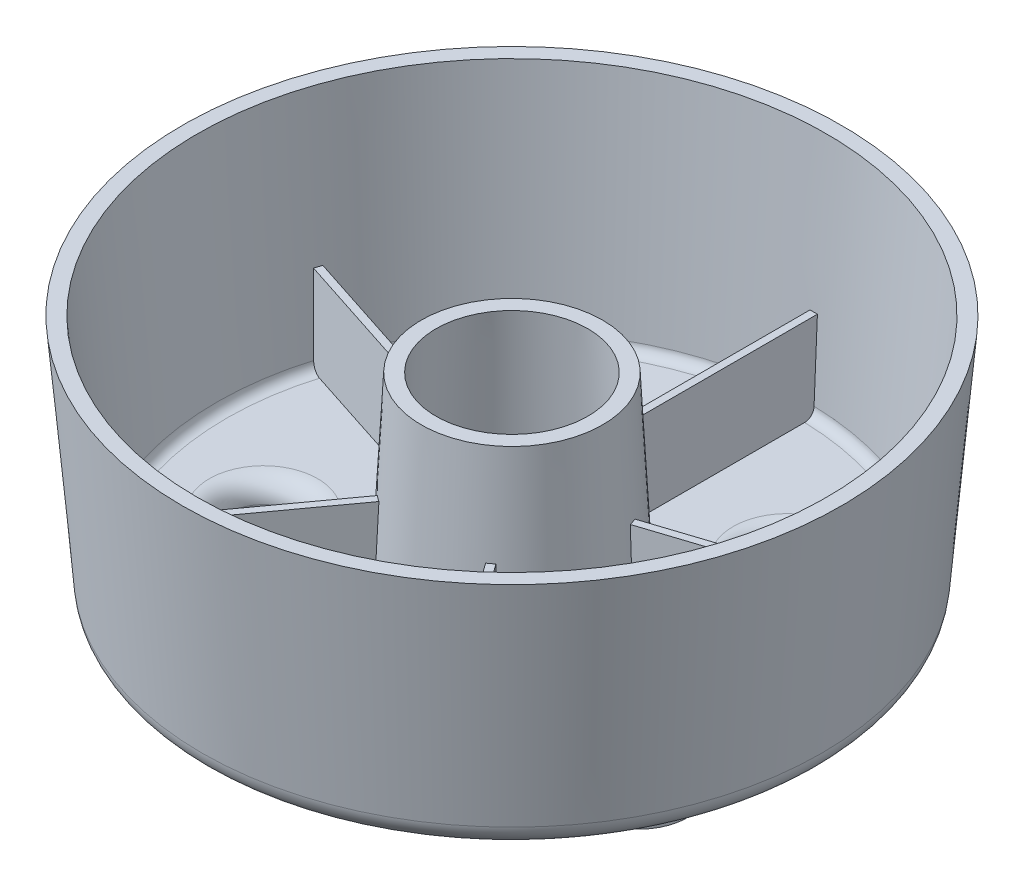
ISO-10303-21;
HEADER;
FILE_DESCRIPTION(('STEP AP214'),'2;1');
FILE_NAME('part.step','',(''),(''),'','','');
FILE_SCHEMA(('AUTOMOTIVE_DESIGN { 1 0 10303 214 1 1 1 1 }'));
ENDSEC;
DATA;
#1=APPLICATION_CONTEXT('core data for automotive mechanical design processes');
#2=APPLICATION_PROTOCOL_DEFINITION('international standard','automotive_design',2000,#1);
#3=PRODUCT_CONTEXT('',#1,'mechanical');
#4=PRODUCT('Part','Part','',(#3));
#5=PRODUCT_RELATED_PRODUCT_CATEGORY('part','',(#4));
#6=PRODUCT_DEFINITION_FORMATION('','',#4);
#7=PRODUCT_DEFINITION_CONTEXT('part definition',#1,'design');
#8=PRODUCT_DEFINITION('design','',#6,#7);
#9=PRODUCT_DEFINITION_SHAPE('','',#8);
#10=(LENGTH_UNIT() NAMED_UNIT(*) SI_UNIT(.MILLI.,.METRE.));
#11=(NAMED_UNIT(*) PLANE_ANGLE_UNIT() SI_UNIT($,.RADIAN.));
#12=(NAMED_UNIT(*) SI_UNIT($,.STERADIAN.) SOLID_ANGLE_UNIT());
#13=UNCERTAINTY_MEASURE_WITH_UNIT(LENGTH_MEASURE(1.E-05),#10,'distance_accuracy_value','');
#14=(GEOMETRIC_REPRESENTATION_CONTEXT(3) GLOBAL_UNCERTAINTY_ASSIGNED_CONTEXT((#13)) GLOBAL_UNIT_ASSIGNED_CONTEXT((#10,
#11,#12)) REPRESENTATION_CONTEXT('',''));
#15=CARTESIAN_POINT('',(0.,0.,0.));
#16=DIRECTION('',(0.,0.,1.));
#17=DIRECTION('',(1.,0.,0.));
#18=AXIS2_PLACEMENT_3D('',#15,#16,#17);
#19=CARTESIAN_POINT('',(0.,0.261467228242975,0.));
#20=DIRECTION('',(0.,1.,0.));
#21=DIRECTION('',(0.,0.,1.));
#22=AXIS2_PLACEMENT_3D('',#19,#20,#21);
#23=CONICAL_SURFACE('',#22,59.5114159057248,0.0872664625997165);
#24=CARTESIAN_POINT('',(-36.5990441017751,20.0002,49.0983012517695));
#25=CARTESIAN_POINT('',(-36.5575184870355,17.4710247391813,48.8532779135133));
#26=CARTESIAN_POINT('',(-36.5158028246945,14.9418778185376,48.607995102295));
#27=CARTESIAN_POINT('',(-36.4319914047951,9.8836406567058,48.1169105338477));
#28=CARTESIAN_POINT('',(-36.3898956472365,7.35455041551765,47.8711087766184));
#29=CARTESIAN_POINT('',(-36.3476098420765,4.82548851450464,47.6250475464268));
#30=B_SPLINE_CURVE_WITH_KNOTS('',3,(#24,#25,#26,#27,#28,#29),.UNSPECIFIED.,.F.,.F.,(4,2,4),(0.,
7.62406663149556,15.2481332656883),.UNSPECIFIED.);
#31=CARTESIAN_POINT('',(-36.5990408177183,20.,49.0982818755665));
#32=VERTEX_POINT('',#31);
#33=CARTESIAN_POINT('',(-36.3476131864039,4.82568851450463,47.6250670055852));
#34=VERTEX_POINT('',#33);
#35=EDGE_CURVE('E948',#32,#34,#30,.T.);
#36=ORIENTED_EDGE('',*,*,#35,.T.);
#37=CARTESIAN_POINT('',(0.,4.82568851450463,0.));
#38=DIRECTION('',(0.,1.,0.));
#39=DIRECTION('',(0.,0.,1.));
#40=AXIS2_PLACEMENT_3D('',#37,#38,#39);
#41=CIRCLE('',#40,59.9107335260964);
#42=CARTESIAN_POINT('',(-57.3991487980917,4.82568851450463,-17.1648975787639));
#43=VERTEX_POINT('',#42);
#44=EDGE_CURVE('E572',#43,#34,#41,.T.);
#45=ORIENTED_EDGE('',*,*,#44,.F.);
#46=CARTESIAN_POINT('',(-58.4685060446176,20.0002,-18.2089817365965));
#47=CARTESIAN_POINT('',(-58.2908900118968,17.4710247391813,-18.0351618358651));
#48=CARTESIAN_POINT('',(-58.1129677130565,14.9418778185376,-17.8612437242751));
#49=CARTESIAN_POINT('',(-57.7565105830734,9.8836406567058,-17.5132110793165));
#50=CARTESIAN_POINT('',(-57.5779757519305,7.35455041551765,-17.3390965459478));
#51=CARTESIAN_POINT('',(-57.3991346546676,4.82548851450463,-17.1648838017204));
#52=B_SPLINE_CURVE_WITH_KNOTS('',3,(#46,#47,#48,#49,#50,#51),.UNSPECIFIED.,.F.,.F.,(4,2,4),(0.,
7.62406663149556,15.2481332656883),.UNSPECIFIED.);
#53=CARTESIAN_POINT('',(-58.4684919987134,20.,-18.2089679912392));
#54=VERTEX_POINT('',#53);
#55=EDGE_CURVE('E795',#54,#43,#52,.T.);
#56=ORIENTED_EDGE('',*,*,#55,.F.);
#57=CARTESIAN_POINT('',(0.,20.,0.));
#58=DIRECTION('',(0.,1.,0.));
#59=DIRECTION('',(0.,0.,1.));
#60=AXIS2_PLACEMENT_3D('',#57,#58,#59);
#61=CIRCLE('',#60,61.2383137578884);
#62=CARTESIAN_POINT('',(-58.004966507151,20.,-19.6355527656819));
#63=VERTEX_POINT('',#62);
#64=EDGE_CURVE('E1531',#63,#54,#61,.T.);
#65=ORIENTED_EDGE('',*,*,#64,.F.);
#66=CARTESIAN_POINT('',(-58.0049859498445,20.0002,-19.6355499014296));
#67=CARTESIAN_POINT('',(-57.7591227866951,17.4710247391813,-19.6717730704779));
#68=CARTESIAN_POINT('',(-57.5129541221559,14.9418778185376,-19.7078956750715));
#69=CARTESIAN_POINT('',(-57.0200057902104,9.8836406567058,-19.7799397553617));
#70=CARTESIAN_POINT('',(-56.773226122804,7.35455041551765,-19.8158612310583));
#71=CARTESIAN_POINT('',(-56.5261409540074,4.82548851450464,-19.8516821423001));
#72=B_SPLINE_CURVE_WITH_KNOTS('',3,(#66,#67,#68,#69,#70,#71),.UNSPECIFIED.,.F.,.F.,(4,2,4),(0.,
7.62406663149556,15.2481332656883),.UNSPECIFIED.);
#73=CARTESIAN_POINT('',(-56.5261604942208,4.82568851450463,-19.8516793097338));
#74=VERTEX_POINT('',#73);
#75=EDGE_CURVE('E814',#63,#74,#72,.T.);
#76=ORIENTED_EDGE('',*,*,#75,.T.);
#77=CARTESIAN_POINT('',(-1.41252474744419,4.82568851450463,-59.8940795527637));
#78=VERTEX_POINT('',#77);
#79=EDGE_CURVE('E570',#78,#74,#41,.T.);
#80=ORIENTED_EDGE('',*,*,#79,.F.);
#81=CARTESIAN_POINT('',(-0.749991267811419,20.0002,-61.2337384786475));
#82=CARTESIAN_POINT('',(-0.860417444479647,17.4710247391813,-61.0111022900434));
#83=CARTESIAN_POINT('',(-0.970842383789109,14.9418778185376,-60.7881444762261));
#84=CARTESIAN_POINT('',(-1.19168978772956,9.8836406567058,-60.3415855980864));
#85=CARTESIAN_POINT('',(-1.30211225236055,7.35455041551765,-60.1179845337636));
#86=CARTESIAN_POINT('',(-1.41253347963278,4.82548851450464,-59.8940618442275));
#87=B_SPLINE_CURVE_WITH_KNOTS('',3,(#81,#82,#83,#84,#85,#86),.UNSPECIFIED.,.F.,.F.,(4,2,4),(0.,
7.62406663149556,15.2481332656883),.UNSPECIFIED.);
#88=CARTESIAN_POINT('',(-0.75,20.,-61.2337208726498));
#89=VERTEX_POINT('',#88);
#90=EDGE_CURVE('E583',#89,#78,#87,.T.);
#91=ORIENTED_EDGE('',*,*,#90,.F.);
#92=CARTESIAN_POINT('',(0.,20.,0.));
#93=DIRECTION('',(0.,1.,0.));
#94=DIRECTION('',(0.,0.,1.));
#95=AXIS2_PLACEMENT_3D('',#92,#93,#94);
#96=CIRCLE('',#95,61.2383137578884);
#97=CARTESIAN_POINT('',(0.75,20.,-61.2337208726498));
#98=VERTEX_POINT('',#97);
#99=EDGE_CURVE('E515',#98,#89,#96,.T.);
#100=ORIENTED_EDGE('',*,*,#99,.F.);
#101=CARTESIAN_POINT('',(0.749991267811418,20.0002,-61.2337384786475));
#102=CARTESIAN_POINT('',(0.860417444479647,17.4710247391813,-61.0111022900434));
#103=CARTESIAN_POINT('',(0.970842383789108,14.9418778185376,-60.7881444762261));
#104=CARTESIAN_POINT('',(1.19168978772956,9.8836406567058,-60.3415855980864));
#105=CARTESIAN_POINT('',(1.30211225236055,7.35455041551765,-60.1179845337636));
#106=CARTESIAN_POINT('',(1.41253347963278,4.82548851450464,-59.8940618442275));
#107=B_SPLINE_CURVE_WITH_KNOTS('',3,(#101,#102,#103,#104,#105,#106),.UNSPECIFIED.,.F.,.F.,(4,2,
4),(0.,7.62406663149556,15.2481332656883),.UNSPECIFIED.);
#108=CARTESIAN_POINT('',(1.41252474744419,4.82568851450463,-59.8940795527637));
#109=VERTEX_POINT('',#108);
#110=EDGE_CURVE('E575',#98,#109,#107,.T.);
#111=ORIENTED_EDGE('',*,*,#110,.T.);
#112=CARTESIAN_POINT('',(56.5261604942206,4.82568851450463,-19.8516793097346));
#113=VERTEX_POINT('',#112);
#114=EDGE_CURVE('E533',#113,#109,#41,.T.);
#115=ORIENTED_EDGE('',*,*,#114,.F.);
#116=CARTESIAN_POINT('',(58.0049859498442,20.0002,-19.6355499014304));
#117=CARTESIAN_POINT('',(57.7591227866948,17.4710247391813,-19.6717730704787));
#118=CARTESIAN_POINT('',(57.5129541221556,14.9418778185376,-19.7078956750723));
#119=CARTESIAN_POINT('',(57.0200057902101,9.8836406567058,-19.7799397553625));
#120=CARTESIAN_POINT('',(56.7732261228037,7.35455041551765,-19.8158612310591));
#121=CARTESIAN_POINT('',(56.5261409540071,4.82548851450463,-19.8516821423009));
#122=B_SPLINE_CURVE_WITH_KNOTS('',3,(#116,#117,#118,#119,#120,#121),.UNSPECIFIED.,.F.,.F.,(4,2,
4),(0.,7.62406663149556,15.2481332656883),.UNSPECIFIED.);
#123=CARTESIAN_POINT('',(58.0049665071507,20.,-19.6355527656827));
#124=VERTEX_POINT('',#123);
#125=EDGE_CURVE('E258',#124,#113,#122,.T.);
#126=ORIENTED_EDGE('',*,*,#125,.F.);
#127=CARTESIAN_POINT('',(0.,20.,0.));
#128=DIRECTION('',(0.,1.,0.));
#129=DIRECTION('',(0.,0.,1.));
#130=AXIS2_PLACEMENT_3D('',#127,#128,#129);
#131=CIRCLE('',#130,61.2383137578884);
#132=CARTESIAN_POINT('',(58.4684919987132,20.,-18.20896799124));
#133=VERTEX_POINT('',#132);
#134=EDGE_CURVE('E1044',#133,#124,#131,.T.);
#135=ORIENTED_EDGE('',*,*,#134,.F.);
#136=CARTESIAN_POINT('',(58.4685060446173,20.0002,-18.2089817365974));
#137=CARTESIAN_POINT('',(58.2908900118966,17.4710247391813,-18.0351618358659));
#138=CARTESIAN_POINT('',(58.1129677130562,14.9418778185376,-17.861243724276));
#139=CARTESIAN_POINT('',(57.7565105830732,9.8836406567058,-17.5132110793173));
#140=CARTESIAN_POINT('',(57.5779757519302,7.35455041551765,-17.3390965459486));
#141=CARTESIAN_POINT('',(57.3991346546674,4.82548851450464,-17.1648838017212));
#142=B_SPLINE_CURVE_WITH_KNOTS('',3,(#136,#137,#138,#139,#140,#141),.UNSPECIFIED.,.F.,.F.,(4,2,
4),(0.,7.62406663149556,15.2481332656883),.UNSPECIFIED.);
#143=CARTESIAN_POINT('',(57.3991487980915,4.82568851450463,-17.1648975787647));
#144=VERTEX_POINT('',#143);
#145=EDGE_CURVE('E1037',#133,#144,#142,.T.);
#146=ORIENTED_EDGE('',*,*,#145,.T.);
#147=CARTESIAN_POINT('',(36.3476131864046,4.82568851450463,47.6250670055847));
#148=VERTEX_POINT('',#147);
#149=EDGE_CURVE('E995',#148,#144,#41,.T.);
#150=ORIENTED_EDGE('',*,*,#149,.F.);
#151=CARTESIAN_POINT('',(36.5990441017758,20.0002,49.0983012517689));
#152=CARTESIAN_POINT('',(36.5575184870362,17.4710247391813,48.8532779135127));
#153=CARTESIAN_POINT('',(36.5158028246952,14.9418778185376,48.6079951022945));
#154=CARTESIAN_POINT('',(36.4319914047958,9.8836406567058,48.1169105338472));
#155=CARTESIAN_POINT('',(36.3898956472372,7.35455041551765,47.8711087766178));
#156=CARTESIAN_POINT('',(36.3476098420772,4.82548851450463,47.6250475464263));
#157=B_SPLINE_CURVE_WITH_KNOTS('',3,(#151,#152,#153,#154,#155,#156),.UNSPECIFIED.,.F.,.F.,(4,2,
4),(0.,7.62406663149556,15.2481332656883),.UNSPECIFIED.);
#158=CARTESIAN_POINT('',(36.599040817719,20.,49.098281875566));
#159=VERTEX_POINT('',#158);
#160=EDGE_CURVE('E882',#159,#148,#157,.T.);
#161=ORIENTED_EDGE('',*,*,#160,.F.);
#162=CARTESIAN_POINT('',(0.,20.,0.));
#163=DIRECTION('',(0.,1.,0.));
#164=DIRECTION('',(0.,0.,1.));
#165=AXIS2_PLACEMENT_3D('',#162,#163,#164);
#166=CIRCLE('',#165,61.2383137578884);
#167=CARTESIAN_POINT('',(35.3855153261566,20.,49.9799597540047));
#168=VERTEX_POINT('',#167);
#169=EDGE_CURVE('E985',#168,#159,#166,.T.);
#170=ORIENTED_EDGE('',*,*,#169,.F.);
#171=CARTESIAN_POINT('',(35.3855327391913,20.0002,49.9799688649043));
#172=CARTESIAN_POINT('',(35.1653338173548,17.4710247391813,49.8647592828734));
#173=CARTESIAN_POINT('',(34.9449468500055,14.9418778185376,49.7492887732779));
#174=CARTESIAN_POINT('',(34.5037968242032,9.8836406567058,49.5178258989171));
#175=CARTESIAN_POINT('',(34.2830337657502,7.35455041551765,49.4018335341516));
#176=CARTESIAN_POINT('',(34.0620826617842,4.82548851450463,49.2855802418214));
#177=B_SPLINE_CURVE_WITH_KNOTS('',3,(#171,#172,#173,#174,#175,#176),.UNSPECIFIED.,.F.,.F.,(4,2,
4),(0.,7.62406663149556,15.2481332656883),.UNSPECIFIED.);
#178=CARTESIAN_POINT('',(34.0621001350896,4.82568851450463,49.2855894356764));
#179=VERTEX_POINT('',#178);
#180=EDGE_CURVE('E908',#168,#179,#177,.T.);
#181=ORIENTED_EDGE('',*,*,#180,.T.);
#182=CARTESIAN_POINT('',(-34.0621001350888,4.82568851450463,49.2855894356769));
#183=VERTEX_POINT('',#182);
#184=EDGE_CURVE('E991',#183,#179,#41,.T.);
#185=ORIENTED_EDGE('',*,*,#184,.F.);
#186=CARTESIAN_POINT('',(-35.3855327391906,20.0002,49.9799688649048));
#187=CARTESIAN_POINT('',(-35.1653338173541,17.4710247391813,49.8647592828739));
#188=CARTESIAN_POINT('',(-34.9449468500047,14.9418778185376,49.7492887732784));
#189=CARTESIAN_POINT('',(-34.5037968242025,9.8836406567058,49.5178258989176));
#190=CARTESIAN_POINT('',(-34.2830337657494,7.35455041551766,49.4018335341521));
#191=CARTESIAN_POINT('',(-34.0620826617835,4.82548851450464,49.2855802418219));
#192=B_SPLINE_CURVE_WITH_KNOTS('',3,(#186,#187,#188,#189,#190,#191),.UNSPECIFIED.,.F.,.F.,(4,2,
4),(0.,7.62406663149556,15.2481332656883),.UNSPECIFIED.);
#193=CARTESIAN_POINT('',(-35.3855153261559,20.,49.9799597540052));
#194=VERTEX_POINT('',#193);
#195=EDGE_CURVE('E956',#194,#183,#192,.T.);
#196=ORIENTED_EDGE('',*,*,#195,.F.);
#197=CARTESIAN_POINT('',(0.,20.,0.));
#198=DIRECTION('',(0.,1.,0.));
#199=DIRECTION('',(0.,0.,1.));
#200=AXIS2_PLACEMENT_3D('',#197,#198,#199);
#201=CIRCLE('',#200,61.2383137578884);
#202=EDGE_CURVE('E955',#32,#194,#201,.T.);
#203=ORIENTED_EDGE('',*,*,#202,.F.);
#204=EDGE_LOOP('',(#36,#45,#56,#65,#76,#80,#91,#100,#111,#115,#126,#135,#146,#150,#161,#170,
#181,#185,#196,#203));
#205=FACE_BOUND('',#204,.T.);
#206=CARTESIAN_POINT('',(0.,50.,0.));
#207=DIRECTION('',(0.,1.,0.));
#208=DIRECTION('',(0.,0.,1.));
#209=AXIS2_PLACEMENT_3D('',#206,#207,#208);
#210=CIRCLE('',#209,63.8629736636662);
#211=CARTESIAN_POINT('',(0.,50.,63.8629736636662));
#212=VERTEX_POINT('',#211);
#213=EDGE_CURVE('E530',#212,#212,#210,.T.);
#214=ORIENTED_EDGE('',*,*,#213,.T.);
#215=EDGE_LOOP('',(#214));
#216=FACE_BOUND('',#215,.T.);
#217=ADVANCED_FACE('F32',(#205,#216),#23,.F.);
#218=CARTESIAN_POINT('',(0.,3.,0.));
#219=DIRECTION('',(0.,1.,0.));
#220=DIRECTION('',(0.,0.,1.));
#221=AXIS2_PLACEMENT_3D('',#218,#219,#220);
#222=PLANE('',#221);
#223=CARTESIAN_POINT('',(23.5114100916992,3.,-32.3606797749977));
#224=DIRECTION('',(0.,1.,0.));
#225=DIRECTION('',(0.,0.,1.));
#226=AXIS2_PLACEMENT_3D('',#223,#224,#225);
#227=CIRCLE('',#226,11.);
#228=CARTESIAN_POINT('',(23.5114100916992,3.,-21.3606797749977));
#229=VERTEX_POINT('',#228);
#230=EDGE_CURVE('E537',#229,#229,#227,.T.);
#231=ORIENTED_EDGE('',*,*,#230,.F.);
#232=EDGE_LOOP('',(#231));
#233=FACE_BOUND('',#232,.T.);
#234=CARTESIAN_POINT('',(0.,3.,0.));
#235=DIRECTION('',(0.,1.,0.));
#236=DIRECTION('',(0.,0.,1.));
#237=AXIS2_PLACEMENT_3D('',#234,#235,#236);
#238=CIRCLE('',#237,22.2448228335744);
#239=CARTESIAN_POINT('',(20.6473020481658,3.,-8.27774492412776));
#240=VERTEX_POINT('',#239);
#241=CARTESIAN_POINT('',(1.49223602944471,3.,-22.1947150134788));
#242=VERTEX_POINT('',#241);
#243=EDGE_CURVE('E253',#240,#242,#238,.T.);
#244=ORIENTED_EDGE('',*,*,#243,.F.);
#245=DIRECTION('',(0.95105651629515,0.,-0.309016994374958));
#246=VECTOR('',#245,1.);
#247=CARTESIAN_POINT('',(-0.461126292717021,3.,-1.41920079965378));
#248=LINE('',#247,#246);
#249=CARTESIAN_POINT('',(54.6042067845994,3.,-19.3110120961));
#250=VERTEX_POINT('',#249);
#251=EDGE_CURVE('E251',#240,#250,#248,.T.);
#252=ORIENTED_EDGE('',*,*,#251,.T.);
#253=CARTESIAN_POINT('',(0.,3.,0.));
#254=DIRECTION('',(0.,1.,0.));
#255=DIRECTION('',(0.,0.,1.));
#256=AXIS2_PLACEMENT_3D('',#253,#254,#255);
#257=CIRCLE('',#256,57.9183441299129);
#258=CARTESIAN_POINT('',(1.49223602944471,3.,-57.8991175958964));
#259=VERTEX_POINT('',#258);
#260=EDGE_CURVE('E235',#259,#250,#257,.F.);
#261=ORIENTED_EDGE('',*,*,#260,.F.);
#262=DIRECTION('',(0.,0.,1.));
#263=VECTOR('',#262,1.);
#264=CARTESIAN_POINT('',(1.49223602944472,3.,0.));
#265=LINE('',#264,#263);
#266=EDGE_CURVE('E847',#242,#259,#265,.F.);
#267=ORIENTED_EDGE('',*,*,#266,.F.);
#268=EDGE_LOOP('',(#244,#252,#261,#267));
#269=FACE_BOUND('',#268,.T.);
#270=ADVANCED_FACE('F252',(#233,#269),#222,.T.);
#271=CARTESIAN_POINT('',(0.,5.,0.));
#272=DIRECTION('',(0.,1.,0.));
#273=DIRECTION('',(0.,0.,1.));
#274=AXIS2_PLACEMENT_3D('',#271,#272,#273);
#275=TOROIDAL_SURFACE('',#274,22.2448228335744,2.);
#276=CARTESIAN_POINT('',(22.2450228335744,3.886686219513,-8.7561700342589));
#277=CARTESIAN_POINT('',(22.2143442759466,3.83981212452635,-8.74835385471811));
#278=CARTESIAN_POINT('',(22.1818129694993,3.79429427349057,-8.73987341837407));
#279=CARTESIAN_POINT('',(22.113255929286,3.70624697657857,-8.7216399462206));
#280=CARTESIAN_POINT('',(22.0772303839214,3.66371736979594,-8.71188697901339));
#281=CARTESIAN_POINT('',(21.9643445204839,3.54114856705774,-8.68083500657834));
#282=CARTESIAN_POINT('',(21.8825752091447,3.46597729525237,-8.65771749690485));
#283=CARTESIAN_POINT('',(21.7083852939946,3.3309432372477,-8.6073188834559));
#284=CARTESIAN_POINT('',(21.6159600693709,3.27108712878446,-8.58003597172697));
#285=CARTESIAN_POINT('',(21.4230828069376,3.16837374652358,-8.52208169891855));
#286=CARTESIAN_POINT('',(21.3226322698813,3.1255133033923,-8.49141097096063));
#287=CARTESIAN_POINT('',(21.1165046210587,3.05799886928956,-8.42753547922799));
#288=CARTESIAN_POINT('',(21.0108253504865,3.0333524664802,-8.39432966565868));
#289=CARTESIAN_POINT('',(20.7972598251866,3.00300463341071,-8.32633122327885));
#290=CARTESIAN_POINT('',(20.689373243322,2.99730603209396,-8.2915383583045));
#291=CARTESIAN_POINT('',(20.4746036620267,3.00504350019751,-8.22140028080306));
#292=CARTESIAN_POINT('',(20.3677196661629,3.0184579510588,-8.18605573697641));
#293=CARTESIAN_POINT('',(20.1578887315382,3.06402641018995,-8.11578558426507));
#294=CARTESIAN_POINT('',(20.0549414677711,3.09617886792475,-8.08085994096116));
#295=CARTESIAN_POINT('',(19.8561786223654,3.1782278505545,-8.0125112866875));
#296=CARTESIAN_POINT('',(19.7603456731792,3.22807932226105,-7.97908470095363));
#297=CARTESIAN_POINT('',(19.5782690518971,3.34414558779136,-7.91459606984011));
#298=CARTESIAN_POINT('',(19.4920254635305,3.41036052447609,-7.88353404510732));
#299=CARTESIAN_POINT('',(19.3318571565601,3.55705049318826,-7.82475798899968));
#300=CARTESIAN_POINT('',(19.2578954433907,3.6374811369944,-7.79703397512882));
#301=CARTESIAN_POINT('',(19.1240822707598,3.81046918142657,-7.74561393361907));
#302=CARTESIAN_POINT('',(19.0642317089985,3.90302735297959,-7.72191816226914));
#303=CARTESIAN_POINT('',(18.960449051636,4.09744263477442,-7.67927194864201));
#304=CARTESIAN_POINT('',(18.9164895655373,4.19928336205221,-7.66031335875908));
#305=CARTESIAN_POINT('',(18.8456053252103,4.40949199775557,-7.62763145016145));
#306=CARTESIAN_POINT('',(18.8186691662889,4.51785548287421,-7.61390462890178));
#307=CARTESIAN_POINT('',(18.7899909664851,4.69252361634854,-7.59656788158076));
#308=CARTESIAN_POINT('',(18.7824405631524,4.75775239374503,-7.59112009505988));
#309=CARTESIAN_POINT('',(18.7735146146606,4.88865279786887,-7.58221052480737));
#310=CARTESIAN_POINT('',(18.7721285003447,4.95432347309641,-7.57874535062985));
#311=CARTESIAN_POINT('',(18.773832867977,5.01998197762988,-7.57628489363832));
#312=B_SPLINE_CURVE_WITH_KNOTS('',3,(#276,#277,#278,#279,#280,#281,#282,#283,#284,#285,#286,
#287,#288,#289,#290,#291,#292,#293,#294,#295,#296,#297,#298,#299,#300,#301,#302,#303,#304,#305,
#306,#307,#308,#309,#310,#311),.UNSPECIFIED.,.F.,.F.,(4,2,2,2,2,2,2,2,2,2,2,2,2,2,2,2,2,4),(0.,
0.169586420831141,0.339163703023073,0.67777429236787,1.01653227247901,1.35522705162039,
1.69406285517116,2.03294924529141,2.37145262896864,2.70992800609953,3.04754789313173,
3.38517072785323,3.72175739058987,4.05836545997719,4.39439054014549,4.73019026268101,
4.9275690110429,5.12460920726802),.UNSPECIFIED.);
#313=CARTESIAN_POINT('',(18.7743084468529,4.89532808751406,-7.58216200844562));
#314=VERTEX_POINT('',#313);
#315=EDGE_CURVE('E254',#240,#314,#312,.T.);
#316=ORIENTED_EDGE('',*,*,#315,.F.);
#317=ORIENTED_EDGE('',*,*,#243,.T.);
#318=CARTESIAN_POINT('',(1.4922085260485,3.00062993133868,-22.2450228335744));
#319=CARTESIAN_POINT('',(1.4922701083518,2.99921946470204,-22.1886908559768));
#320=CARTESIAN_POINT('',(1.49222817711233,3.00017984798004,-22.1323261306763));
#321=CARTESIAN_POINT('',(1.49193781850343,3.00683015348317,-22.0198789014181));
#322=CARTESIAN_POINT('',(1.49168939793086,3.01251992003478,-21.9637963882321));
#323=CARTESIAN_POINT('',(1.49063624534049,3.03664108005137,-21.7966549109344));
#324=CARTESIAN_POINT('',(1.48952380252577,3.06212020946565,-21.6865314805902));
#325=CARTESIAN_POINT('',(1.48650755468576,3.13120364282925,-21.4721270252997));
#326=CARTESIAN_POINT('',(1.48460330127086,3.17481821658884,-21.3678493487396));
#327=CARTESIAN_POINT('',(1.48005690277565,3.278947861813,-21.1681403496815));
#328=CARTESIAN_POINT('',(1.47741496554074,3.33945817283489,-21.0727065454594));
#329=CARTESIAN_POINT('',(1.47147433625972,3.47552095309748,-20.8936170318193));
#330=CARTESIAN_POINT('',(1.46817716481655,3.55103859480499,-20.8099348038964));
#331=CARTESIAN_POINT('',(1.46101409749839,3.71509980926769,-20.6564487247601));
#332=CARTESIAN_POINT('',(1.45714795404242,3.80364905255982,-20.5866509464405));
#333=CARTESIAN_POINT('',(1.44875236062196,3.99593975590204,-20.4598686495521));
#334=CARTESIAN_POINT('',(1.44419935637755,4.10022069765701,-20.4037031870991));
#335=CARTESIAN_POINT('',(1.43473359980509,4.31702216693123,-20.3107464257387));
#336=CARTESIAN_POINT('',(1.42982117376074,4.42953522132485,-20.2739377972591));
#337=CARTESIAN_POINT('',(1.42229016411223,4.60202370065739,-20.2339923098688));
#338=CARTESIAN_POINT('',(1.41974449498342,4.66032910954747,-20.2232121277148));
#339=CARTESIAN_POINT('',(1.41462666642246,4.77754665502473,-20.2068977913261));
#340=CARTESIAN_POINT('',(1.41205457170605,4.83645730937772,-20.2013529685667));
#341=CARTESIAN_POINT('',(1.40947548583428,4.89552808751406,-20.1984354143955));
#342=B_SPLINE_CURVE_WITH_KNOTS('',3,(#318,#319,#320,#321,#322,#323,#324,#325,#326,#327,#328,
#329,#330,#331,#332,#333,#334,#335,#336,#337,#338,#339,#340,#341),.UNSPECIFIED.,.F.,.F.,(4,2,2,
2,2,2,2,2,2,2,2,4),(0.,0.168945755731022,0.337885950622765,0.675261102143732,1.01282756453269,
1.35029901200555,1.68699624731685,2.02384042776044,2.37759312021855,2.73102856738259,
2.90886931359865,3.08634687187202),.UNSPECIFIED.);
#343=CARTESIAN_POINT('',(1.40948421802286,4.89532808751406,-20.1984453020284));
#344=VERTEX_POINT('',#343);
#345=EDGE_CURVE('E339',#242,#344,#342,.T.);
#346=ORIENTED_EDGE('',*,*,#345,.T.);
#347=CARTESIAN_POINT('',(0.,4.89532808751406,0.));
#348=DIRECTION('',(0.,-1.,0.));
#349=DIRECTION('',(0.,0.,-1.));
#350=AXIS2_PLACEMENT_3D('',#347,#348,#349);
#351=CIRCLE('',#350,20.2475637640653);
#352=EDGE_CURVE('E553',#344,#314,#351,.T.);
#353=ORIENTED_EDGE('',*,*,#352,.T.);
#354=EDGE_LOOP('',(#316,#317,#346,#353));
#355=FACE_BOUND('',#354,.T.);
#356=ADVANCED_FACE('F315',(#355),#275,.F.);
#357=CARTESIAN_POINT('',(0.,5.,0.));
#358=DIRECTION('',(0.,1.,0.));
#359=DIRECTION('',(0.,0.,1.));
#360=AXIS2_PLACEMENT_3D('',#357,#358,#359);
#361=TOROIDAL_SURFACE('',#360,57.9183441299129,2.);
#362=ORIENTED_EDGE('',*,*,#149,.T.);
#363=CARTESIAN_POINT('',(57.4040838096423,4.93888479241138,-17.1716976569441));
#364=CARTESIAN_POINT('',(57.4031505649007,4.88257723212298,-17.16880946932));
#365=CARTESIAN_POINT('',(57.399952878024,4.82637182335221,-17.1651902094));
#366=CARTESIAN_POINT('',(57.3890586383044,4.71451351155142,-17.1565152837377));
#367=CARTESIAN_POINT('',(57.3813623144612,4.65886058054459,-17.1514596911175));
#368=CARTESIAN_POINT('',(57.3516007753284,4.49341567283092,-17.1341943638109));
#369=CARTESIAN_POINT('',(57.3228598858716,4.38496049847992,-17.1198769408));
#370=CARTESIAN_POINT('',(57.2483840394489,4.17491818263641,-17.0860356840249));
#371=CARTESIAN_POINT('',(57.2026408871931,4.07333438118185,-17.0665093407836));
#372=CARTESIAN_POINT('',(57.095471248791,3.87993060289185,-17.0228090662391));
#373=CARTESIAN_POINT('',(57.0340495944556,3.78810763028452,-16.998636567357));
#374=CARTESIAN_POINT('',(56.8972557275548,3.61680961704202,-16.9463256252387));
#375=CARTESIAN_POINT('',(56.8218825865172,3.53733539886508,-16.9181869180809));
#376=CARTESIAN_POINT('',(56.6592615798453,3.39294735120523,-16.8587196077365));
#377=CARTESIAN_POINT('',(56.5720058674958,3.3280432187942,-16.8273889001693));
#378=CARTESIAN_POINT('',(56.3881203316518,3.21469561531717,-16.762437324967));
#379=CARTESIAN_POINT('',(56.2914862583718,3.16625965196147,-16.7288154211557));
#380=CARTESIAN_POINT('',(56.0917561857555,3.08735531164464,-16.660296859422));
#381=CARTESIAN_POINT('',(55.9886757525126,3.05684537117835,-16.6254033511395));
#382=CARTESIAN_POINT('',(55.8558114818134,3.03002618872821,-16.5810019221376));
#383=CARTESIAN_POINT('',(55.8275835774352,3.02502676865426,-16.5716006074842));
#384=CARTESIAN_POINT('',(55.7709232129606,3.01637436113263,-16.5527933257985));
#385=CARTESIAN_POINT('',(55.7424907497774,3.01272139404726,-16.5433873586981));
#386=CARTESIAN_POINT('',(55.6079759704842,2.99869738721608,-16.4990370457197));
#387=CARTESIAN_POINT('',(55.5008100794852,2.99703988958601,-16.4641406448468));
#388=CARTESIAN_POINT('',(55.287318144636,3.0126460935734,-16.3954893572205));
#389=CARTESIAN_POINT('',(55.1809945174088,3.02995215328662,-16.3617372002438));
#390=CARTESIAN_POINT('',(54.972444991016,3.08303019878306,-16.2964120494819));
#391=CARTESIAN_POINT('',(54.870215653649,3.11878632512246,-16.2648372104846));
#392=CARTESIAN_POINT('',(54.6727380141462,3.2077279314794,-16.2047559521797));
#393=CARTESIAN_POINT('',(54.5774865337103,3.26090541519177,-16.1762481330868));
#394=CARTESIAN_POINT('',(54.3966378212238,3.38316568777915,-16.1230995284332));
#395=CARTESIAN_POINT('',(54.3110378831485,3.45224400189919,-16.0984576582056));
#396=CARTESIAN_POINT('',(54.15189056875,3.60435277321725,-16.0537305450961));
#397=CARTESIAN_POINT('',(54.0783432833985,3.68738333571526,-16.0336453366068));
#398=CARTESIAN_POINT('',(53.945379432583,3.86503863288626,-15.9985985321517));
#399=CARTESIAN_POINT('',(53.8859641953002,3.95966445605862,-15.9836374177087));
#400=CARTESIAN_POINT('',(53.7829448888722,4.15782872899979,-15.9592617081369));
#401=CARTESIAN_POINT('',(53.7393399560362,4.26136669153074,-15.9498468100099));
#402=CARTESIAN_POINT('',(53.6739357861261,4.45994448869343,-15.9377119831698));
#403=CARTESIAN_POINT('',(53.6499844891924,4.55423877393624,-15.9342585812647));
#404=CARTESIAN_POINT('',(53.6152651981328,4.74523705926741,-15.9317459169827));
#405=CARTESIAN_POINT('',(53.6044914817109,4.84193999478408,-15.9326847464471));
#406=CARTESIAN_POINT('',(53.6005095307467,4.93888479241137,-15.935841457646));
#407=B_SPLINE_CURVE_WITH_KNOTS('',3,(#363,#364,#365,#366,#367,#368,#369,#370,#371,#372,#373,
#374,#375,#376,#377,#378,#379,#380,#381,#382,#383,#384,#385,#386,#387,#388,#389,#390,#391,#392,
#393,#394,#395,#396,#397,#398,#399,#400,#401,#402,#403,#404,#405,#406),.UNSPECIFIED.,.F.,.F.,(4,
2,2,2,2,2,2,2,2,2,2,2,2,2,2,2,2,2,2,2,2,4),(0.,0.169063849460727,0.338119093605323,
0.675704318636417,1.01345247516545,1.35109666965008,1.68876334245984,2.02665408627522,
2.36469866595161,2.70195632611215,2.79244540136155,2.88293584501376,3.21928894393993,
3.55639487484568,3.89321151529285,4.22987377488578,4.56644140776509,4.90301158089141,
5.23961337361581,5.57619677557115,5.86724094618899,6.15815868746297),.UNSPECIFIED.);
#408=CARTESIAN_POINT('',(55.5264593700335,3.,-16.4726104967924));
#409=VERTEX_POINT('',#408);
#410=EDGE_CURVE('E45',#144,#409,#407,.T.);
#411=ORIENTED_EDGE('',*,*,#410,.T.);
#412=CARTESIAN_POINT('',(35.2394917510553,3.,45.9642557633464));
#413=VERTEX_POINT('',#412);
#414=EDGE_CURVE('E246',#409,#413,#257,.F.);
#415=ORIENTED_EDGE('',*,*,#414,.T.);
#416=CARTESIAN_POINT('',(33.9968690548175,4.93891273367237,44.3979556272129));
#417=CARTESIAN_POINT('',(33.9998288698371,4.88269333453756,44.3978534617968));
#418=CARTESIAN_POINT('',(34.0041796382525,4.82657054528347,44.3996729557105));
#419=CARTESIAN_POINT('',(34.0156314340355,4.7148649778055,44.4071374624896));
#420=CARTESIAN_POINT('',(34.0227323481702,4.659282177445,44.4127823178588));
#421=CARTESIAN_POINT('',(34.0480871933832,4.49402763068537,44.4354050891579));
#422=CARTESIAN_POINT('',(34.0704025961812,4.38567360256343,44.4580710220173));
#423=CARTESIAN_POINT('',(34.1252364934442,4.17578281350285,44.5179526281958));
#424=CARTESIAN_POINT('',(34.1577600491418,4.07424946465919,44.555175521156));
#425=CARTESIAN_POINT('',(34.2320873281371,3.88089849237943,44.643116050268));
#426=CARTESIAN_POINT('',(34.2738890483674,3.7890787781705,44.6938307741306));
#427=CARTESIAN_POINT('',(34.3655485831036,3.61784461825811,44.8072699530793));
#428=CARTESIAN_POINT('',(34.4153991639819,3.53841915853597,44.869983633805));
#429=CARTESIAN_POINT('',(34.5217771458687,3.39412015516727,45.0056817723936));
#430=CARTESIAN_POINT('',(34.5783055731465,3.32924885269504,45.0786678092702));
#431=CARTESIAN_POINT('',(34.696434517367,3.21591362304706,45.2328397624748));
#432=CARTESIAN_POINT('',(34.7580358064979,3.16745219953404,45.3140269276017));
#433=CARTESIAN_POINT('',(34.8845456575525,3.0883293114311,45.4822755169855));
#434=CARTESIAN_POINT('',(34.9494540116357,3.05766672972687,45.5693365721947));
#435=CARTESIAN_POINT('',(35.0807428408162,3.01500026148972,45.7468708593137));
#436=CARTESIAN_POINT('',(35.147123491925,3.002998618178,45.8373445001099));
#437=CARTESIAN_POINT('',(35.2794639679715,2.99799281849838,46.0191237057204));
#438=CARTESIAN_POINT('',(35.3454237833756,3.00498909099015,46.1104292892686));
#439=CARTESIAN_POINT('',(35.475045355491,3.03776915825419,46.2912729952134));
#440=CARTESIAN_POINT('',(35.53870724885,3.06355183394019,46.3808112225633));
#441=CARTESIAN_POINT('',(35.6619347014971,3.13316110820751,46.555589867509));
#442=CARTESIAN_POINT('',(35.7215002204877,3.17698788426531,46.6408302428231));
#443=CARTESIAN_POINT('',(35.834901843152,3.28148135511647,46.8046760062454));
#444=CARTESIAN_POINT('',(35.8887327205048,3.3421632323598,46.883275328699));
#445=CARTESIAN_POINT('',(35.9890761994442,3.47861649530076,47.0315220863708));
#446=CARTESIAN_POINT('',(36.0355894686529,3.55438650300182,47.1011703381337));
#447=CARTESIAN_POINT('',(36.1200260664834,3.71893856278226,47.2296103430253));
#448=CARTESIAN_POINT('',(36.1579420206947,3.80773167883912,47.2883927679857));
#449=CARTESIAN_POINT('',(36.2240765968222,3.99581877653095,47.3933903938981));
#450=CARTESIAN_POINT('',(36.2522901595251,4.09511820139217,47.4395990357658));
#451=CARTESIAN_POINT('',(36.2982255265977,4.3014819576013,47.5181524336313));
#452=CARTESIAN_POINT('',(36.3159326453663,4.4085569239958,47.5504777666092));
#453=CARTESIAN_POINT('',(36.3402537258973,4.62715118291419,47.6001901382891));
#454=CARTESIAN_POINT('',(36.3468927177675,4.73865986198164,47.6176108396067));
#455=CARTESIAN_POINT('',(36.3482129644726,4.88010479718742,47.6299345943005));
#456=CARTESIAN_POINT('',(36.3481032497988,4.90950482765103,47.631967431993));
#457=CARTESIAN_POINT('',(36.3476082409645,4.93891273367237,47.6334705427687));
#458=B_SPLINE_CURVE_WITH_KNOTS('',3,(#416,#417,#418,#419,#420,#421,#422,#423,#424,#425,#426,
#427,#428,#429,#430,#431,#432,#433,#434,#435,#436,#437,#438,#439,#440,#441,#442,#443,#444,#445,
#446,#447,#448,#449,#450,#451,#452,#453,#454,#455,#456,#457),.UNSPECIFIED.,.F.,.F.,(4,2,2,2,2,2,
2,2,2,2,2,2,2,2,2,2,2,2,2,2,4),(0.,0.168788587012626,0.337570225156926,0.674611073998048,
1.01181929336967,1.34895478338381,1.68578895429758,2.0226749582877,2.35961233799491,
2.69652856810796,3.03348529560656,3.3704496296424,3.70739389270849,4.04434146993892,
4.38159354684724,4.71881483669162,5.05632429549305,5.39400947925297,5.7321655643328,
6.0695558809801,6.15793531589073),.UNSPECIFIED.);
#459=EDGE_CURVE('E266',#413,#148,#458,.T.);
#460=ORIENTED_EDGE('',*,*,#459,.T.);
#461=EDGE_LOOP('',(#362,#411,#415,#460));
#462=FACE_BOUND('',#461,.T.);
#463=ADVANCED_FACE('F870',(#462),#361,.F.);
#464=DIRECTION('',(-0.95105651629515,0.,0.309016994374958));
#465=VECTOR('',#464,1.);
#466=CARTESIAN_POINT('',(0.461126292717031,3.,1.41920079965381));
#467=LINE('',#466,#465);
#468=CARTESIAN_POINT('',(21.5695546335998,3.,-5.43934332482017));
#469=VERTEX_POINT('',#468);
#470=EDGE_CURVE('E1009',#469,#409,#467,.F.);
#471=ORIENTED_EDGE('',*,*,#470,.F.);
#472=CARTESIAN_POINT('',(14.2529704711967,3.,17.0787873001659));
#473=VERTEX_POINT('',#472);
#474=EDGE_CURVE('E886',#473,#469,#238,.T.);
#475=ORIENTED_EDGE('',*,*,#474,.F.);
#476=DIRECTION('',(0.58778525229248,0.,0.809016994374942));
#477=VECTOR('',#476,1.);
#478=CARTESIAN_POINT('',(1.20724430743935,3.,-0.877114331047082));
#479=LINE('',#478,#477);
#480=EDGE_CURVE('E880',#473,#413,#479,.T.);
#481=ORIENTED_EDGE('',*,*,#480,.T.);
#482=ORIENTED_EDGE('',*,*,#414,.F.);
#483=EDGE_LOOP('',(#471,#475,#481,#482));
#484=FACE_BOUND('',#483,.T.);
#485=CARTESIAN_POINT('',(38.042260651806,3.,12.3606797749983));
#486=DIRECTION('',(0.,1.,0.));
#487=DIRECTION('',(0.,0.,1.));
#488=AXIS2_PLACEMENT_3D('',#485,#486,#487);
#489=CIRCLE('',#488,11.);
#490=CARTESIAN_POINT('',(38.042260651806,3.,23.3606797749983));
#491=VERTEX_POINT('',#490);
#492=EDGE_CURVE('E497',#491,#491,#489,.T.);
#493=ORIENTED_EDGE('',*,*,#492,.F.);
#494=EDGE_LOOP('',(#493));
#495=FACE_BOUND('',#494,.T.);
#496=ADVANCED_FACE('F710',(#484,#495),#222,.T.);
#497=CARTESIAN_POINT('',(31.7193547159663,4.93891273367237,46.0526666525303));
#498=CARTESIAN_POINT('',(31.7183428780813,4.88269076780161,46.0554501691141));
#499=CARTESIAN_POINT('',(31.718728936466,4.82656542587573,46.0601505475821));
#500=CARTESIAN_POINT('',(31.722289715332,4.7148548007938,46.0733494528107));
#501=CARTESIAN_POINT('',(31.725464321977,4.65926949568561,46.0818478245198));
#502=CARTESIAN_POINT('',(31.7391453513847,4.49401768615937,46.1129531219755));
#503=CARTESIAN_POINT('',(31.7538057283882,4.38566873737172,46.141179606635));
#504=CARTESIAN_POINT('',(31.7938091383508,4.17579186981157,46.2118293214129));
#505=CARTESIAN_POINT('',(31.8191570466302,4.07426708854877,46.2542590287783));
#506=CARTESIAN_POINT('',(31.8798238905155,3.88091408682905,46.3521221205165));
#507=CARTESIAN_POINT('',(31.9151423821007,3.78908543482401,46.4075549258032));
#508=CARTESIAN_POINT('',(31.9947203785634,3.61781555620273,46.529806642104));
#509=CARTESIAN_POINT('',(32.0389742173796,3.53836653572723,46.5966183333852));
#510=CARTESIAN_POINT('',(32.1351710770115,3.39407214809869,46.739740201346));
#511=CARTESIAN_POINT('',(32.1871099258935,3.32921890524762,46.816045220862));
#512=CARTESIAN_POINT('',(32.28560057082,3.22784718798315,46.9591358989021));
#513=CARTESIAN_POINT('',(32.3309925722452,3.18823840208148,47.0245547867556));
#514=CARTESIAN_POINT('',(32.4248393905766,3.11993348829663,47.1587975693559));
#515=CARTESIAN_POINT('',(32.4732940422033,3.09123677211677,47.2276212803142));
#516=CARTESIAN_POINT('',(32.5856290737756,3.03915530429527,47.3861058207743));
#517=CARTESIAN_POINT('',(32.6501849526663,3.01921258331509,47.4764407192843));
#518=CARTESIAN_POINT('',(32.7810400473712,2.9982311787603,47.6581058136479));
#519=CARTESIAN_POINT('',(32.8473404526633,2.99720574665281,47.7494366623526));
#520=CARTESIAN_POINT('',(32.9797517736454,3.01409664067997,47.9304305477));
#521=CARTESIAN_POINT('',(33.0458627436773,3.03200684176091,48.0200941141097));
#522=CARTESIAN_POINT('',(33.1760293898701,3.08623928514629,48.1952247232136));
#523=CARTESIAN_POINT('',(33.2400853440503,3.12255902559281,48.2806923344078));
#524=CARTESIAN_POINT('',(33.3643974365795,3.2126101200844,48.4451042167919));
#525=CARTESIAN_POINT('',(33.4246500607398,3.2663573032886,48.5240424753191));
#526=CARTESIAN_POINT('',(33.5395855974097,3.38972142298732,48.6730741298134));
#527=CARTESIAN_POINT('',(33.5942686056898,3.45933808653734,48.7431676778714));
#528=CARTESIAN_POINT('',(33.6965720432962,3.61253980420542,48.8725963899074));
#529=CARTESIAN_POINT('',(33.7441853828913,3.69613870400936,48.9319207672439));
#530=CARTESIAN_POINT('',(33.8309497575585,3.87491674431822,49.0380619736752));
#531=CARTESIAN_POINT('',(33.8700982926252,3.97009929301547,49.0848751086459));
#532=CARTESIAN_POINT('',(33.9388462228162,4.16942324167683,49.1646926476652));
#533=CARTESIAN_POINT('',(33.9684337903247,4.27357553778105,49.1976799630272));
#534=CARTESIAN_POINT('',(34.0171238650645,4.48772225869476,49.2487891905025));
#535=CARTESIAN_POINT('',(34.0362413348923,4.5977080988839,49.2669323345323));
#536=CARTESIAN_POINT('',(34.0545306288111,4.74707316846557,49.2810104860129));
#537=CARTESIAN_POINT('',(34.0585537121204,4.78535148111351,49.2837044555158));
#538=CARTESIAN_POINT('',(34.0652972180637,4.86204049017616,49.2872896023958));
#539=CARTESIAN_POINT('',(34.0680198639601,4.90045084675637,49.2881838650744));
#540=CARTESIAN_POINT('',(34.0700939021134,4.93891273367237,49.2881815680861));
#541=B_SPLINE_CURVE_WITH_KNOTS('',3,(#497,#498,#499,#500,#501,#502,#503,#504,#505,#506,#507,
#508,#509,#510,#511,#512,#513,#514,#515,#516,#517,#518,#519,#520,#521,#522,#523,#524,#525,#526,
#527,#528,#529,#530,#531,#532,#533,#534,#535,#536,#537,#538,#539,#540),.UNSPECIFIED.,.F.,.F.,(4,
2,2,2,2,2,2,2,2,2,2,2,2,2,2,2,2,2,2,2,2,4),(0.,0.168796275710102,0.337585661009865,
0.67461111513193,1.01179047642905,1.34895482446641,1.68590603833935,2.02267499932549,
2.28871074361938,2.55473214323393,2.89149691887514,3.2284975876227,3.56538928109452,
3.90223520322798,4.23938793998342,4.57653487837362,4.91401766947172,5.25159999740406,
5.58959835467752,5.92711241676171,6.04281499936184,6.15831905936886),.UNSPECIFIED.);
#542=CARTESIAN_POINT('',(32.8250031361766,3.,47.7184844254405));
#543=VERTEX_POINT('',#542);
#544=EDGE_CURVE('E261',#543,#179,#541,.T.);
#545=ORIENTED_EDGE('',*,*,#544,.F.);
#546=CARTESIAN_POINT('',(-32.8250031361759,3.,47.718484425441));
#547=VERTEX_POINT('',#546);
#548=EDGE_CURVE('E863',#543,#547,#257,.F.);
#549=ORIENTED_EDGE('',*,*,#548,.T.);
#550=CARTESIAN_POINT('',(-31.7193542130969,4.93888479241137,46.0526680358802));
#551=CARTESIAN_POINT('',(-31.7183428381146,4.88266285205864,46.0554521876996));
#552=CARTESIAN_POINT('',(-31.7187293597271,4.82653756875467,46.0601531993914));
#553=CARTESIAN_POINT('',(-31.7222910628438,4.71482712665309,46.07335336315));
#554=CARTESIAN_POINT('',(-31.725466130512,4.65924194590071,46.081852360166));
#555=CARTESIAN_POINT('',(-31.7391485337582,4.49399060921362,46.1129595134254));
#556=CARTESIAN_POINT('',(-31.7538098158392,4.38564210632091,46.1411872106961));
#557=CARTESIAN_POINT('',(-31.793814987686,4.17576637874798,46.2118392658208));
#558=CARTESIAN_POINT('',(-31.8191637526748,4.07424229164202,46.254270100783));
#559=CARTESIAN_POINT('',(-31.8798322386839,3.88089090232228,46.3521353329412));
#560=CARTESIAN_POINT('',(-31.9151515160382,3.78906316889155,46.4075691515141));
#561=CARTESIAN_POINT('',(-31.9947309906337,3.6177953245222,46.5298227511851));
#562=CARTESIAN_POINT('',(-32.0389855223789,3.53834742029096,46.596635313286));
#563=CARTESIAN_POINT('',(-32.1351836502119,3.39405544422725,46.739758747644));
#564=CARTESIAN_POINT('',(-32.1871230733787,3.32920349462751,46.8160644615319));
#565=CARTESIAN_POINT('',(-32.2856123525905,3.22783654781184,46.959152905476));
#566=CARTESIAN_POINT('',(-32.3310022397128,3.18823067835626,47.0245686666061));
#567=CARTESIAN_POINT('',(-32.4248444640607,3.11993048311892,47.1588047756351));
#568=CARTESIAN_POINT('',(-32.4732966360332,3.09123556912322,47.2276249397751));
#569=CARTESIAN_POINT('',(-32.5856290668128,3.03915530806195,47.3861058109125));
#570=CARTESIAN_POINT('',(-32.6501849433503,3.01921258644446,47.476440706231));
#571=CARTESIAN_POINT('',(-32.7810400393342,2.99823117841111,47.6581058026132));
#572=CARTESIAN_POINT('',(-32.8473404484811,2.99720574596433,47.7494366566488));
#573=CARTESIAN_POINT('',(-32.9797517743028,3.01409664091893,47.9304305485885));
#574=CARTESIAN_POINT('',(-33.0458627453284,3.03200684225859,48.0200941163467));
#575=CARTESIAN_POINT('',(-33.1760293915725,3.08623928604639,48.1952247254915));
#576=CARTESIAN_POINT('',(-33.2400853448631,3.12255902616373,48.2806923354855));
#577=CARTESIAN_POINT('',(-33.3643974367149,3.21261012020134,48.4451042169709));
#578=CARTESIAN_POINT('',(-33.4246500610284,3.26635730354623,48.5240424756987));
#579=CARTESIAN_POINT('',(-33.5395855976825,3.3897214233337,48.6730741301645));
#580=CARTESIAN_POINT('',(-33.5942686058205,3.45933808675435,48.7431676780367));
#581=CARTESIAN_POINT('',(-33.696572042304,3.6125398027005,48.872596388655));
#582=CARTESIAN_POINT('',(-33.7441853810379,3.69613870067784,48.9319207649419));
#583=CARTESIAN_POINT('',(-33.8309497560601,3.87491674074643,49.0380619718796));
#584=CARTESIAN_POINT('',(-33.8700982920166,3.97009929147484,49.0848751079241));
#585=CARTESIAN_POINT('',(-33.9388462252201,4.16942324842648,49.1646926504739));
#586=CARTESIAN_POINT('',(-33.9684337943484,4.27357555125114,49.1976799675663));
#587=CARTESIAN_POINT('',(-34.0171238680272,4.48772227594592,49.2487891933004));
#588=CARTESIAN_POINT('',(-34.0362413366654,4.59770811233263,49.2669323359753));
#589=CARTESIAN_POINT('',(-34.0545300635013,4.74706855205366,49.2810100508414));
#590=CARTESIAN_POINT('',(-34.0585527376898,4.78534221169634,49.2837038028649));
#591=CARTESIAN_POINT('',(-34.0652957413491,4.862021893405,49.2872889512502));
#592=CARTESIAN_POINT('',(-34.0680182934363,4.90042757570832,49.2881834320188));
#593=CARTESIAN_POINT('',(-34.0700923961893,4.93888479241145,49.2881815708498));
#594=B_SPLINE_CURVE_WITH_KNOTS('',3,(#550,#551,#552,#553,#554,#555,#556,#557,#558,#559,#560,
#561,#562,#563,#564,#565,#566,#567,#568,#569,#570,#571,#572,#573,#574,#575,#576,#577,#578,#579,
#580,#581,#582,#583,#584,#585,#586,#587,#588,#589,#590,#591,#592,#593),.UNSPECIFIED.,.F.,.F.,(4,
2,2,2,2,2,2,2,2,2,2,2,2,2,2,2,2,2,2,2,2,4),(0.,0.168796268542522,0.337585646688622,
0.674611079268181,1.01179041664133,1.34895475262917,1.68590597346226,2.02267489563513,
2.28869673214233,2.55470422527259,2.89146897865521,3.2284696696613,3.5653613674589,
3.90220728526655,4.23936002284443,4.57650696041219,4.91398974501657,5.25157207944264,
5.58957046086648,5.92708449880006,6.04277307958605,6.1582631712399),.UNSPECIFIED.);
#595=EDGE_CURVE('E392',#547,#183,#594,.T.);
#596=ORIENTED_EDGE('',*,*,#595,.T.);
#597=ORIENTED_EDGE('',*,*,#184,.T.);
#598=EDGE_LOOP('',(#545,#549,#596,#597));
#599=FACE_BOUND('',#598,.T.);
#600=ADVANCED_FACE('F994',(#599),#361,.F.);
#601=ORIENTED_EDGE('',*,*,#474,.T.);
#602=CARTESIAN_POINT('',(22.2450228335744,3.13032613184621,-5.66479923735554));
#603=CARTESIAN_POINT('',(22.1950479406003,3.11032372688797,-5.64764314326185));
#604=CARTESIAN_POINT('',(22.144264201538,3.09255567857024,-5.63032681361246));
#605=CARTESIAN_POINT('',(22.0413954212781,3.06159053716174,-5.59548117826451));
#606=CARTESIAN_POINT('',(21.9893104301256,3.04839326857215,-5.57795188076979));
#607=CARTESIAN_POINT('',(21.8317266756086,3.01584082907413,-5.52525540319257));
#608=CARTESIAN_POINT('',(21.7247505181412,3.0034657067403,-5.48992862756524));
#609=CARTESIAN_POINT('',(21.510083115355,2.99779547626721,-5.41991865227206));
#610=CARTESIAN_POINT('',(21.4023915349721,3.0045100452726,-5.38523578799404));
#611=CARTESIAN_POINT('',(21.1893715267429,3.03685067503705,-5.31750607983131));
#612=CARTESIAN_POINT('',(21.0840425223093,3.06247206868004,-5.28445883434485));
#613=CARTESIAN_POINT('',(20.8789271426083,3.13186447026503,-5.22099846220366));
#614=CARTESIAN_POINT('',(20.7791315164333,3.17560408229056,-5.19058088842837));
#615=CARTESIAN_POINT('',(20.5877211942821,3.28001873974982,-5.13318135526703));
#616=CARTESIAN_POINT('',(20.4961079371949,3.34069675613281,-5.10619999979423));
#617=CARTESIAN_POINT('',(20.3239853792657,3.47705863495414,-5.05653406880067));
#618=CARTESIAN_POINT('',(20.2434427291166,3.55269567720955,-5.03383650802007));
#619=CARTESIAN_POINT('',(20.0954425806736,3.71694414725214,-4.99328863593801));
#620=CARTESIAN_POINT('',(20.0279836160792,3.80555411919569,-4.97543778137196));
#621=CARTESIAN_POINT('',(19.9082026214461,3.99301853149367,-4.94512466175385));
#622=CARTESIAN_POINT('',(19.8558483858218,4.09185055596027,-4.93265090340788));
#623=CARTESIAN_POINT('',(19.7675708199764,4.29711630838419,-4.91339108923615));
#624=CARTESIAN_POINT('',(19.7316437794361,4.40354831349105,-4.90660374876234));
#625=CARTESIAN_POINT('',(19.6836683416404,4.59517895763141,-4.89981293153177));
#626=CARTESIAN_POINT('',(19.6679820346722,4.6794459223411,-4.89858465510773));
#627=CARTESIAN_POINT('',(19.6469771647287,4.84914999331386,-4.89955050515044));
#628=CARTESIAN_POINT('',(19.641647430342,4.9345857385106,-4.90174093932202));
#629=CARTESIAN_POINT('',(19.6415783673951,5.01998197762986,-4.90563885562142));
#630=B_SPLINE_CURVE_WITH_KNOTS('',3,(#602,#603,#604,#605,#606,#607,#608,#609,#610,#611,#612,
#613,#614,#615,#616,#617,#618,#619,#620,#621,#622,#623,#624,#625,#626,#627,#628,#629),
.UNSPECIFIED.,.F.,.F.,(4,2,2,2,2,2,2,2,2,2,2,2,2,4),(0.,0.169387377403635,0.338768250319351,
0.677032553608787,1.01546836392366,1.35382065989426,1.69158908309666,2.02941678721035,
2.366203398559,2.70295224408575,3.03897769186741,3.37492720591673,3.63142022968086,
3.88763642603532),.UNSPECIFIED.);
#631=CARTESIAN_POINT('',(19.6454176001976,4.89532808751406,-4.90116370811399));
#632=VERTEX_POINT('',#631);
#633=EDGE_CURVE('E1045',#469,#632,#630,.T.);
#634=ORIENTED_EDGE('',*,*,#633,.T.);
#635=CARTESIAN_POINT('',(13.0126449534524,4.89532808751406,15.5124114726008));
#636=VERTEX_POINT('',#635);
#637=EDGE_CURVE('E556',#632,#636,#351,.T.);
#638=ORIENTED_EDGE('',*,*,#637,.T.);
#639=CARTESIAN_POINT('',(15.3626678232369,5.01998197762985,18.7561998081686));
#640=CARTESIAN_POINT('',(15.3649045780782,4.96365887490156,18.7550947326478));
#641=CARTESIAN_POINT('',(15.3657392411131,4.9073451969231,18.7520605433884));
#642=CARTESIAN_POINT('',(15.3646067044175,4.79508714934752,18.7421631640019));
#643=CARTESIAN_POINT('',(15.362639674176,4.73914275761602,18.7353002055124));
#644=CARTESIAN_POINT('',(15.3525510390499,4.57256651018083,18.7090410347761));
#645=CARTESIAN_POINT('',(15.3402494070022,4.46299914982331,18.6839705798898));
#646=CARTESIAN_POINT('',(15.3048437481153,4.25004218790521,18.6194203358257));
#647=CARTESIAN_POINT('',(15.2817353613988,4.14665509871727,18.5799347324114));
#648=CARTESIAN_POINT('',(15.2253859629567,3.94896751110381,18.4876921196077));
#649=CARTESIAN_POINT('',(15.1921465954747,3.85466554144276,18.4349372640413));
#650=CARTESIAN_POINT('',(15.116415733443,3.67764633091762,18.317553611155));
#651=CARTESIAN_POINT('',(15.0739081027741,3.59494971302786,18.2529041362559));
#652=CARTESIAN_POINT('',(14.9808768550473,3.44365250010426,18.113619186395));
#653=CARTESIAN_POINT('',(14.9303519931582,3.37505409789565,18.038982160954));
#654=CARTESIAN_POINT('',(14.8226328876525,3.25380543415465,17.8817131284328));
#655=CARTESIAN_POINT('',(14.765427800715,3.20118161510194,17.7990681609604));
#656=CARTESIAN_POINT('',(14.6460409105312,3.11353208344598,17.6282355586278));
#657=CARTESIAN_POINT('',(14.5838593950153,3.0785053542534,17.5400482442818));
#658=CARTESIAN_POINT('',(14.4562613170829,3.02704248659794,17.3606018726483));
#659=CARTESIAN_POINT('',(14.3908438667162,3.01061148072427,17.2693419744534));
#660=CARTESIAN_POINT('',(14.2586466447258,2.99684352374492,17.0863654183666));
#661=CARTESIAN_POINT('',(14.1918668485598,2.99950691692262,16.9946487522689));
#662=CARTESIAN_POINT('',(14.0589470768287,3.02386004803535,16.8135093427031));
#663=CARTESIAN_POINT('',(13.9928063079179,3.04552193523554,16.7240834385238));
#664=CARTESIAN_POINT('',(13.8629539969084,3.10724543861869,16.5499419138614));
#665=CARTESIAN_POINT('',(13.7992424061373,3.1473066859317,16.4652261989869));
#666=CARTESIAN_POINT('',(13.6762440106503,3.24457712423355,16.3031587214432));
#667=CARTESIAN_POINT('',(13.6169455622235,3.30173903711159,16.2257874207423));
#668=CARTESIAN_POINT('',(13.5042822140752,3.43164040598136,16.0803687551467));
#669=CARTESIAN_POINT('',(13.4509169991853,3.50437903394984,16.0123208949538));
#670=CARTESIAN_POINT('',(13.3518018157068,3.66312595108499,15.8876923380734));
#671=CARTESIAN_POINT('',(13.3060291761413,3.74909320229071,15.8310773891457));
#672=CARTESIAN_POINT('',(13.2231987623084,3.93204703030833,15.7306609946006));
#673=CARTESIAN_POINT('',(13.1861431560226,4.02903633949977,15.6868627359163));
#674=CARTESIAN_POINT('',(13.1218538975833,4.23111540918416,15.6133866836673));
#675=CARTESIAN_POINT('',(13.0946095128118,4.33619616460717,15.5836934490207));
#676=CARTESIAN_POINT('',(13.0506763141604,4.55151170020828,15.5392183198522));
#677=CARTESIAN_POINT('',(13.0339736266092,4.66173950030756,15.5244168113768));
#678=CARTESIAN_POINT('',(13.0186164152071,4.81392915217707,15.514584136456));
#679=CARTESIAN_POINT('',(13.015222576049,4.85510844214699,15.5129717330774));
#680=CARTESIAN_POINT('',(13.0099406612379,4.93751875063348,15.511823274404));
#681=CARTESIAN_POINT('',(13.0080499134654,4.97874954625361,15.5122835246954));
#682=CARTESIAN_POINT('',(13.0069085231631,5.01998197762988,15.5137752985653));
#683=B_SPLINE_CURVE_WITH_KNOTS('',3,(#639,#640,#641,#642,#643,#644,#645,#646,#647,#648,#649,
#650,#651,#652,#653,#654,#655,#656,#657,#658,#659,#660,#661,#662,#663,#664,#665,#666,#667,#668,
#669,#670,#671,#672,#673,#674,#675,#676,#677,#678,#679,#680,#681,#682),.UNSPECIFIED.,.F.,.F.,(4,
2,2,2,2,2,2,2,2,2,2,2,2,2,2,2,2,2,2,2,2,4),(0.,0.169030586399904,0.338050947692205,
0.675521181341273,1.01312768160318,1.35067941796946,1.68882359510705,2.02702032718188,
2.36577385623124,2.70450781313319,3.04333524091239,3.38216877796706,3.72050643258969,
4.05883730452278,4.39624130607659,4.73362737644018,5.06998715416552,5.4064304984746,
5.74250467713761,6.07813562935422,6.20212584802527,6.32589514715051),.UNSPECIFIED.);
#684=EDGE_CURVE('E304',#473,#636,#683,.T.);
#685=ORIENTED_EDGE('',*,*,#684,.F.);
#686=EDGE_LOOP('',(#601,#634,#638,#685));
#687=FACE_BOUND('',#686,.T.);
#688=ADVANCED_FACE('F314',(#687),#275,.F.);
#689=CARTESIAN_POINT('',(-38.0422606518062,3.,12.3606797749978));
#690=DIRECTION('',(0.,1.,0.));
#691=DIRECTION('',(0.,0.,1.));
#692=AXIS2_PLACEMENT_3D('',#689,#690,#691);
#693=CIRCLE('',#692,11.);
#694=CARTESIAN_POINT('',(-38.0422606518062,3.,23.3606797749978));
#695=VERTEX_POINT('',#694);
#696=EDGE_CURVE('E545',#695,#695,#693,.T.);
#697=ORIENTED_EDGE('',*,*,#696,.F.);
#698=EDGE_LOOP('',(#697));
#699=FACE_BOUND('',#698,.T.);
#700=DIRECTION('',(-0.951056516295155,0.,-0.309016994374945));
#701=VECTOR('',#700,1.);
#702=CARTESIAN_POINT('',(-0.461126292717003,3.,1.41920079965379));
#703=LINE('',#702,#701);
#704=CARTESIAN_POINT('',(-21.5695546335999,3.,-5.43934332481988));
#705=VERTEX_POINT('',#704);
#706=CARTESIAN_POINT('',(-55.5264593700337,3.,-16.4726104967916));
#707=VERTEX_POINT('',#706);
#708=EDGE_CURVE('E784',#705,#707,#703,.T.);
#709=ORIENTED_EDGE('',*,*,#708,.T.);
#710=CARTESIAN_POINT('',(-35.2394917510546,3.,45.9642557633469));
#711=VERTEX_POINT('',#710);
#712=EDGE_CURVE('E786',#711,#707,#257,.F.);
#713=ORIENTED_EDGE('',*,*,#712,.F.);
#714=DIRECTION('',(0.587785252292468,0.,-0.809016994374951));
#715=VECTOR('',#714,1.);
#716=CARTESIAN_POINT('',(-1.20724430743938,3.,-0.877114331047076));
#717=LINE('',#716,#715);
#718=CARTESIAN_POINT('',(-14.2529704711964,3.,17.0787873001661));
#719=VERTEX_POINT('',#718);
#720=EDGE_CURVE('E1529',#719,#711,#717,.F.);
#721=ORIENTED_EDGE('',*,*,#720,.F.);
#722=EDGE_CURVE('E559',#705,#719,#238,.T.);
#723=ORIENTED_EDGE('',*,*,#722,.F.);
#724=EDGE_LOOP('',(#709,#713,#721,#723));
#725=FACE_BOUND('',#724,.T.);
#726=ADVANCED_FACE('F776',(#699,#725),#222,.T.);
#727=ORIENTED_EDGE('',*,*,#712,.T.);
#728=CARTESIAN_POINT('',(-53.6005095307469,4.93888479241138,-15.9358414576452));
#729=CARTESIAN_POINT('',(-53.6028447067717,4.88266696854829,-15.9340193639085));
#730=CARTESIAN_POINT('',(-53.6074345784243,4.82654578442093,-15.932934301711));
#731=CARTESIAN_POINT('',(-53.621087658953,4.714843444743,-15.9322424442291));
#732=CARTESIAN_POINT('',(-53.6301506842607,4.65926226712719,-15.9326355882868));
#733=CARTESIAN_POINT('',(-53.6639622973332,4.49400652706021,-15.9360351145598));
#734=CARTESIAN_POINT('',(-53.6953406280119,4.38564986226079,-15.941256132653));
#735=CARTESIAN_POINT('',(-53.7749059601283,4.17575086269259,-15.9574724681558));
#736=CARTESIAN_POINT('',(-53.8231018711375,4.07421217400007,-15.9684708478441));
#737=CARTESIAN_POINT('',(-53.9349287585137,3.88086394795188,-15.9959294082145));
#738=CARTESIAN_POINT('',(-53.998554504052,3.78905112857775,-16.012387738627));
#739=CARTESIAN_POINT('',(-54.1393646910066,3.61784722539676,-16.0502801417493));
#740=CARTESIAN_POINT('',(-54.2165341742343,3.53844261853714,-16.071708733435));
#741=CARTESIAN_POINT('',(-54.3823564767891,3.39413776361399,-16.1189629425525));
#742=CARTESIAN_POINT('',(-54.4710171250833,3.32924748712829,-16.1447915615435));
#743=CARTESIAN_POINT('',(-54.6572318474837,3.21589386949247,-16.2000925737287));
#744=CARTESIAN_POINT('',(-54.754786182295,3.16743101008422,-16.2295650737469));
#745=CARTESIAN_POINT('',(-54.9558743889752,3.0883893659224,-16.291273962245));
#746=CARTESIAN_POINT('',(-55.0593933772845,3.05776801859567,-16.3235035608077));
#747=CARTESIAN_POINT('',(-55.1893341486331,3.03138675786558,-16.3645127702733));
#748=CARTESIAN_POINT('',(-55.2144084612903,3.0268407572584,-16.3724512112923));
#749=CARTESIAN_POINT('',(-55.2646961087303,3.01880250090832,-16.3884216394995));
#750=CARTESIAN_POINT('',(-55.2899094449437,3.01531025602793,-16.3964536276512));
#751=CARTESIAN_POINT('',(-55.4214495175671,2.99990092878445,-16.4384861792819));
#752=CARTESIAN_POINT('',(-55.5287531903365,2.99685458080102,-16.473211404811));
#753=CARTESIAN_POINT('',(-55.7422343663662,3.00972317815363,-16.5431664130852));
#754=CARTESIAN_POINT('',(-55.8484086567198,3.02568239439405,-16.5783971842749));
#755=CARTESIAN_POINT('',(-56.0563623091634,3.07612788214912,-16.6482812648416));
#756=CARTESIAN_POINT('',(-56.1581458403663,3.11059614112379,-16.6829351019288));
#757=CARTESIAN_POINT('',(-56.3544686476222,3.19704310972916,-16.75069284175));
#758=CARTESIAN_POINT('',(-56.4490113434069,3.24901349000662,-16.7837974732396));
#759=CARTESIAN_POINT('',(-56.6283422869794,3.3690540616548,-16.8475764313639));
#760=CARTESIAN_POINT('',(-56.7131196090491,3.43714203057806,-16.8782480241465));
#761=CARTESIAN_POINT('',(-56.8703988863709,3.58745136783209,-16.9362515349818));
#762=CARTESIAN_POINT('',(-56.9429007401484,3.66967285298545,-16.9635834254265));
#763=CARTESIAN_POINT('',(-57.0736428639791,3.84600333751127,-17.0141590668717));
#764=CARTESIAN_POINT('',(-57.1318691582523,3.94012385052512,-17.0373988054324));
#765=CARTESIAN_POINT('',(-57.232317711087,4.13751710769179,-17.0790984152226));
#766=CARTESIAN_POINT('',(-57.2745402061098,4.24078971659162,-17.097558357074));
#767=CARTESIAN_POINT('',(-57.3382301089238,4.44233083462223,-17.1275047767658));
#768=CARTESIAN_POINT('',(-57.3614178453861,4.53997695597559,-17.139521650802));
#769=CARTESIAN_POINT('',(-57.3854882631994,4.68843213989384,-17.1541578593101));
#770=CARTESIAN_POINT('',(-57.3917267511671,4.73826054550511,-17.1584723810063));
#771=CARTESIAN_POINT('',(-57.4006080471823,4.83832825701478,-17.1659519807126));
#772=CARTESIAN_POINT('',(-57.4032504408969,4.88856760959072,-17.1691169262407));
#773=CARTESIAN_POINT('',(-57.4040838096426,4.93888479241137,-17.1716976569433));
#774=B_SPLINE_CURVE_WITH_KNOTS('',3,(#728,#729,#730,#731,#732,#733,#734,#735,#736,#737,#738,
#739,#740,#741,#742,#743,#744,#745,#746,#747,#748,#749,#750,#751,#752,#753,#754,#755,#756,#757,
#758,#759,#760,#761,#762,#763,#764,#765,#766,#767,#768,#769,#770,#771,#772,#773),.UNSPECIFIED.,
.F.,.F.,(4,2,2,2,2,2,2,2,2,2,2,2,2,2,2,2,2,2,2,2,2,2,4),(0.,0.168783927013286,0.337560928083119,
0.674611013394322,1.01183993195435,1.34895468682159,1.68569943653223,2.02267482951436,
2.35966010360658,2.69583814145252,2.77589911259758,2.85596090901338,3.19262025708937,
3.53006534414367,3.86718263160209,4.20413970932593,4.54147019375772,4.8788034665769,
5.2164656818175,5.55412290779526,5.8561397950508,6.00722164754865,6.15832090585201),.UNSPECIFIED.);
#775=EDGE_CURVE('E360',#707,#43,#774,.T.);
#776=ORIENTED_EDGE('',*,*,#775,.T.);
#777=ORIENTED_EDGE('',*,*,#44,.T.);
#778=CARTESIAN_POINT('',(-33.9968705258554,4.93888479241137,44.3979555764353));
#779=CARTESIAN_POINT('',(-33.9998308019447,4.88266541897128,44.3978540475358));
#780=CARTESIAN_POINT('',(-34.0041820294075,4.82654268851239,44.3996741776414));
#781=CARTESIAN_POINT('',(-34.0156347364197,4.71483730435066,44.4071399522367));
#782=CARTESIAN_POINT('',(-34.0227361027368,4.65925462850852,44.4127854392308));
#783=CARTESIAN_POINT('',(-34.0480922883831,4.4940005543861,44.4354100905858));
#784=CARTESIAN_POINT('',(-34.0704085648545,4.38564697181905,44.4580772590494));
#785=CARTESIAN_POINT('',(-34.1252441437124,4.17575732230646,44.517961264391));
#786=CARTESIAN_POINT('',(-34.1577685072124,4.07422466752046,44.5551853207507));
#787=CARTESIAN_POINT('',(-34.2320973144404,3.88087530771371,44.6431280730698));
#788=CARTESIAN_POINT('',(-34.2738997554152,3.78905651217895,44.6938438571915));
#789=CARTESIAN_POINT('',(-34.3655606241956,3.61782438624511,44.8072850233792));
#790=CARTESIAN_POINT('',(-34.4154118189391,3.53840004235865,44.8699996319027));
#791=CARTESIAN_POINT('',(-34.5217908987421,3.3941034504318,45.0056994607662));
#792=CARTESIAN_POINT('',(-34.5783198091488,3.32923344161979,45.0786862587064));
#793=CARTESIAN_POINT('',(-34.6964471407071,3.21590326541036,45.2328563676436));
#794=CARTESIAN_POINT('',(-34.7580461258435,3.16744492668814,45.3140405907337));
#795=CARTESIAN_POINT('',(-34.8845510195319,3.08832677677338,45.482282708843));
#796=CARTESIAN_POINT('',(-34.9494567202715,3.05766584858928,45.5693402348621));
#797=CARTESIAN_POINT('',(-35.0807428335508,3.01500026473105,45.746870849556));
#798=CARTESIAN_POINT('',(-35.1471234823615,3.00299862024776,45.837344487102));
#799=CARTESIAN_POINT('',(-35.2794639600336,2.99799281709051,46.0191236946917));
#800=CARTESIAN_POINT('',(-35.3454237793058,3.0049890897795,46.1104292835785));
#801=CARTESIAN_POINT('',(-35.475045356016,3.03776915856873,46.2912729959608));
#802=CARTESIAN_POINT('',(-35.5387072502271,3.06355183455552,46.3808112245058));
#803=CARTESIAN_POINT('',(-35.6619347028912,3.13316110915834,46.5555898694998));
#804=CARTESIAN_POINT('',(-35.7215002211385,3.17698788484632,46.6408302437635));
#805=CARTESIAN_POINT('',(-35.834901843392,3.28148135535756,46.8046760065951));
#806=CARTESIAN_POINT('',(-35.8887327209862,3.34216323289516,46.8832753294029));
#807=CARTESIAN_POINT('',(-35.9890761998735,3.47861649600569,47.0315220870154));
#808=CARTESIAN_POINT('',(-36.0355894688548,3.55438650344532,47.101170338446));
#809=CARTESIAN_POINT('',(-36.1200260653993,3.71893856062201,47.2296103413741));
#810=CARTESIAN_POINT('',(-36.1579420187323,3.80773167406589,47.2883927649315));
#811=CARTESIAN_POINT('',(-36.2240765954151,3.9958187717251,47.3933903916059));
#812=CARTESIAN_POINT('',(-36.2522901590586,4.09511819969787,47.4395990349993));
#813=CARTESIAN_POINT('',(-36.2982255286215,4.30148196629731,47.5181524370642));
#814=CARTESIAN_POINT('',(-36.3159326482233,4.40855694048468,47.5504777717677));
#815=CARTESIAN_POINT('',(-36.3402537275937,4.62715120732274,47.6001901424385));
#816=CARTESIAN_POINT('',(-36.3468927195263,4.73865988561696,47.6176108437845));
#817=CARTESIAN_POINT('',(-36.3482128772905,4.88009550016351,47.6299337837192));
#818=CARTESIAN_POINT('',(-36.3481033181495,4.90948620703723,47.6319661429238));
#819=CARTESIAN_POINT('',(-36.3476087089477,4.93888479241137,47.6334691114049));
#820=B_SPLINE_CURVE_WITH_KNOTS('',3,(#778,#779,#780,#781,#782,#783,#784,#785,#786,#787,#788,
#789,#790,#791,#792,#793,#794,#795,#796,#797,#798,#799,#800,#801,#802,#803,#804,#805,#806,#807,
#808,#809,#810,#811,#812,#813,#814,#815,#816,#817,#818,#819),.UNSPECIFIED.,.F.,.F.,(4,2,2,2,2,2,
2,2,2,2,2,2,2,2,2,2,2,2,2,2,4),(0.,0.168788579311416,0.337570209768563,0.674611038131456,
1.01181923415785,1.34895471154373,1.68578888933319,2.02267485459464,2.35959834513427,
2.69650068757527,3.0334573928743,3.37042174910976,3.70736601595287,4.04431358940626,
4.38156566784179,4.71878695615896,5.056296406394,5.39398159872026,5.73213771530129,
6.06952800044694,6.15787946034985),.UNSPECIFIED.);
#821=EDGE_CURVE('E386',#711,#34,#820,.T.);
#822=ORIENTED_EDGE('',*,*,#821,.F.);
#823=EDGE_LOOP('',(#727,#776,#777,#822));
#824=FACE_BOUND('',#823,.T.);
#825=ADVANCED_FACE('F779',(#824),#361,.F.);
#826=CARTESIAN_POINT('',(-13.0126449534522,4.89532808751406,15.512411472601));
#827=VERTEX_POINT('',#826);
#828=CARTESIAN_POINT('',(-19.6454176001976,4.89532808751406,-4.90116370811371));
#829=VERTEX_POINT('',#828);
#830=EDGE_CURVE('E1512',#827,#829,#351,.T.);
#831=ORIENTED_EDGE('',*,*,#830,.T.);
#832=CARTESIAN_POINT('',(-22.2450228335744,3.13032613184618,-5.66479923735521));
#833=CARTESIAN_POINT('',(-22.1950479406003,3.11032372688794,-5.64764314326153));
#834=CARTESIAN_POINT('',(-22.144264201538,3.09255567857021,-5.63032681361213));
#835=CARTESIAN_POINT('',(-22.0413954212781,3.06159053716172,-5.59548117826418));
#836=CARTESIAN_POINT('',(-21.9893104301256,3.04839326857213,-5.57795188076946));
#837=CARTESIAN_POINT('',(-21.8317266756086,3.01584082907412,-5.52525540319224));
#838=CARTESIAN_POINT('',(-21.7247505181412,3.00346570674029,-5.48992862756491));
#839=CARTESIAN_POINT('',(-21.5100831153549,2.99779547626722,-5.41991865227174));
#840=CARTESIAN_POINT('',(-21.4023915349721,3.00451004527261,-5.38523578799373));
#841=CARTESIAN_POINT('',(-21.1893715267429,3.03685067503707,-5.31750607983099));
#842=CARTESIAN_POINT('',(-21.0840425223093,3.06247206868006,-5.28445883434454));
#843=CARTESIAN_POINT('',(-20.8789271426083,3.13186447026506,-5.22099846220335));
#844=CARTESIAN_POINT('',(-20.7791315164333,3.17560408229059,-5.19058088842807));
#845=CARTESIAN_POINT('',(-20.5877211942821,3.28001873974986,-5.13318135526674));
#846=CARTESIAN_POINT('',(-20.4961079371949,3.34069675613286,-5.10619999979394));
#847=CARTESIAN_POINT('',(-20.3239853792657,3.47705863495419,-5.05653406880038));
#848=CARTESIAN_POINT('',(-20.2434427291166,3.5526956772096,-5.03383650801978));
#849=CARTESIAN_POINT('',(-20.0954425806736,3.7169441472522,-4.99328863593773));
#850=CARTESIAN_POINT('',(-20.0279836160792,3.80555411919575,-4.97543778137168));
#851=CARTESIAN_POINT('',(-19.9082026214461,3.99301853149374,-4.94512466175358));
#852=CARTESIAN_POINT('',(-19.8558483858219,4.09185055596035,-4.9326509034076));
#853=CARTESIAN_POINT('',(-19.7675708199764,4.29711630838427,-4.91339108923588));
#854=CARTESIAN_POINT('',(-19.7316437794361,4.40354831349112,-4.90660374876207));
#855=CARTESIAN_POINT('',(-19.6836683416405,4.59517895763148,-4.89981293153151));
#856=CARTESIAN_POINT('',(-19.6679820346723,4.67944592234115,-4.89858465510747));
#857=CARTESIAN_POINT('',(-19.6469771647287,4.84914999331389,-4.89955050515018));
#858=CARTESIAN_POINT('',(-19.6416474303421,4.93458573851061,-4.90174093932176));
#859=CARTESIAN_POINT('',(-19.6415783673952,5.01998197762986,-4.90563885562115));
#860=B_SPLINE_CURVE_WITH_KNOTS('',3,(#832,#833,#834,#835,#836,#837,#838,#839,#840,#841,#842,
#843,#844,#845,#846,#847,#848,#849,#850,#851,#852,#853,#854,#855,#856,#857,#858,#859),
.UNSPECIFIED.,.F.,.F.,(4,2,2,2,2,2,2,2,2,2,2,2,2,4),(0.,0.169387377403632,0.338768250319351,
0.677032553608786,1.01546836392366,1.35382065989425,1.69158908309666,2.02941678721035,
2.36620339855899,2.70295224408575,3.0389776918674,3.37492720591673,3.63142022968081,
3.88763642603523),.UNSPECIFIED.);
#861=EDGE_CURVE('E347',#705,#829,#860,.T.);
#862=ORIENTED_EDGE('',*,*,#861,.F.);
#863=ORIENTED_EDGE('',*,*,#722,.T.);
#864=CARTESIAN_POINT('',(-15.3626678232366,5.01998197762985,18.7561998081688));
#865=CARTESIAN_POINT('',(-15.3649045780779,4.96365887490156,18.755094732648));
#866=CARTESIAN_POINT('',(-15.3657392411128,4.9073451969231,18.7520605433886));
#867=CARTESIAN_POINT('',(-15.3646067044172,4.79508714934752,18.7421631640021));
#868=CARTESIAN_POINT('',(-15.3626396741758,4.73914275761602,18.7353002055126));
#869=CARTESIAN_POINT('',(-15.3525510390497,4.57256651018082,18.7090410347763));
#870=CARTESIAN_POINT('',(-15.3402494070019,4.46299914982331,18.6839705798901));
#871=CARTESIAN_POINT('',(-15.3048437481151,4.25004218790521,18.6194203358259));
#872=CARTESIAN_POINT('',(-15.2817353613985,4.14665509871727,18.5799347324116));
#873=CARTESIAN_POINT('',(-15.2253859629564,3.94896751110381,18.4876921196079));
#874=CARTESIAN_POINT('',(-15.1921465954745,3.85466554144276,18.4349372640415));
#875=CARTESIAN_POINT('',(-15.1164157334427,3.67764633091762,18.3175536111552));
#876=CARTESIAN_POINT('',(-15.0739081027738,3.59494971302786,18.2529041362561));
#877=CARTESIAN_POINT('',(-14.9808768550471,3.44365250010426,18.1136191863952));
#878=CARTESIAN_POINT('',(-14.9303519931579,3.37505409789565,18.0389821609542));
#879=CARTESIAN_POINT('',(-14.8226328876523,3.25380543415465,17.881713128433));
#880=CARTESIAN_POINT('',(-14.7654278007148,3.20118161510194,17.7990681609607));
#881=CARTESIAN_POINT('',(-14.6460409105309,3.11353208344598,17.628235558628));
#882=CARTESIAN_POINT('',(-14.5838593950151,3.0785053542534,17.540048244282));
#883=CARTESIAN_POINT('',(-14.4562613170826,3.02704248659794,17.3606018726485));
#884=CARTESIAN_POINT('',(-14.390843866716,3.01061148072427,17.2693419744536));
#885=CARTESIAN_POINT('',(-14.2586466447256,2.99684352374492,17.0863654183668));
#886=CARTESIAN_POINT('',(-14.1918668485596,2.99950691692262,16.9946487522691));
#887=CARTESIAN_POINT('',(-14.0589470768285,3.02386004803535,16.8135093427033));
#888=CARTESIAN_POINT('',(-13.9928063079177,3.04552193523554,16.724083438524));
#889=CARTESIAN_POINT('',(-13.8629539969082,3.10724543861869,16.5499419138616));
#890=CARTESIAN_POINT('',(-13.7992424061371,3.1473066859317,16.4652261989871));
#891=CARTESIAN_POINT('',(-13.6762440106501,3.24457712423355,16.3031587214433));
#892=CARTESIAN_POINT('',(-13.6169455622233,3.30173903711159,16.2257874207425));
#893=CARTESIAN_POINT('',(-13.504282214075,3.43164040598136,16.0803687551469));
#894=CARTESIAN_POINT('',(-13.4509169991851,3.50437903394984,16.012320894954));
#895=CARTESIAN_POINT('',(-13.3518018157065,3.663125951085,15.8876923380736));
#896=CARTESIAN_POINT('',(-13.3060291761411,3.74909320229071,15.8310773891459));
#897=CARTESIAN_POINT('',(-13.2231987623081,3.93204703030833,15.7306609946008));
#898=CARTESIAN_POINT('',(-13.1861431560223,4.02903633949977,15.6868627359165));
#899=CARTESIAN_POINT('',(-13.1218538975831,4.23111540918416,15.6133866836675));
#900=CARTESIAN_POINT('',(-13.0946095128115,4.33619616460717,15.5836934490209));
#901=CARTESIAN_POINT('',(-13.0506763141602,4.55151170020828,15.5392183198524));
#902=CARTESIAN_POINT('',(-13.033973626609,4.66173950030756,15.524416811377));
#903=CARTESIAN_POINT('',(-13.0186164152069,4.81392915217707,15.5145841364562));
#904=CARTESIAN_POINT('',(-13.0152225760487,4.85510844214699,15.5129717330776));
#905=CARTESIAN_POINT('',(-13.0099406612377,4.93751875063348,15.5118232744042));
#906=CARTESIAN_POINT('',(-13.0080499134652,4.97874954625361,15.5122835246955));
#907=CARTESIAN_POINT('',(-13.0069085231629,5.01998197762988,15.5137752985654));
#908=B_SPLINE_CURVE_WITH_KNOTS('',3,(#864,#865,#866,#867,#868,#869,#870,#871,#872,#873,#874,
#875,#876,#877,#878,#879,#880,#881,#882,#883,#884,#885,#886,#887,#888,#889,#890,#891,#892,#893,
#894,#895,#896,#897,#898,#899,#900,#901,#902,#903,#904,#905,#906,#907),.UNSPECIFIED.,.F.,.F.,(4,
2,2,2,2,2,2,2,2,2,2,2,2,2,2,2,2,2,2,2,2,4),(0.,0.169030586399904,0.338050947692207,
0.675521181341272,1.01312768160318,1.35067941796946,1.68882359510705,2.02702032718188,
2.36577385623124,2.70450781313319,3.04333524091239,3.38216877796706,3.72050643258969,
4.05883730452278,4.39624130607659,4.73362737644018,5.06998715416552,5.4064304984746,
5.74250467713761,6.07813562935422,6.20212584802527,6.32589514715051),.UNSPECIFIED.);
#909=EDGE_CURVE('E331',#719,#827,#908,.T.);
#910=ORIENTED_EDGE('',*,*,#909,.T.);
#911=EDGE_LOOP('',(#831,#862,#863,#910));
#912=FACE_BOUND('',#911,.T.);
#913=ADVANCED_FACE('F725',(#912),#275,.F.);
#914=CARTESIAN_POINT('',(-23.5114100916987,3.,-32.360679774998));
#915=DIRECTION('',(0.,1.,0.));
#916=DIRECTION('',(0.,0.,1.));
#917=AXIS2_PLACEMENT_3D('',#914,#915,#916);
#918=CIRCLE('',#917,11.);
#919=CARTESIAN_POINT('',(-23.5114100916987,3.,-21.360679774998));
#920=VERTEX_POINT('',#919);
#921=EDGE_CURVE('E541',#920,#920,#918,.T.);
#922=ORIENTED_EDGE('',*,*,#921,.F.);
#923=EDGE_LOOP('',(#922));
#924=FACE_BOUND('',#923,.T.);
#925=DIRECTION('',(0.,0.,-1.));
#926=VECTOR('',#925,1.);
#927=CARTESIAN_POINT('',(-1.4922360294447,3.,0.));
#928=LINE('',#927,#926);
#929=CARTESIAN_POINT('',(-1.4922360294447,3.,-22.1947150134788));
#930=VERTEX_POINT('',#929);
#931=CARTESIAN_POINT('',(-1.49223602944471,3.,-57.8991175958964));
#932=VERTEX_POINT('',#931);
#933=EDGE_CURVE('E607',#930,#932,#928,.T.);
#934=ORIENTED_EDGE('',*,*,#933,.T.);
#935=CARTESIAN_POINT('',(-54.6042067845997,3.,-19.3110120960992));
#936=VERTEX_POINT('',#935);
#937=EDGE_CURVE('E248',#936,#932,#257,.F.);
#938=ORIENTED_EDGE('',*,*,#937,.F.);
#939=DIRECTION('',(0.951056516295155,0.,0.309016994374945));
#940=VECTOR('',#939,1.);
#941=CARTESIAN_POINT('',(0.461126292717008,3.,-1.41920079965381));
#942=LINE('',#941,#940);
#943=CARTESIAN_POINT('',(-20.6473020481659,3.,-8.27774492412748));
#944=VERTEX_POINT('',#943);
#945=EDGE_CURVE('E791',#944,#936,#942,.F.);
#946=ORIENTED_EDGE('',*,*,#945,.F.);
#947=EDGE_CURVE('E557',#930,#944,#238,.T.);
#948=ORIENTED_EDGE('',*,*,#947,.F.);
#949=EDGE_LOOP('',(#934,#938,#946,#948));
#950=FACE_BOUND('',#949,.T.);
#951=ADVANCED_FACE('F624',(#924,#950),#222,.T.);
#952=ORIENTED_EDGE('',*,*,#937,.T.);
#953=CARTESIAN_POINT('',(-1.41251601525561,4.82588851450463,-55.9080965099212));
#954=CARTESIAN_POINT('',(-1.4149620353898,4.76986544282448,-55.912932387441));
#955=CARTESIAN_POINT('',(-1.41739799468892,4.71407280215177,-55.9201306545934));
#956=CARTESIAN_POINT('',(-1.42223475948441,4.60329267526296,-55.9391994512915));
#957=CARTESIAN_POINT('',(-1.42463556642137,4.54830515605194,-55.9510697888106));
#958=CARTESIAN_POINT('',(-1.43175577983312,4.38522545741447,-55.9935678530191));
#959=CARTESIAN_POINT('',(-1.43640051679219,4.2788434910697,-56.0310976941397));
#960=CARTESIAN_POINT('',(-1.44534917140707,4.0738856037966,-56.1235092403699));
#961=CARTESIAN_POINT('',(-1.44965290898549,3.9753138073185,-56.1784000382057));
#962=CARTESIAN_POINT('',(-1.45779620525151,3.78880165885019,-56.3039700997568));
#963=CARTESIAN_POINT('',(-1.46163590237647,3.70085813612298,-56.3746446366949));
#964=CARTESIAN_POINT('',(-1.4687386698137,3.53817801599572,-56.5297035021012));
#965=CARTESIAN_POINT('',(-1.47200232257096,3.46342807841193,-56.6140738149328));
#966=CARTESIAN_POINT('',(-1.47786677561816,3.32911002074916,-56.7942378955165));
#967=CARTESIAN_POINT('',(-1.48046721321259,3.26955020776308,-56.8900378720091));
#968=CARTESIAN_POINT('',(-1.48492866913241,3.16736606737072,-57.0902716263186));
#969=CARTESIAN_POINT('',(-1.4867897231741,3.12474092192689,-57.1947049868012));
#970=CARTESIAN_POINT('',(-1.48971733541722,3.05768757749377,-57.4091222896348));
#971=CARTESIAN_POINT('',(-1.49078536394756,3.03322570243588,-57.5190955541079));
#972=CARTESIAN_POINT('',(-1.49172614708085,3.01167822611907,-57.677919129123));
#973=CARTESIAN_POINT('',(-1.49193318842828,3.00693619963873,-57.7258320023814));
#974=CARTESIAN_POINT('',(-1.49219619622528,3.00091233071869,-57.8218758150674));
#975=CARTESIAN_POINT('',(-1.49225216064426,2.99963053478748,-57.8700067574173));
#976=CARTESIAN_POINT('',(-1.49218521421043,3.00116386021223,-58.0304957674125));
#977=CARTESIAN_POINT('',(-1.4917240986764,3.01172514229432,-58.1428824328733));
#978=CARTESIAN_POINT('',(-1.48998447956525,3.0515689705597,-58.3644217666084));
#979=CARTESIAN_POINT('',(-1.48870449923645,3.08088533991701,-58.4735682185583));
#980=CARTESIAN_POINT('',(-1.48536415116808,3.15739188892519,-58.6853197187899));
#981=CARTESIAN_POINT('',(-1.48330435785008,3.20456891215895,-58.7879295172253));
#982=CARTESIAN_POINT('',(-1.47846411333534,3.31542873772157,-58.9837255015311));
#983=CARTESIAN_POINT('',(-1.47568396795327,3.3791045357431,-59.0769156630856));
#984=CARTESIAN_POINT('',(-1.46947893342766,3.5212231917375,-59.2513728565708));
#985=CARTESIAN_POINT('',(-1.46605347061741,3.59967918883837,-59.332629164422));
#986=CARTESIAN_POINT('',(-1.45865514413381,3.76912872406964,-59.4808447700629));
#987=CARTESIAN_POINT('',(-1.45468209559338,3.8601264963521,-59.5477992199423));
#988=CARTESIAN_POINT('',(-1.44629781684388,4.05215805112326,-59.6655535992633));
#989=CARTESIAN_POINT('',(-1.44188602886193,4.15320460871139,-59.7163326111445));
#990=CARTESIAN_POINT('',(-1.43275600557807,4.36231652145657,-59.8001299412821));
#991=CARTESIAN_POINT('',(-1.42803819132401,4.47037223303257,-59.8331721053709));
#992=CARTESIAN_POINT('',(-1.42146879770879,4.62083608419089,-59.8656405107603));
#993=CARTESIAN_POINT('',(-1.41968757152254,4.66163287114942,-59.8731209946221));
#994=CARTESIAN_POINT('',(-1.41611145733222,4.74353935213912,-59.8855223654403));
#995=CARTESIAN_POINT('',(-1.41431659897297,4.78464836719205,-59.8904477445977));
#996=CARTESIAN_POINT('',(-1.41251601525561,4.82588851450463,-59.8940972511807));
#997=B_SPLINE_CURVE_WITH_KNOTS('',3,(#953,#954,#955,#956,#957,#958,#959,#960,#961,#962,#963,
#964,#965,#966,#967,#968,#969,#970,#971,#972,#973,#974,#975,#976,#977,#978,#979,#980,#981,#982,
#983,#984,#985,#986,#987,#988,#989,#990,#991,#992,#993,#994,#995,#996),.UNSPECIFIED.,.F.,.F.,(4,
2,2,2,2,2,2,2,2,2,2,2,2,2,2,2,2,2,2,2,2,4),(0.,0.168750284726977,0.337493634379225,
0.674466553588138,1.01161625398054,1.34866512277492,1.6853712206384,2.02226106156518,
2.35913462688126,2.69538203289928,2.83972165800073,2.98406322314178,3.3209534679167,
3.65845298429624,3.99570437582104,4.33281282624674,4.67022238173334,5.00774612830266,
5.34570459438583,5.68320755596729,5.80769175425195,5.93195634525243),.UNSPECIFIED.);
#998=EDGE_CURVE('E434',#932,#78,#997,.T.);
#999=ORIENTED_EDGE('',*,*,#998,.T.);
#1000=ORIENTED_EDGE('',*,*,#79,.T.);
#1001=CARTESIAN_POINT('',(-52.7305757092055,4.93888479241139,-18.6132224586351));
#1002=CARTESIAN_POINT('',(-52.7313939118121,4.88266655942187,-18.6160691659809));
#1003=CARTESIAN_POINT('',(-52.7344694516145,4.82654496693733,-18.6196448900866));
#1004=CARTESIAN_POINT('',(-52.7451085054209,4.71484182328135,-18.6282297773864));
#1005=CARTESIAN_POINT('',(-52.7526718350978,4.65926025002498,-18.6332388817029));
#1006=CARTESIAN_POINT('',(-52.7820243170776,4.4940049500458,-18.6503625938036));
#1007=CARTESIAN_POINT('',(-52.8104786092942,4.38564909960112,-18.664582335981));
#1008=CARTESIAN_POINT('',(-52.8843794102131,4.17575190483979,-18.6982300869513));
#1009=CARTESIAN_POINT('',(-52.9298348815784,4.07421418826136,-18.7176608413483));
#1010=CARTESIAN_POINT('',(-53.0364441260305,3.88086578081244,-18.7611764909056));
#1011=CARTESIAN_POINT('',(-53.097592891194,3.78905200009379,-18.7852599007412));
#1012=CARTESIAN_POINT('',(-53.2337864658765,3.61784426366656,-18.8373716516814));
#1013=CARTESIAN_POINT('',(-53.3088162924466,3.53843708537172,-18.865395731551));
#1014=CARTESIAN_POINT('',(-53.4707450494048,3.39413334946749,-18.9246342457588));
#1015=CARTESIAN_POINT('',(-53.5576512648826,3.32924576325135,-18.9558506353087));
#1016=CARTESIAN_POINT('',(-53.7407939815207,3.21590092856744,-19.020560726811));
#1017=CARTESIAN_POINT('',(-53.8370298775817,3.16744261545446,-19.0540542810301));
#1018=CARTESIAN_POINT('',(-54.0359772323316,3.08839816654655,-19.1223249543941));
#1019=CARTESIAN_POINT('',(-54.1386744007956,3.05777402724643,-19.1570991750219));
#1020=CARTESIAN_POINT('',(-54.2777815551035,3.02937503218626,-19.2036015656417));
#1021=CARTESIAN_POINT('',(-54.3126789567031,3.02331827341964,-19.2152184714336));
#1022=CARTESIAN_POINT('',(-54.3827692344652,3.01326445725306,-19.2384537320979));
#1023=CARTESIAN_POINT('',(-54.4179621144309,3.00926742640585,-19.2500720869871));
#1024=CARTESIAN_POINT('',(-54.5596039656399,2.99740413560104,-19.2966389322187));
#1025=CARTESIAN_POINT('',(-54.6669287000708,2.99793799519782,-19.3314863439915));
#1026=CARTESIAN_POINT('',(-54.8803732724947,3.01793258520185,-19.3999207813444));
#1027=CARTESIAN_POINT('',(-54.9864901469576,3.03743260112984,-19.4335050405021));
#1028=CARTESIAN_POINT('',(-55.1942772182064,3.09481217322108,-19.4983849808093));
#1029=CARTESIAN_POINT('',(-55.2959512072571,3.13267570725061,-19.5296826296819));
#1030=CARTESIAN_POINT('',(-55.492004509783,3.22567439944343,-19.5891148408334));
#1031=CARTESIAN_POINT('',(-55.5863868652,3.28080230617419,-19.6172507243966));
#1032=CARTESIAN_POINT('',(-55.7653390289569,3.4068312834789,-19.6696100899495));
#1033=CARTESIAN_POINT('',(-55.8498983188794,3.47774902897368,-19.6938293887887));
#1034=CARTESIAN_POINT('',(-56.0066980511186,3.63331377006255,-19.737635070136));
#1035=CARTESIAN_POINT('',(-56.0789379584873,3.71796136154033,-19.7572212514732));
#1036=CARTESIAN_POINT('',(-56.209115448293,3.89866688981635,-19.7912226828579));
#1037=CARTESIAN_POINT('',(-56.2670385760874,3.99473621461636,-19.8056327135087));
#1038=CARTESIAN_POINT('',(-56.3668427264,4.1954987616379,-19.8288444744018));
#1039=CARTESIAN_POINT('',(-56.4087269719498,4.30019024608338,-19.8376473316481));
#1040=CARTESIAN_POINT('',(-56.4686160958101,4.49370733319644,-19.8482225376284));
#1041=CARTESIAN_POINT('',(-56.4897172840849,4.58153367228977,-19.85104681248));
#1042=CARTESIAN_POINT('',(-56.5205348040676,4.75912655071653,-19.8529071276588));
#1043=CARTESIAN_POINT('',(-56.5302603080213,4.84889146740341,-19.8519462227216));
#1044=CARTESIAN_POINT('',(-56.5341499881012,4.93888479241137,-19.8490786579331));
#1045=B_SPLINE_CURVE_WITH_KNOTS('',3,(#1001,#1002,#1003,#1004,#1005,#1006,#1007,#1008,#1009,
#1010,#1011,#1012,#1013,#1014,#1015,#1016,#1017,#1018,#1019,#1020,#1021,#1022,#1023,#1024,#1025,
#1026,#1027,#1028,#1029,#1030,#1031,#1032,#1033,#1034,#1035,#1036,#1037,#1038,#1039,#1040,#1041,
#1042,#1043,#1044),.UNSPECIFIED.,.F.,.F.,(4,2,2,2,2,2,2,2,2,2,2,2,2,2,2,2,2,2,2,2,2,4),(0.,
0.168785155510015,0.337563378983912,0.67461101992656,1.01183659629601,1.34895469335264,
1.68571101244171,2.02267483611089,2.3596168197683,2.69583814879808,2.80762265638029,
2.91940860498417,3.25614862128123,3.59358763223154,3.93073275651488,4.26773646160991,
4.60509776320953,4.94247371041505,5.28018890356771,5.61783619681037,5.88815206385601,
6.15824982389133),.UNSPECIFIED.);
#1046=EDGE_CURVE('E410',#936,#74,#1045,.T.);
#1047=ORIENTED_EDGE('',*,*,#1046,.F.);
#1048=EDGE_LOOP('',(#952,#999,#1000,#1047));
#1049=FACE_BOUND('',#1048,.T.);
#1050=ADVANCED_FACE('F723',(#1049),#361,.F.);
#1051=CARTESIAN_POINT('',(-18.774308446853,4.89532808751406,-7.58216200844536));
#1052=VERTEX_POINT('',#1051);
#1053=CARTESIAN_POINT('',(-1.40948421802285,4.89532808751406,-20.1984453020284));
#1054=VERTEX_POINT('',#1053);
#1055=EDGE_CURVE('E245',#1052,#1054,#351,.T.);
#1056=ORIENTED_EDGE('',*,*,#1055,.T.);
#1057=CARTESIAN_POINT('',(-1.49220852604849,3.00062993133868,-22.2450228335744));
#1058=CARTESIAN_POINT('',(-1.49227010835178,2.99921946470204,-22.1886908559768));
#1059=CARTESIAN_POINT('',(-1.49222817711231,3.00017984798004,-22.1323261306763));
#1060=CARTESIAN_POINT('',(-1.49193781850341,3.00683015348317,-22.0198789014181));
#1061=CARTESIAN_POINT('',(-1.49168939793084,3.01251992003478,-21.9637963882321));
#1062=CARTESIAN_POINT('',(-1.49063624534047,3.03664108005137,-21.7966549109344));
#1063=CARTESIAN_POINT('',(-1.48952380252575,3.06212020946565,-21.6865314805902));
#1064=CARTESIAN_POINT('',(-1.48650755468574,3.13120364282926,-21.4721270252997));
#1065=CARTESIAN_POINT('',(-1.48460330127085,3.17481821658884,-21.3678493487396));
#1066=CARTESIAN_POINT('',(-1.48005690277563,3.278947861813,-21.1681403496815));
#1067=CARTESIAN_POINT('',(-1.47741496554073,3.3394581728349,-21.0727065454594));
#1068=CARTESIAN_POINT('',(-1.47147433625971,3.47552095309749,-20.8936170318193));
#1069=CARTESIAN_POINT('',(-1.46817716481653,3.55103859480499,-20.8099348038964));
#1070=CARTESIAN_POINT('',(-1.46101409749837,3.7150998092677,-20.6564487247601));
#1071=CARTESIAN_POINT('',(-1.4571479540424,3.80364905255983,-20.5866509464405));
#1072=CARTESIAN_POINT('',(-1.44875236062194,3.99593975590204,-20.4598686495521));
#1073=CARTESIAN_POINT('',(-1.44419935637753,4.100220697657,-20.4037031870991));
#1074=CARTESIAN_POINT('',(-1.43473359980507,4.31702216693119,-20.3107464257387));
#1075=CARTESIAN_POINT('',(-1.42982117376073,4.42953522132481,-20.2739377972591));
#1076=CARTESIAN_POINT('',(-1.42229016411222,4.60202370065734,-20.2339923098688));
#1077=CARTESIAN_POINT('',(-1.41974449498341,4.66032910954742,-20.2232121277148));
#1078=CARTESIAN_POINT('',(-1.41462666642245,4.7775466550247,-20.2068977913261));
#1079=CARTESIAN_POINT('',(-1.41205457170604,4.83645730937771,-20.2013529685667));
#1080=CARTESIAN_POINT('',(-1.40947548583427,4.89552808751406,-20.1984354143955));
#1081=B_SPLINE_CURVE_WITH_KNOTS('',3,(#1057,#1058,#1059,#1060,#1061,#1062,#1063,#1064,#1065,
#1066,#1067,#1068,#1069,#1070,#1071,#1072,#1073,#1074,#1075,#1076,#1077,#1078,#1079,#1080),
.UNSPECIFIED.,.F.,.F.,(4,2,2,2,2,2,2,2,2,2,2,4),(0.,0.168945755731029,0.337885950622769,
0.67526110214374,1.0128275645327,1.35029901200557,1.68699624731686,2.02384042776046,
2.37759312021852,2.73102856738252,2.90886931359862,3.08634687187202),.UNSPECIFIED.);
#1082=EDGE_CURVE('E322',#930,#1054,#1081,.T.);
#1083=ORIENTED_EDGE('',*,*,#1082,.F.);
#1084=ORIENTED_EDGE('',*,*,#947,.T.);
#1085=CARTESIAN_POINT('',(-22.2450228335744,3.88668621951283,-8.75617003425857));
#1086=CARTESIAN_POINT('',(-22.2143442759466,3.83981212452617,-8.74835385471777));
#1087=CARTESIAN_POINT('',(-22.1818129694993,3.7942942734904,-8.73987341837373));
#1088=CARTESIAN_POINT('',(-22.113255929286,3.70624697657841,-8.72163994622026));
#1089=CARTESIAN_POINT('',(-22.0772303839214,3.66371736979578,-8.71188697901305));
#1090=CARTESIAN_POINT('',(-21.9643445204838,3.5411485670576,-8.680835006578));
#1091=CARTESIAN_POINT('',(-21.8825752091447,3.46597729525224,-8.65771749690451));
#1092=CARTESIAN_POINT('',(-21.7083852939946,3.33094323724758,-8.60731888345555));
#1093=CARTESIAN_POINT('',(-21.6159600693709,3.27108712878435,-8.58003597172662));
#1094=CARTESIAN_POINT('',(-21.4230828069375,3.16837374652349,-8.52208169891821));
#1095=CARTESIAN_POINT('',(-21.3226322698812,3.12551330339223,-8.49141097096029));
#1096=CARTESIAN_POINT('',(-21.1165046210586,3.0579988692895,-8.42753547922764));
#1097=CARTESIAN_POINT('',(-21.0108253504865,3.03335246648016,-8.39432966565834));
#1098=CARTESIAN_POINT('',(-20.7972598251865,3.00300463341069,-8.3263312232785));
#1099=CARTESIAN_POINT('',(-20.6893732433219,2.99730603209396,-8.29153835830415));
#1100=CARTESIAN_POINT('',(-20.4746036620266,3.00504350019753,-8.22140028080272));
#1101=CARTESIAN_POINT('',(-20.3677196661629,3.01845795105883,-8.18605573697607));
#1102=CARTESIAN_POINT('',(-20.1578887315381,3.06402641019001,-8.11578558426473));
#1103=CARTESIAN_POINT('',(-20.054941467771,3.09617886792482,-8.08085994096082));
#1104=CARTESIAN_POINT('',(-19.8561786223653,3.17822785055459,-8.01251128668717));
#1105=CARTESIAN_POINT('',(-19.7603456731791,3.22807932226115,-7.9790847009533));
#1106=CARTESIAN_POINT('',(-19.578269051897,3.34414558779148,-7.91459606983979));
#1107=CARTESIAN_POINT('',(-19.4920254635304,3.41036052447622,-7.88353404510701));
#1108=CARTESIAN_POINT('',(-19.3318571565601,3.55705049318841,-7.82475798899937));
#1109=CARTESIAN_POINT('',(-19.2578954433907,3.63748113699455,-7.7970339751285));
#1110=CARTESIAN_POINT('',(-19.1240822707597,3.81046918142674,-7.74561393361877));
#1111=CARTESIAN_POINT('',(-19.0642317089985,3.90302735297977,-7.72191816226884));
#1112=CARTESIAN_POINT('',(-18.9604490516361,4.09744263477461,-7.67927194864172));
#1113=CARTESIAN_POINT('',(-18.9164895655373,4.19928336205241,-7.66031335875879));
#1114=CARTESIAN_POINT('',(-18.8456053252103,4.40949199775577,-7.62763145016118));
#1115=CARTESIAN_POINT('',(-18.8186691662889,4.51785548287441,-7.6139046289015));
#1116=CARTESIAN_POINT('',(-18.7899909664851,4.69252361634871,-7.59656788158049));
#1117=CARTESIAN_POINT('',(-18.7824405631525,4.75775239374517,-7.59112009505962));
#1118=CARTESIAN_POINT('',(-18.7735146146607,4.88865279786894,-7.58221052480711));
#1119=CARTESIAN_POINT('',(-18.7721285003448,4.95432347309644,-7.5787453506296));
#1120=CARTESIAN_POINT('',(-18.7738328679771,5.01998197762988,-7.57628489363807));
#1121=B_SPLINE_CURVE_WITH_KNOTS('',3,(#1085,#1086,#1087,#1088,#1089,#1090,#1091,#1092,#1093,
#1094,#1095,#1096,#1097,#1098,#1099,#1100,#1101,#1102,#1103,#1104,#1105,#1106,#1107,#1108,#1109,
#1110,#1111,#1112,#1113,#1114,#1115,#1116,#1117,#1118,#1119,#1120),.UNSPECIFIED.,.F.,.F.,(4,2,2,
2,2,2,2,2,2,2,2,2,2,2,2,2,2,4),(0.,0.169586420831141,0.339163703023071,0.677774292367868,
1.01653227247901,1.35522705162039,1.69406285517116,2.0329492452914,2.37145262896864,
2.70992800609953,3.04754789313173,3.38517072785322,3.72175739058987,4.05836545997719,
4.39439054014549,4.730190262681,4.92756901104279,5.12460920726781),.UNSPECIFIED.);
#1122=EDGE_CURVE('E354',#944,#1052,#1121,.T.);
#1123=ORIENTED_EDGE('',*,*,#1122,.T.);
#1124=EDGE_LOOP('',(#1056,#1083,#1084,#1123));
#1125=FACE_BOUND('',#1124,.T.);
#1126=ADVANCED_FACE('F718',(#1125),#275,.F.);
#1127=CARTESIAN_POINT('',(0.,0.,0.));
#1128=DIRECTION('',(0.,1.,0.));
#1129=DIRECTION('',(0.,0.,1.));
#1130=AXIS2_PLACEMENT_3D('',#1127,#1128,#1129);
#1131=CONICAL_SURFACE('',#1130,62.5,0.0872664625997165);
#1132=CARTESIAN_POINT('',(0.,4.56422128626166,0.));
#1133=DIRECTION('',(0.,-1.,0.));
#1134=DIRECTION('',(0.,0.,-1.));
#1135=AXIS2_PLACEMENT_3D('',#1132,#1133,#1134);
#1136=CIRCLE('',#1135,62.8993176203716);
#1137=CARTESIAN_POINT('',(0.,4.56422128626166,-62.8993176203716));
#1138=VERTEX_POINT('',#1137);
#1139=EDGE_CURVE('E486',#1138,#1138,#1136,.F.);
#1140=ORIENTED_EDGE('',*,*,#1139,.T.);
#1141=EDGE_LOOP('',(#1140));
#1142=FACE_BOUND('',#1141,.T.);
#1143=CARTESIAN_POINT('',(0.,50.,0.));
#1144=DIRECTION('',(0.,1.,0.));
#1145=DIRECTION('',(0.,0.,1.));
#1146=AXIS2_PLACEMENT_3D('',#1143,#1144,#1145);
#1147=CIRCLE('',#1146,66.8744331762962);
#1148=CARTESIAN_POINT('',(0.,50.,66.8744331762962));
#1149=VERTEX_POINT('',#1148);
#1150=EDGE_CURVE('E489',#1149,#1149,#1147,.T.);
#1151=ORIENTED_EDGE('',*,*,#1150,.F.);
#1152=EDGE_LOOP('',(#1151));
#1153=FACE_BOUND('',#1152,.T.);
#1154=ADVANCED_FACE('F692',(#1142,#1153),#1131,.T.);
#1155=CARTESIAN_POINT('',(0.,50.,0.));
#1156=DIRECTION('',(0.,1.,0.));
#1157=DIRECTION('',(0.,0.,1.));
#1158=AXIS2_PLACEMENT_3D('',#1155,#1156,#1157);
#1159=PLANE('',#1158);
#1160=ORIENTED_EDGE('',*,*,#213,.F.);
#1161=EDGE_LOOP('',(#1160));
#1162=FACE_BOUND('',#1161,.T.);
#1163=ORIENTED_EDGE('',*,*,#1150,.T.);
#1164=EDGE_LOOP('',(#1163));
#1165=FACE_BOUND('',#1164,.T.);
#1166=ADVANCED_FACE('F688',(#1162,#1165),#1159,.T.);
#1167=CARTESIAN_POINT('',(0.,0.,0.));
#1168=DIRECTION('',(0.,1.,0.));
#1169=DIRECTION('',(0.,0.,1.));
#1170=AXIS2_PLACEMENT_3D('',#1167,#1168,#1169);
#1171=PLANE('',#1170);
#1172=CARTESIAN_POINT('',(0.,0.,0.));
#1173=DIRECTION('',(0.,1.,0.));
#1174=DIRECTION('',(0.,0.,1.));
#1175=AXIS2_PLACEMENT_3D('',#1172,#1173,#1174);
#1176=CIRCLE('',#1175,57.9183441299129);
#1177=CARTESIAN_POINT('',(0.,0.,57.9183441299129));
#1178=VERTEX_POINT('',#1177);
#1179=EDGE_CURVE('E480',#1178,#1178,#1176,.F.);
#1180=ORIENTED_EDGE('',*,*,#1179,.T.);
#1181=EDGE_LOOP('',(#1180));
#1182=FACE_BOUND('',#1181,.T.);
#1183=CARTESIAN_POINT('',(-38.0422606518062,0.,12.3606797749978));
#1184=DIRECTION('',(0.,1.,0.));
#1185=DIRECTION('',(0.,0.,1.));
#1186=AXIS2_PLACEMENT_3D('',#1183,#1184,#1185);
#1187=CIRCLE('',#1186,11.);
#1188=CARTESIAN_POINT('',(-38.0422606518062,0.,23.3606797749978));
#1189=VERTEX_POINT('',#1188);
#1190=EDGE_CURVE('E465',#1189,#1189,#1187,.T.);
#1191=ORIENTED_EDGE('',*,*,#1190,.T.);
#1192=EDGE_LOOP('',(#1191));
#1193=FACE_BOUND('',#1192,.T.);
#1194=CARTESIAN_POINT('',(0.,0.,0.));
#1195=DIRECTION('',(0.,1.,0.));
#1196=DIRECTION('',(0.,0.,1.));
#1197=AXIS2_PLACEMENT_3D('',#1194,#1195,#1196);
#1198=CIRCLE('',#1197,22.2448228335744);
#1199=CARTESIAN_POINT('',(0.,0.,22.2448228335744));
#1200=VERTEX_POINT('',#1199);
#1201=EDGE_CURVE('E483',#1200,#1200,#1198,.T.);
#1202=ORIENTED_EDGE('',*,*,#1201,.T.);
#1203=EDGE_LOOP('',(#1202));
#1204=FACE_BOUND('',#1203,.T.);
#1205=CARTESIAN_POINT('',(0.,0.,40.));
#1206=DIRECTION('',(0.,1.,0.));
#1207=DIRECTION('',(0.,0.,1.));
#1208=AXIS2_PLACEMENT_3D('',#1205,#1206,#1207);
#1209=CIRCLE('',#1208,11.);
#1210=CARTESIAN_POINT('',(0.,0.,51.));
#1211=VERTEX_POINT('',#1210);
#1212=EDGE_CURVE('E471',#1211,#1211,#1209,.T.);
#1213=ORIENTED_EDGE('',*,*,#1212,.T.);
#1214=EDGE_LOOP('',(#1213));
#1215=FACE_BOUND('',#1214,.T.);
#1216=CARTESIAN_POINT('',(38.042260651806,0.,12.3606797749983));
#1217=DIRECTION('',(0.,1.,0.));
#1218=DIRECTION('',(0.,0.,1.));
#1219=AXIS2_PLACEMENT_3D('',#1216,#1217,#1218);
#1220=CIRCLE('',#1219,11.);
#1221=CARTESIAN_POINT('',(38.042260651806,0.,23.3606797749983));
#1222=VERTEX_POINT('',#1221);
#1223=EDGE_CURVE('E447',#1222,#1222,#1220,.T.);
#1224=ORIENTED_EDGE('',*,*,#1223,.T.);
#1225=EDGE_LOOP('',(#1224));
#1226=FACE_BOUND('',#1225,.T.);
#1227=CARTESIAN_POINT('',(-23.5114100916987,0.,-32.360679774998));
#1228=DIRECTION('',(0.,1.,0.));
#1229=DIRECTION('',(0.,0.,1.));
#1230=AXIS2_PLACEMENT_3D('',#1227,#1228,#1229);
#1231=CIRCLE('',#1230,11.);
#1232=CARTESIAN_POINT('',(-23.5114100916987,0.,-21.360679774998));
#1233=VERTEX_POINT('',#1232);
#1234=EDGE_CURVE('E459',#1233,#1233,#1231,.T.);
#1235=ORIENTED_EDGE('',*,*,#1234,.T.);
#1236=EDGE_LOOP('',(#1235));
#1237=FACE_BOUND('',#1236,.T.);
#1238=CARTESIAN_POINT('',(23.5114100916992,0.,-32.3606797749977));
#1239=DIRECTION('',(0.,1.,0.));
#1240=DIRECTION('',(0.,0.,1.));
#1241=AXIS2_PLACEMENT_3D('',#1238,#1239,#1240);
#1242=CIRCLE('',#1241,11.);
#1243=CARTESIAN_POINT('',(23.5114100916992,0.,-21.3606797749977));
#1244=VERTEX_POINT('',#1243);
#1245=EDGE_CURVE('E453',#1244,#1244,#1242,.T.);
#1246=ORIENTED_EDGE('',*,*,#1245,.T.);
#1247=EDGE_LOOP('',(#1246));
#1248=FACE_BOUND('',#1247,.T.);
#1249=ADVANCED_FACE('F691',(#1182,#1193,#1204,#1215,#1226,#1237,#1248),#1171,.F.);
#1250=CARTESIAN_POINT('',(0.,0.,0.));
#1251=DIRECTION('',(0.,-1.,0.));
#1252=DIRECTION('',(0.,0.,-1.));
#1253=AXIS2_PLACEMENT_3D('',#1250,#1251,#1252);
#1254=CONICAL_SURFACE('',#1253,17.5,0.0523598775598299);
#1255=CARTESIAN_POINT('',(0.,4.73832021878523,0.));
#1256=DIRECTION('',(0.,1.,0.));
#1257=DIRECTION('',(0.,0.,1.));
#1258=AXIS2_PLACEMENT_3D('',#1255,#1256,#1257);
#1259=CIRCLE('',#1258,17.2516751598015);
#1260=CARTESIAN_POINT('',(0.,4.73832021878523,17.2516751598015));
#1261=VERTEX_POINT('',#1260);
#1262=EDGE_CURVE('E477',#1261,#1261,#1259,.F.);
#1263=ORIENTED_EDGE('',*,*,#1262,.T.);
#1264=EDGE_LOOP('',(#1263));
#1265=FACE_BOUND('',#1264,.T.);
#1266=CARTESIAN_POINT('',(0.,40.,0.));
#1267=DIRECTION('',(0.,-1.,0.));
#1268=DIRECTION('',(0.,0.,-1.));
#1269=AXIS2_PLACEMENT_3D('',#1266,#1267,#1268);
#1270=CIRCLE('',#1269,15.4036888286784);
#1271=CARTESIAN_POINT('',(0.,40.,-15.4036888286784));
#1272=VERTEX_POINT('',#1271);
#1273=EDGE_CURVE('E493',#1272,#1272,#1270,.T.);
#1274=ORIENTED_EDGE('',*,*,#1273,.F.);
#1275=EDGE_LOOP('',(#1274));
#1276=FACE_BOUND('',#1275,.T.);
#1277=ADVANCED_FACE('F317',(#1265,#1276),#1254,.F.);
#1278=CARTESIAN_POINT('',(0.,5.,0.));
#1279=DIRECTION('',(0.,1.,0.));
#1280=DIRECTION('',(0.,0.,1.));
#1281=AXIS2_PLACEMENT_3D('',#1278,#1279,#1280);
#1282=TOROIDAL_SURFACE('',#1281,57.9183441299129,5.);
#1283=ORIENTED_EDGE('',*,*,#1139,.F.);
#1284=EDGE_LOOP('',(#1283));
#1285=FACE_BOUND('',#1284,.T.);
#1286=ORIENTED_EDGE('',*,*,#1179,.F.);
#1287=EDGE_LOOP('',(#1286));
#1288=FACE_BOUND('',#1287,.T.);
#1289=ADVANCED_FACE('F714',(#1285,#1288),#1282,.T.);
#1290=CARTESIAN_POINT('',(0.,5.,0.));
#1291=DIRECTION('',(0.,1.,0.));
#1292=DIRECTION('',(0.,0.,1.));
#1293=AXIS2_PLACEMENT_3D('',#1290,#1291,#1292);
#1294=TOROIDAL_SURFACE('',#1293,22.2448228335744,5.);
#1295=ORIENTED_EDGE('',*,*,#1201,.F.);
#1296=EDGE_LOOP('',(#1295));
#1297=FACE_BOUND('',#1296,.T.);
#1298=ORIENTED_EDGE('',*,*,#1262,.F.);
#1299=EDGE_LOOP('',(#1298));
#1300=FACE_BOUND('',#1299,.T.);
#1301=ADVANCED_FACE('F316',(#1297,#1300),#1294,.T.);
#1302=CARTESIAN_POINT('',(0.,-8.,40.));
#1303=DIRECTION('',(0.,1.,0.));
#1304=DIRECTION('',(0.,0.,1.));
#1305=AXIS2_PLACEMENT_3D('',#1302,#1303,#1304);
#1306=CYLINDRICAL_SURFACE('',#1305,10.);
#1307=CARTESIAN_POINT('',(0.,-8.,40.));
#1308=DIRECTION('',(0.,-1.,0.));
#1309=DIRECTION('',(0.,0.,-1.));
#1310=AXIS2_PLACEMENT_3D('',#1307,#1308,#1309);
#1311=CIRCLE('',#1310,10.);
#1312=CARTESIAN_POINT('',(0.,-8.,30.));
#1313=VERTEX_POINT('',#1312);
#1314=EDGE_CURVE('E492',#1313,#1313,#1311,.T.);
#1315=ORIENTED_EDGE('',*,*,#1314,.F.);
#1316=EDGE_LOOP('',(#1315));
#1317=FACE_BOUND('',#1316,.T.);
#1318=CARTESIAN_POINT('',(0.,-1.,40.));
#1319=DIRECTION('',(0.,1.,0.));
#1320=DIRECTION('',(0.,0.,1.));
#1321=AXIS2_PLACEMENT_3D('',#1318,#1319,#1320);
#1322=CIRCLE('',#1321,10.);
#1323=CARTESIAN_POINT('',(0.,-1.,50.));
#1324=VERTEX_POINT('',#1323);
#1325=EDGE_CURVE('E474',#1324,#1324,#1322,.F.);
#1326=ORIENTED_EDGE('',*,*,#1325,.T.);
#1327=EDGE_LOOP('',(#1326));
#1328=FACE_BOUND('',#1327,.T.);
#1329=ADVANCED_FACE('F683',(#1317,#1328),#1306,.T.);
#1330=CARTESIAN_POINT('',(0.,-8.,40.));
#1331=DIRECTION('',(0.,-1.,0.));
#1332=DIRECTION('',(0.,0.,-1.));
#1333=AXIS2_PLACEMENT_3D('',#1330,#1331,#1332);
#1334=PLANE('',#1333);
#1335=CARTESIAN_POINT('',(0.,-8.,40.));
#1336=DIRECTION('',(0.,-1.,0.));
#1337=DIRECTION('',(0.,0.,-1.));
#1338=AXIS2_PLACEMENT_3D('',#1335,#1336,#1337);
#1339=CIRCLE('',#1338,7.);
#1340=CARTESIAN_POINT('',(0.,-8.,33.));
#1341=VERTEX_POINT('',#1340);
#1342=EDGE_CURVE('E524',#1341,#1341,#1339,.T.);
#1343=ORIENTED_EDGE('',*,*,#1342,.F.);
#1344=EDGE_LOOP('',(#1343));
#1345=FACE_BOUND('',#1344,.T.);
#1346=ORIENTED_EDGE('',*,*,#1314,.T.);
#1347=EDGE_LOOP('',(#1346));
#1348=FACE_BOUND('',#1347,.T.);
#1349=ADVANCED_FACE('F680',(#1345,#1348),#1334,.T.);
#1350=CARTESIAN_POINT('',(0.,-1.,40.));
#1351=DIRECTION('',(0.,1.,0.));
#1352=DIRECTION('',(0.,0.,1.));
#1353=AXIS2_PLACEMENT_3D('',#1350,#1351,#1352);
#1354=TOROIDAL_SURFACE('',#1353,11.,1.);
#1355=ORIENTED_EDGE('',*,*,#1325,.F.);
#1356=EDGE_LOOP('',(#1355));
#1357=FACE_BOUND('',#1356,.T.);
#1358=ORIENTED_EDGE('',*,*,#1212,.F.);
#1359=EDGE_LOOP('',(#1358));
#1360=FACE_BOUND('',#1359,.T.);
#1361=ADVANCED_FACE('F678',(#1357,#1360),#1354,.F.);
#1362=CARTESIAN_POINT('',(-38.0422606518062,-8.,12.3606797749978));
#1363=DIRECTION('',(0.,1.,0.));
#1364=DIRECTION('',(0.,0.,1.));
#1365=AXIS2_PLACEMENT_3D('',#1362,#1363,#1364);
#1366=CYLINDRICAL_SURFACE('',#1365,10.);
#1367=CARTESIAN_POINT('',(-38.0422606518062,-8.,12.3606797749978));
#1368=DIRECTION('',(0.,-1.,0.));
#1369=DIRECTION('',(0.951056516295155,0.,-0.309016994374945));
#1370=AXIS2_PLACEMENT_3D('',#1367,#1368,#1369);
#1371=CIRCLE('',#1370,10.);
#1372=CARTESIAN_POINT('',(-28.5316954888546,-8.,9.27050983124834));
#1373=VERTEX_POINT('',#1372);
#1374=EDGE_CURVE('E500',#1373,#1373,#1371,.T.);
#1375=ORIENTED_EDGE('',*,*,#1374,.F.);
#1376=EDGE_LOOP('',(#1375));
#1377=FACE_BOUND('',#1376,.T.);
#1378=CARTESIAN_POINT('',(-38.0422606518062,-1.,12.3606797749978));
#1379=DIRECTION('',(0.,1.,0.));
#1380=DIRECTION('',(0.,0.,1.));
#1381=AXIS2_PLACEMENT_3D('',#1378,#1379,#1380);
#1382=CIRCLE('',#1381,10.);
#1383=CARTESIAN_POINT('',(-38.0422606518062,-1.,22.3606797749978));
#1384=VERTEX_POINT('',#1383);
#1385=EDGE_CURVE('E468',#1384,#1384,#1382,.F.);
#1386=ORIENTED_EDGE('',*,*,#1385,.T.);
#1387=EDGE_LOOP('',(#1386));
#1388=FACE_BOUND('',#1387,.T.);
#1389=ADVANCED_FACE('F674',(#1377,#1388),#1366,.T.);
#1390=CARTESIAN_POINT('',(-38.0422606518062,-8.,12.3606797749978));
#1391=DIRECTION('',(0.,-1.,0.));
#1392=DIRECTION('',(0.951056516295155,0.,-0.309016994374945));
#1393=AXIS2_PLACEMENT_3D('',#1390,#1391,#1392);
#1394=PLANE('',#1393);
#1395=CARTESIAN_POINT('',(-38.0422606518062,-8.,12.3606797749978));
#1396=DIRECTION('',(0.,-1.,0.));
#1397=DIRECTION('',(0.,0.,-1.));
#1398=AXIS2_PLACEMENT_3D('',#1395,#1396,#1397);
#1399=CIRCLE('',#1398,7.);
#1400=CARTESIAN_POINT('',(-38.0422606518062,-8.,5.36067977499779));
#1401=VERTEX_POINT('',#1400);
#1402=EDGE_CURVE('E521',#1401,#1401,#1399,.T.);
#1403=ORIENTED_EDGE('',*,*,#1402,.F.);
#1404=EDGE_LOOP('',(#1403));
#1405=FACE_BOUND('',#1404,.T.);
#1406=ORIENTED_EDGE('',*,*,#1374,.T.);
#1407=EDGE_LOOP('',(#1406));
#1408=FACE_BOUND('',#1407,.T.);
#1409=ADVANCED_FACE('F670',(#1405,#1408),#1394,.T.);
#1410=CARTESIAN_POINT('',(-23.5114100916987,-8.,-32.360679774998));
#1411=DIRECTION('',(0.,1.,0.));
#1412=DIRECTION('',(0.,0.,1.));
#1413=AXIS2_PLACEMENT_3D('',#1410,#1411,#1412);
#1414=CYLINDRICAL_SURFACE('',#1413,10.);
#1415=CARTESIAN_POINT('',(-23.5114100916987,-8.,-32.360679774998));
#1416=DIRECTION('',(0.,-1.,0.));
#1417=DIRECTION('',(0.587785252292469,0.,0.809016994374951));
#1418=AXIS2_PLACEMENT_3D('',#1415,#1416,#1417);
#1419=CIRCLE('',#1418,10.);
#1420=CARTESIAN_POINT('',(-17.6335575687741,-8.,-24.2705098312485));
#1421=VERTEX_POINT('',#1420);
#1422=EDGE_CURVE('E503',#1421,#1421,#1419,.T.);
#1423=ORIENTED_EDGE('',*,*,#1422,.F.);
#1424=EDGE_LOOP('',(#1423));
#1425=FACE_BOUND('',#1424,.T.);
#1426=CARTESIAN_POINT('',(-23.5114100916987,-1.,-32.360679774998));
#1427=DIRECTION('',(0.,1.,0.));
#1428=DIRECTION('',(0.,0.,1.));
#1429=AXIS2_PLACEMENT_3D('',#1426,#1427,#1428);
#1430=CIRCLE('',#1429,10.);
#1431=CARTESIAN_POINT('',(-23.5114100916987,-1.,-22.360679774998));
#1432=VERTEX_POINT('',#1431);
#1433=EDGE_CURVE('E462',#1432,#1432,#1430,.F.);
#1434=ORIENTED_EDGE('',*,*,#1433,.T.);
#1435=EDGE_LOOP('',(#1434));
#1436=FACE_BOUND('',#1435,.T.);
#1437=ADVANCED_FACE('F666',(#1425,#1436),#1414,.T.);
#1438=CARTESIAN_POINT('',(-23.5114100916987,-8.,-32.360679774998));
#1439=DIRECTION('',(0.,-1.,0.));
#1440=DIRECTION('',(0.587785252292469,0.,0.809016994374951));
#1441=AXIS2_PLACEMENT_3D('',#1438,#1439,#1440);
#1442=PLANE('',#1441);
#1443=CARTESIAN_POINT('',(-23.5114100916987,-8.,-32.360679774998));
#1444=DIRECTION('',(0.,-1.,0.));
#1445=DIRECTION('',(0.,0.,-1.));
#1446=AXIS2_PLACEMENT_3D('',#1443,#1444,#1445);
#1447=CIRCLE('',#1446,7.);
#1448=CARTESIAN_POINT('',(-23.5114100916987,-8.,-39.360679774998));
#1449=VERTEX_POINT('',#1448);
#1450=EDGE_CURVE('E518',#1449,#1449,#1447,.T.);
#1451=ORIENTED_EDGE('',*,*,#1450,.F.);
#1452=EDGE_LOOP('',(#1451));
#1453=FACE_BOUND('',#1452,.T.);
#1454=ORIENTED_EDGE('',*,*,#1422,.T.);
#1455=EDGE_LOOP('',(#1454));
#1456=FACE_BOUND('',#1455,.T.);
#1457=ADVANCED_FACE('F662',(#1453,#1456),#1442,.T.);
#1458=CARTESIAN_POINT('',(23.5114100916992,-8.,-32.3606797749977));
#1459=DIRECTION('',(0.,1.,0.));
#1460=DIRECTION('',(0.,0.,1.));
#1461=AXIS2_PLACEMENT_3D('',#1458,#1459,#1460);
#1462=CYLINDRICAL_SURFACE('',#1461,10.);
#1463=CARTESIAN_POINT('',(23.5114100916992,-8.,-32.3606797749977));
#1464=DIRECTION('',(0.,-1.,0.));
#1465=DIRECTION('',(-0.58778525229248,0.,0.809016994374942));
#1466=AXIS2_PLACEMENT_3D('',#1463,#1464,#1465);
#1467=CIRCLE('',#1466,10.);
#1468=CARTESIAN_POINT('',(17.6335575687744,-8.,-24.2705098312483));
#1469=VERTEX_POINT('',#1468);
#1470=EDGE_CURVE('E506',#1469,#1469,#1467,.T.);
#1471=ORIENTED_EDGE('',*,*,#1470,.F.);
#1472=EDGE_LOOP('',(#1471));
#1473=FACE_BOUND('',#1472,.T.);
#1474=CARTESIAN_POINT('',(23.5114100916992,-1.,-32.3606797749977));
#1475=DIRECTION('',(0.,1.,0.));
#1476=DIRECTION('',(0.,0.,1.));
#1477=AXIS2_PLACEMENT_3D('',#1474,#1475,#1476);
#1478=CIRCLE('',#1477,10.);
#1479=CARTESIAN_POINT('',(23.5114100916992,-1.,-22.3606797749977));
#1480=VERTEX_POINT('',#1479);
#1481=EDGE_CURVE('E456',#1480,#1480,#1478,.F.);
#1482=ORIENTED_EDGE('',*,*,#1481,.T.);
#1483=EDGE_LOOP('',(#1482));
#1484=FACE_BOUND('',#1483,.T.);
#1485=ADVANCED_FACE('F658',(#1473,#1484),#1462,.T.);
#1486=CARTESIAN_POINT('',(23.5114100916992,-8.,-32.3606797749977));
#1487=DIRECTION('',(0.,-1.,0.));
#1488=DIRECTION('',(-0.58778525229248,0.,0.809016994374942));
#1489=AXIS2_PLACEMENT_3D('',#1486,#1487,#1488);
#1490=PLANE('',#1489);
#1491=CARTESIAN_POINT('',(23.5114100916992,-8.,-32.3606797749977));
#1492=DIRECTION('',(0.,-1.,0.));
#1493=DIRECTION('',(0.,0.,-1.));
#1494=AXIS2_PLACEMENT_3D('',#1491,#1492,#1493);
#1495=CIRCLE('',#1494,7.);
#1496=CARTESIAN_POINT('',(23.5114100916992,-8.,-39.3606797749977));
#1497=VERTEX_POINT('',#1496);
#1498=EDGE_CURVE('E514',#1497,#1497,#1495,.T.);
#1499=ORIENTED_EDGE('',*,*,#1498,.F.);
#1500=EDGE_LOOP('',(#1499));
#1501=FACE_BOUND('',#1500,.T.);
#1502=ORIENTED_EDGE('',*,*,#1470,.T.);
#1503=EDGE_LOOP('',(#1502));
#1504=FACE_BOUND('',#1503,.T.);
#1505=ADVANCED_FACE('F654',(#1501,#1504),#1490,.T.);
#1506=CARTESIAN_POINT('',(38.042260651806,-8.,12.3606797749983));
#1507=DIRECTION('',(0.,1.,0.));
#1508=DIRECTION('',(0.,0.,1.));
#1509=AXIS2_PLACEMENT_3D('',#1506,#1507,#1508);
#1510=CYLINDRICAL_SURFACE('',#1509,10.);
#1511=CARTESIAN_POINT('',(38.042260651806,-8.,12.3606797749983));
#1512=DIRECTION('',(0.,-1.,0.));
#1513=DIRECTION('',(-0.95105651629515,0.,-0.309016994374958));
#1514=AXIS2_PLACEMENT_3D('',#1511,#1512,#1513);
#1515=CIRCLE('',#1514,10.);
#1516=CARTESIAN_POINT('',(28.5316954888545,-8.,9.27050983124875));
#1517=VERTEX_POINT('',#1516);
#1518=EDGE_CURVE('E496',#1517,#1517,#1515,.T.);
#1519=ORIENTED_EDGE('',*,*,#1518,.F.);
#1520=EDGE_LOOP('',(#1519));
#1521=FACE_BOUND('',#1520,.T.);
#1522=CARTESIAN_POINT('',(38.042260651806,-1.,12.3606797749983));
#1523=DIRECTION('',(0.,1.,0.));
#1524=DIRECTION('',(0.,0.,1.));
#1525=AXIS2_PLACEMENT_3D('',#1522,#1523,#1524);
#1526=CIRCLE('',#1525,10.);
#1527=CARTESIAN_POINT('',(38.042260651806,-1.,22.3606797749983));
#1528=VERTEX_POINT('',#1527);
#1529=EDGE_CURVE('E450',#1528,#1528,#1526,.F.);
#1530=ORIENTED_EDGE('',*,*,#1529,.T.);
#1531=EDGE_LOOP('',(#1530));
#1532=FACE_BOUND('',#1531,.T.);
#1533=ADVANCED_FACE('F650',(#1521,#1532),#1510,.T.);
#1534=CARTESIAN_POINT('',(38.042260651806,-8.,12.3606797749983));
#1535=DIRECTION('',(0.,-1.,0.));
#1536=DIRECTION('',(-0.95105651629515,0.,-0.309016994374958));
#1537=AXIS2_PLACEMENT_3D('',#1534,#1535,#1536);
#1538=PLANE('',#1537);
#1539=CARTESIAN_POINT('',(38.042260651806,-8.,12.3606797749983));
#1540=DIRECTION('',(0.,-1.,0.));
#1541=DIRECTION('',(0.,0.,-1.));
#1542=AXIS2_PLACEMENT_3D('',#1539,#1540,#1541);
#1543=CIRCLE('',#1542,7.);
#1544=CARTESIAN_POINT('',(38.042260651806,-8.,5.36067977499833));
#1545=VERTEX_POINT('',#1544);
#1546=EDGE_CURVE('E511',#1545,#1545,#1543,.T.);
#1547=ORIENTED_EDGE('',*,*,#1546,.F.);
#1548=EDGE_LOOP('',(#1547));
#1549=FACE_BOUND('',#1548,.T.);
#1550=ORIENTED_EDGE('',*,*,#1518,.T.);
#1551=EDGE_LOOP('',(#1550));
#1552=FACE_BOUND('',#1551,.T.);
#1553=ADVANCED_FACE('F646',(#1549,#1552),#1538,.T.);
#1554=CARTESIAN_POINT('',(-38.0422606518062,-1.,12.3606797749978));
#1555=DIRECTION('',(0.,1.,0.));
#1556=DIRECTION('',(0.,0.,1.));
#1557=AXIS2_PLACEMENT_3D('',#1554,#1555,#1556);
#1558=TOROIDAL_SURFACE('',#1557,11.,1.);
#1559=ORIENTED_EDGE('',*,*,#1190,.F.);
#1560=EDGE_LOOP('',(#1559));
#1561=FACE_BOUND('',#1560,.T.);
#1562=ORIENTED_EDGE('',*,*,#1385,.F.);
#1563=EDGE_LOOP('',(#1562));
#1564=FACE_BOUND('',#1563,.T.);
#1565=ADVANCED_FACE('F649',(#1561,#1564),#1558,.F.);
#1566=CARTESIAN_POINT('',(-23.5114100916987,-1.,-32.360679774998));
#1567=DIRECTION('',(0.,1.,0.));
#1568=DIRECTION('',(0.,0.,1.));
#1569=AXIS2_PLACEMENT_3D('',#1566,#1567,#1568);
#1570=TOROIDAL_SURFACE('',#1569,11.,1.);
#1571=ORIENTED_EDGE('',*,*,#1234,.F.);
#1572=EDGE_LOOP('',(#1571));
#1573=FACE_BOUND('',#1572,.T.);
#1574=ORIENTED_EDGE('',*,*,#1433,.F.);
#1575=EDGE_LOOP('',(#1574));
#1576=FACE_BOUND('',#1575,.T.);
#1577=ADVANCED_FACE('F375',(#1573,#1576),#1570,.F.);
#1578=CARTESIAN_POINT('',(23.5114100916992,-1.,-32.3606797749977));
#1579=DIRECTION('',(0.,1.,0.));
#1580=DIRECTION('',(0.,0.,1.));
#1581=AXIS2_PLACEMENT_3D('',#1578,#1579,#1580);
#1582=TOROIDAL_SURFACE('',#1581,11.,1.);
#1583=ORIENTED_EDGE('',*,*,#1481,.F.);
#1584=EDGE_LOOP('',(#1583));
#1585=FACE_BOUND('',#1584,.T.);
#1586=ORIENTED_EDGE('',*,*,#1245,.F.);
#1587=EDGE_LOOP('',(#1586));
#1588=FACE_BOUND('',#1587,.T.);
#1589=ADVANCED_FACE('F371',(#1585,#1588),#1582,.F.);
#1590=CARTESIAN_POINT('',(38.042260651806,-1.,12.3606797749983));
#1591=DIRECTION('',(0.,1.,0.));
#1592=DIRECTION('',(0.,0.,1.));
#1593=AXIS2_PLACEMENT_3D('',#1590,#1591,#1592);
#1594=TOROIDAL_SURFACE('',#1593,11.,1.);
#1595=ORIENTED_EDGE('',*,*,#1223,.F.);
#1596=EDGE_LOOP('',(#1595));
#1597=FACE_BOUND('',#1596,.T.);
#1598=ORIENTED_EDGE('',*,*,#1529,.F.);
#1599=EDGE_LOOP('',(#1598));
#1600=FACE_BOUND('',#1599,.T.);
#1601=ADVANCED_FACE('F374',(#1597,#1600),#1594,.F.);
#1602=DIRECTION('',(-0.58778525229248,0.,-0.809016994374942));
#1603=VECTOR('',#1602,1.);
#1604=CARTESIAN_POINT('',(-1.20724430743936,3.,0.877114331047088));
#1605=LINE('',#1604,#1603);
#1606=CARTESIAN_POINT('',(11.838481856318,3.,18.8330159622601));
#1607=VERTEX_POINT('',#1606);
#1608=EDGE_CURVE('E887',#1607,#543,#1605,.F.);
#1609=ORIENTED_EDGE('',*,*,#1608,.F.);
#1610=CARTESIAN_POINT('',(-11.8384818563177,3.,18.8330159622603));
#1611=VERTEX_POINT('',#1610);
#1612=EDGE_CURVE('E1001',#1611,#1607,#238,.T.);
#1613=ORIENTED_EDGE('',*,*,#1612,.F.);
#1614=DIRECTION('',(-0.587785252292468,0.,0.809016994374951));
#1615=VECTOR('',#1614,1.);
#1616=CARTESIAN_POINT('',(1.20724430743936,3.,0.877114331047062));
#1617=LINE('',#1616,#1615);
#1618=EDGE_CURVE('E1544',#1611,#547,#1617,.T.);
#1619=ORIENTED_EDGE('',*,*,#1618,.T.);
#1620=ORIENTED_EDGE('',*,*,#548,.F.);
#1621=EDGE_LOOP('',(#1609,#1613,#1619,#1620));
#1622=FACE_BOUND('',#1621,.T.);
#1623=CARTESIAN_POINT('',(0.,3.,40.));
#1624=DIRECTION('',(0.,1.,0.));
#1625=DIRECTION('',(0.,0.,1.));
#1626=AXIS2_PLACEMENT_3D('',#1623,#1624,#1625);
#1627=CIRCLE('',#1626,11.);
#1628=CARTESIAN_POINT('',(0.,3.,51.));
#1629=VERTEX_POINT('',#1628);
#1630=EDGE_CURVE('E549',#1629,#1629,#1627,.T.);
#1631=ORIENTED_EDGE('',*,*,#1630,.F.);
#1632=EDGE_LOOP('',(#1631));
#1633=FACE_BOUND('',#1632,.T.);
#1634=ADVANCED_FACE('F425',(#1622,#1633),#222,.T.);
#1635=CARTESIAN_POINT('',(0.,0.157007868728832,0.));
#1636=DIRECTION('',(0.,-1.,0.));
#1637=DIRECTION('',(0.,0.,-1.));
#1638=AXIS2_PLACEMENT_3D('',#1635,#1636,#1637);
#1639=CONICAL_SURFACE('',#1638,20.4958886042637,0.0523598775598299);
#1640=CARTESIAN_POINT('',(18.7217159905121,20.0002,-5.29446678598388));
#1641=CARTESIAN_POINT('',(18.8771878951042,17.4827679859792,-5.22941282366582));
#1642=CARTESIAN_POINT('',(19.0318999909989,14.965295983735,-5.16411014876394));
#1643=CARTESIAN_POINT('',(19.3398045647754,9.93027201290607,-5.03300737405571));
#1644=CARTESIAN_POINT('',(19.4929970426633,7.41272004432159,-4.96720727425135));
#1645=CARTESIAN_POINT('',(19.6454297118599,4.89512808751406,-4.90115846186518));
#1646=B_SPLINE_CURVE_WITH_KNOTS('',3,(#1640,#1641,#1642,#1643,#1644,#1645),.UNSPECIFIED.,.F.,
.F.,(4,2,4),(0.,7.56920008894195,15.1384001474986),.UNSPECIFIED.);
#1647=CARTESIAN_POINT('',(18.7217283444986,20.,-5.29446161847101));
#1648=VERTEX_POINT('',#1647);
#1649=EDGE_CURVE('E255',#1648,#632,#1646,.T.);
#1650=ORIENTED_EDGE('',*,*,#1649,.F.);
#1651=CARTESIAN_POINT('',(0.,20.,0.));
#1652=DIRECTION('',(0.,1.,0.));
#1653=DIRECTION('',(0.,0.,1.));
#1654=AXIS2_PLACEMENT_3D('',#1651,#1652,#1653);
#1655=CIRCLE('',#1654,19.4559614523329);
#1656=CARTESIAN_POINT('',(18.2582028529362,20.,-6.72104639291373));
#1657=VERTEX_POINT('',#1656);
#1658=EDGE_CURVE('E11',#1657,#1648,#1655,.F.);
#1659=ORIENTED_EDGE('',*,*,#1658,.F.);
#1660=CARTESIAN_POINT('',(18.258195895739,20.0002,-6.7210349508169));
#1661=CARTESIAN_POINT('',(18.3457375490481,17.4827679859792,-6.86504880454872));
#1662=CARTESIAN_POINT('',(18.4325183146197,14.965295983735,-7.00881726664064));
#1663=CARTESIAN_POINT('',(18.6045580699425,9.93027201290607,-7.29586340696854));
#1664=CARTESIAN_POINT('',(18.6898170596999,7.4127200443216,-7.43914108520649));
#1665=CARTESIAN_POINT('',(18.7743151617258,4.89512808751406,-7.58217337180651));
#1666=B_SPLINE_CURVE_WITH_KNOTS('',3,(#1660,#1661,#1662,#1663,#1664,#1665),.UNSPECIFIED.,.F.,
.F.,(4,2,4),(0.,7.56920008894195,15.1384001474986),.UNSPECIFIED.);
#1667=EDGE_CURVE('E1055',#1657,#314,#1666,.T.);
#1668=ORIENTED_EDGE('',*,*,#1667,.T.);
#1669=ORIENTED_EDGE('',*,*,#352,.F.);
#1670=CARTESIAN_POINT('',(0.749991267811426,20.0002,-19.4414902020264));
#1671=CARTESIAN_POINT('',(0.859904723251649,17.4827679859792,-19.5692499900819));
#1672=CARTESIAN_POINT('',(0.969819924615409,14.965295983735,-19.6962103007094));
#1673=CARTESIAN_POINT('',(1.18965381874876,9.93027201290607,-19.948531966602));
#1674=CARTESIAN_POINT('',(1.29957251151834,7.4127200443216,-20.0738933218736));
#1675=CARTESIAN_POINT('',(1.40949295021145,4.89512808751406,-20.1984551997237));
#1676=B_SPLINE_CURVE_WITH_KNOTS('',3,(#1670,#1671,#1672,#1673,#1674,#1675),.UNSPECIFIED.,.F.,
.F.,(4,2,4),(0.,7.56920008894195,15.1384001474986),.UNSPECIFIED.);
#1677=CARTESIAN_POINT('',(0.750000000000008,20.,-19.4415003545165));
#1678=VERTEX_POINT('',#1677);
#1679=EDGE_CURVE('E600',#1678,#344,#1676,.T.);
#1680=ORIENTED_EDGE('',*,*,#1679,.F.);
#1681=CARTESIAN_POINT('',(0.,20.,0.));
#1682=DIRECTION('',(0.,1.,0.));
#1683=DIRECTION('',(0.,0.,1.));
#1684=AXIS2_PLACEMENT_3D('',#1681,#1682,#1683);
#1685=CIRCLE('',#1684,19.4559614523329);
#1686=CARTESIAN_POINT('',(-0.749999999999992,20.,-19.4415003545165));
#1687=VERTEX_POINT('',#1686);
#1688=EDGE_CURVE('E444',#1687,#1678,#1685,.F.);
#1689=ORIENTED_EDGE('',*,*,#1688,.F.);
#1690=CARTESIAN_POINT('',(-0.74999126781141,20.0002,-19.4414902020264));
#1691=CARTESIAN_POINT('',(-0.859904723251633,17.4827679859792,-19.5692499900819));
#1692=CARTESIAN_POINT('',(-0.969819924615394,14.965295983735,-19.6962103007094));
#1693=CARTESIAN_POINT('',(-1.18965381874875,9.93027201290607,-19.948531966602));
#1694=CARTESIAN_POINT('',(-1.29957251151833,7.4127200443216,-20.0738933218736));
#1695=CARTESIAN_POINT('',(-1.40949295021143,4.89512808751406,-20.1984551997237));
#1696=B_SPLINE_CURVE_WITH_KNOTS('',3,(#1690,#1691,#1692,#1693,#1694,#1695),.UNSPECIFIED.,.F.,
.F.,(4,2,4),(0.,7.56920008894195,15.1384001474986),.UNSPECIFIED.);
#1697=EDGE_CURVE('E608',#1687,#1054,#1696,.T.);
#1698=ORIENTED_EDGE('',*,*,#1697,.T.);
#1699=ORIENTED_EDGE('',*,*,#1055,.F.);
#1700=CARTESIAN_POINT('',(-18.2581958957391,20.0002,-6.72103495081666));
#1701=CARTESIAN_POINT('',(-18.3457375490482,17.4827679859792,-6.86504880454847));
#1702=CARTESIAN_POINT('',(-18.4325183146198,14.965295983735,-7.0088172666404));
#1703=CARTESIAN_POINT('',(-18.6045580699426,9.93027201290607,-7.29586340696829));
#1704=CARTESIAN_POINT('',(-18.6898170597,7.4127200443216,-7.43914108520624));
#1705=CARTESIAN_POINT('',(-18.7743151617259,4.89512808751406,-7.58217337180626));
#1706=B_SPLINE_CURVE_WITH_KNOTS('',3,(#1700,#1701,#1702,#1703,#1704,#1705),.UNSPECIFIED.,.F.,
.F.,(4,2,4),(0.,7.56920008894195,15.1384001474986),.UNSPECIFIED.);
#1707=CARTESIAN_POINT('',(-18.2582028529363,20.,-6.72104639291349));
#1708=VERTEX_POINT('',#1707);
#1709=EDGE_CURVE('E792',#1708,#1052,#1706,.T.);
#1710=ORIENTED_EDGE('',*,*,#1709,.F.);
#1711=CARTESIAN_POINT('',(0.,20.,0.));
#1712=DIRECTION('',(0.,1.,0.));
#1713=DIRECTION('',(0.,0.,1.));
#1714=AXIS2_PLACEMENT_3D('',#1711,#1712,#1713);
#1715=CIRCLE('',#1714,19.4559614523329);
#1716=CARTESIAN_POINT('',(-18.7217283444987,20.,-5.29446161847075));
#1717=VERTEX_POINT('',#1716);
#1718=EDGE_CURVE('E404',#1717,#1708,#1715,.F.);
#1719=ORIENTED_EDGE('',*,*,#1718,.F.);
#1720=CARTESIAN_POINT('',(-18.7217159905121,20.0002,-5.29446678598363));
#1721=CARTESIAN_POINT('',(-18.8771878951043,17.4827679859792,-5.22941282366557));
#1722=CARTESIAN_POINT('',(-19.031899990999,14.965295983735,-5.16411014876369));
#1723=CARTESIAN_POINT('',(-19.3398045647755,9.93027201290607,-5.03300737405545));
#1724=CARTESIAN_POINT('',(-19.4929970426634,7.4127200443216,-4.96720727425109));
#1725=CARTESIAN_POINT('',(-19.6454297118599,4.89512808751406,-4.90115846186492));
#1726=B_SPLINE_CURVE_WITH_KNOTS('',3,(#1720,#1721,#1722,#1723,#1724,#1725),.UNSPECIFIED.,.F.,
.F.,(4,2,4),(0.,7.56920008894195,15.1384001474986),.UNSPECIFIED.);
#1727=EDGE_CURVE('E798',#1717,#829,#1726,.T.);
#1728=ORIENTED_EDGE('',*,*,#1727,.T.);
#1729=ORIENTED_EDGE('',*,*,#830,.F.);
#1730=CARTESIAN_POINT('',(-12.0341769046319,20.0002,15.2876621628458));
#1731=CARTESIAN_POINT('',(-12.1981940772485,17.4827679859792,15.3264164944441));
#1732=CARTESIAN_POINT('',(-12.3617427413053,14.965295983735,15.3645230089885));
#1733=CARTESIAN_POINT('',(-12.6879030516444,9.93027201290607,15.4394404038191));
#1734=CARTESIAN_POINT('',(-12.8505146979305,7.4127200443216,15.4762512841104));
#1735=CARTESIAN_POINT('',(-13.0126578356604,4.89512808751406,15.512414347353));
#1736=B_SPLINE_CURVE_WITH_KNOTS('',3,(#1730,#1731,#1732,#1733,#1734,#1735),.UNSPECIFIED.,.F.,
.F.,(4,2,4),(0.,7.56920008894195,15.1384001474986),.UNSPECIFIED.);
#1737=CARTESIAN_POINT('',(-12.0341899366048,20.,15.2876652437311));
#1738=VERTEX_POINT('',#1737);
#1739=EDGE_CURVE('E971',#1738,#827,#1736,.T.);
#1740=ORIENTED_EDGE('',*,*,#1739,.F.);
#1741=CARTESIAN_POINT('',(0.,20.,0.));
#1742=DIRECTION('',(0.,1.,0.));
#1743=DIRECTION('',(0.,0.,1.));
#1744=AXIS2_PLACEMENT_3D('',#1741,#1742,#1743);
#1745=CIRCLE('',#1744,19.4559614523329);
#1746=CARTESIAN_POINT('',(-10.8206644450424,20.,16.1693431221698));
#1747=VERTEX_POINT('',#1746);
#1748=EDGE_CURVE('E391',#1747,#1738,#1745,.F.);
#1749=ORIENTED_EDGE('',*,*,#1748,.F.);
#1750=CARTESIAN_POINT('',(-10.8206655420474,20.0002,16.1693297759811));
#1751=CARTESIAN_POINT('',(-10.8068390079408,17.4827679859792,16.337295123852));
#1752=CARTESIAN_POINT('',(-10.7925411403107,14.965295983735,16.5046147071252));
#1753=CARTESIAN_POINT('',(-10.7630027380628,9.93027201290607,16.8379623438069));
#1754=CARTESIAN_POINT('',(-10.7477622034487,7.4127200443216,17.0039903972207));
#1755=CARTESIAN_POINT('',(-10.732050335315,4.89512808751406,17.169372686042));
#1756=B_SPLINE_CURVE_WITH_KNOTS('',3,(#1750,#1751,#1752,#1753,#1754,#1755),.UNSPECIFIED.,.F.,
.F.,(4,2,4),(0.,7.56920008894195,15.1384001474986),.UNSPECIFIED.);
#1757=CARTESIAN_POINT('',(-10.7320515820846,4.89532808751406,17.1693595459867));
#1758=VERTEX_POINT('',#1757);
#1759=EDGE_CURVE('E977',#1747,#1758,#1756,.T.);
#1760=ORIENTED_EDGE('',*,*,#1759,.T.);
#1761=CARTESIAN_POINT('',(10.7320515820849,4.89532808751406,17.1693595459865));
#1762=VERTEX_POINT('',#1761);
#1763=EDGE_CURVE('E1515',#1762,#1758,#351,.T.);
#1764=ORIENTED_EDGE('',*,*,#1763,.F.);
#1765=CARTESIAN_POINT('',(10.8206655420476,20.0002,16.169329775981));
#1766=CARTESIAN_POINT('',(10.806839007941,17.4827679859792,16.3372951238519));
#1767=CARTESIAN_POINT('',(10.7925411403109,14.965295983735,16.504614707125));
#1768=CARTESIAN_POINT('',(10.763002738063,9.93027201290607,16.8379623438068));
#1769=CARTESIAN_POINT('',(10.747762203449,7.4127200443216,17.0039903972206));
#1770=CARTESIAN_POINT('',(10.7320503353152,4.89512808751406,17.1693726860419));
#1771=B_SPLINE_CURVE_WITH_KNOTS('',3,(#1765,#1766,#1767,#1768,#1769,#1770),.UNSPECIFIED.,.F.,
.F.,(4,2,4),(0.,7.56920008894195,15.1384001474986),.UNSPECIFIED.);
#1772=CARTESIAN_POINT('',(10.8206644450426,20.,16.1693431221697));
#1773=VERTEX_POINT('',#1772);
#1774=EDGE_CURVE('E888',#1773,#1762,#1771,.T.);
#1775=ORIENTED_EDGE('',*,*,#1774,.F.);
#1776=CARTESIAN_POINT('',(0.,20.,0.));
#1777=DIRECTION('',(0.,1.,0.));
#1778=DIRECTION('',(0.,0.,1.));
#1779=AXIS2_PLACEMENT_3D('',#1776,#1777,#1778);
#1780=CIRCLE('',#1779,19.4559614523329);
#1781=CARTESIAN_POINT('',(12.034189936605,20.,15.287665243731));
#1782=VERTEX_POINT('',#1781);
#1783=EDGE_CURVE('E259',#1782,#1773,#1780,.F.);
#1784=ORIENTED_EDGE('',*,*,#1783,.F.);
#1785=CARTESIAN_POINT('',(12.0341769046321,20.0002,15.2876621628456));
#1786=CARTESIAN_POINT('',(12.1981940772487,17.4827679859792,15.3264164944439));
#1787=CARTESIAN_POINT('',(12.3617427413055,14.965295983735,15.3645230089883));
#1788=CARTESIAN_POINT('',(12.6879030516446,9.93027201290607,15.4394404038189));
#1789=CARTESIAN_POINT('',(12.8505146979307,7.4127200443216,15.4762512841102));
#1790=CARTESIAN_POINT('',(13.0126578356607,4.89512808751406,15.5124143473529));
#1791=B_SPLINE_CURVE_WITH_KNOTS('',3,(#1785,#1786,#1787,#1788,#1789,#1790),.UNSPECIFIED.,.F.,
.F.,(4,2,4),(0.,7.56920008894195,15.1384001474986),.UNSPECIFIED.);
#1792=EDGE_CURVE('E893',#1782,#636,#1791,.T.);
#1793=ORIENTED_EDGE('',*,*,#1792,.T.);
#1794=ORIENTED_EDGE('',*,*,#637,.F.);
#1795=EDGE_LOOP('',(#1650,#1659,#1668,#1669,#1680,#1689,#1698,#1699,#1710,#1719,#1728,#1729,
#1740,#1749,#1760,#1764,#1775,#1784,#1793,#1794));
#1796=FACE_BOUND('',#1795,.T.);
#1797=CARTESIAN_POINT('',(0.,40.,0.));
#1798=DIRECTION('',(0.,-1.,0.));
#1799=DIRECTION('',(0.,0.,-1.));
#1800=AXIS2_PLACEMENT_3D('',#1797,#1798,#1799);
#1801=CIRCLE('',#1800,18.4078058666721);
#1802=CARTESIAN_POINT('',(0.,40.,-18.4078058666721));
#1803=VERTEX_POINT('',#1802);
#1804=EDGE_CURVE('E527',#1803,#1803,#1801,.T.);
#1805=ORIENTED_EDGE('',*,*,#1804,.T.);
#1806=EDGE_LOOP('',(#1805));
#1807=FACE_BOUND('',#1806,.T.);
#1808=ADVANCED_FACE('F619',(#1796,#1807),#1639,.T.);
#1809=CARTESIAN_POINT('',(0.,40.,0.));
#1810=DIRECTION('',(0.,-1.,0.));
#1811=DIRECTION('',(0.,0.,-1.));
#1812=AXIS2_PLACEMENT_3D('',#1809,#1810,#1811);
#1813=PLANE('',#1812);
#1814=ORIENTED_EDGE('',*,*,#1273,.T.);
#1815=EDGE_LOOP('',(#1814));
#1816=FACE_BOUND('',#1815,.T.);
#1817=ORIENTED_EDGE('',*,*,#1804,.F.);
#1818=EDGE_LOOP('',(#1817));
#1819=FACE_BOUND('',#1818,.T.);
#1820=ADVANCED_FACE('F615',(#1816,#1819),#1813,.F.);
#1821=CARTESIAN_POINT('',(56.5341499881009,4.93888479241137,-19.8490786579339));
#1822=CARTESIAN_POINT('',(56.5316973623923,4.88257768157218,-19.8508666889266));
#1823=CARTESIAN_POINT('',(56.5269830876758,4.82637272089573,-19.8519151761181));
#1824=CARTESIAN_POINT('',(56.5130706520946,4.71451529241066,-19.852529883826));
#1825=CARTESIAN_POINT('',(56.5038727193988,4.65886279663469,-19.8520961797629));
#1826=CARTESIAN_POINT('',(56.4696469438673,4.49341740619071,-19.8485707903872));
#1827=CARTESIAN_POINT('',(56.4379793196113,4.38496133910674,-19.8432603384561));
#1828=CARTESIAN_POINT('',(56.3578349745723,4.17491710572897,-19.8268625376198));
#1829=CARTESIAN_POINT('',(56.3093501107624,4.07333229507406,-19.8157723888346));
#1830=CARTESIAN_POINT('',(56.196961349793,3.87992872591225,-19.7881338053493));
#1831=CARTESIAN_POINT('',(56.1330625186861,3.78810677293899,-19.7715871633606));
#1832=CARTESIAN_POINT('',(55.9916495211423,3.61681250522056,-19.7335030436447));
#1833=CARTESIAN_POINT('',(55.9141347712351,3.53734071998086,-19.7119653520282));
#1834=CARTESIAN_POINT('',(55.7476182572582,3.39295185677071,-19.6644894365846));
#1835=CARTESIAN_POINT('',(55.6586081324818,3.3280454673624,-19.6385480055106));
#1836=CARTESIAN_POINT('',(55.4716498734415,3.21468835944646,-19.5830055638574));
#1837=CARTESIAN_POINT('',(55.3736969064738,3.16624660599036,-19.5534025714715));
#1838=CARTESIAN_POINT('',(55.1718343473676,3.08734897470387,-19.4914354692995));
#1839=CARTESIAN_POINT('',(55.067940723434,3.05684715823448,-19.459078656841));
#1840=CARTESIAN_POINT('',(54.9259351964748,3.02833122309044,-19.4142473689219));
#1841=CARTESIAN_POINT('',(54.8890688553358,3.02209840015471,-19.4025549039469));
#1842=CARTESIAN_POINT('',(54.7461060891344,3.00242824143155,-19.3570064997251));
#1843=CARTESIAN_POINT('',(54.6389545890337,2.99719359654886,-19.32243117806));
#1844=CARTESIAN_POINT('',(54.4254050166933,3.00567495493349,-19.2526553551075));
#1845=CARTESIAN_POINT('',(54.319009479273,3.01943809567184,-19.2174535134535));
#1846=CARTESIAN_POINT('',(54.1102667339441,3.06556876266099,-19.1475111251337));
#1847=CARTESIAN_POINT('',(54.007915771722,3.09791858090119,-19.1127701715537));
#1848=CARTESIAN_POINT('',(53.8101452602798,3.18028052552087,-19.0447295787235));
#1849=CARTESIAN_POINT('',(53.7147221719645,3.23028355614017,-19.0114292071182));
#1850=CARTESIAN_POINT('',(53.5334795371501,3.3465179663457,-18.9472038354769));
#1851=CARTESIAN_POINT('',(53.447657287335,3.41274476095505,-18.9162781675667));
#1852=CARTESIAN_POINT('',(53.288024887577,3.55954938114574,-18.8576709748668));
#1853=CARTESIAN_POINT('',(53.2142144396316,3.64012685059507,-18.8299893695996));
#1854=CARTESIAN_POINT('',(53.0806966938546,3.81334050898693,-18.7786549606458));
#1855=CARTESIAN_POINT('',(53.0209885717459,3.9059759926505,-18.755001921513));
#1856=CARTESIAN_POINT('',(52.9173494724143,4.10067714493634,-18.7123892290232));
#1857=CARTESIAN_POINT('',(52.8734203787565,4.2027439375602,-18.693430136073));
#1858=CARTESIAN_POINT('',(52.8040619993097,4.40904165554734,-18.6614235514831));
#1859=CARTESIAN_POINT('',(52.7779360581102,4.51300369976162,-18.6481620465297));
#1860=CARTESIAN_POINT('',(52.7509639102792,4.67133534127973,-18.632129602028));
#1861=CARTESIAN_POINT('',(52.7440088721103,4.7245399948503,-18.6274272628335));
#1862=CARTESIAN_POINT('',(52.73420578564,4.83142910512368,-18.6193349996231));
#1863=CARTESIAN_POINT('',(52.7313580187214,4.88511359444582,-18.6159451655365));
#1864=CARTESIAN_POINT('',(52.7305757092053,4.93888479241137,-18.6132224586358));
#1865=B_SPLINE_CURVE_WITH_KNOTS('',3,(#1821,#1822,#1823,#1824,#1825,#1826,#1827,#1828,#1829,
#1830,#1831,#1832,#1833,#1834,#1835,#1836,#1837,#1838,#1839,#1840,#1841,#1842,#1843,#1844,#1845,
#1846,#1847,#1848,#1849,#1850,#1851,#1852,#1853,#1854,#1855,#1856,#1857,#1858,#1859,#1860,#1861,
#1862,#1863,#1864),.UNSPECIFIED.,.F.,.F.,(4,2,2,2,2,2,2,2,2,2,2,2,2,2,2,2,2,2,2,2,2,4),(0.,
0.169062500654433,0.338116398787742,0.675704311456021,1.0134559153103,1.35109666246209,
1.68875188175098,2.02665407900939,2.36473997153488,2.70195631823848,2.81945455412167,
3.15579338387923,3.49296824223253,3.82982239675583,4.16650324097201,4.50308904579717,
4.83966649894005,5.1762242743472,5.51282221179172,5.83534767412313,5.99678465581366,
6.15823269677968),.UNSPECIFIED.);
#1866=EDGE_CURVE('E36',#113,#250,#1865,.T.);
#1867=ORIENTED_EDGE('',*,*,#1866,.F.);
#1868=ORIENTED_EDGE('',*,*,#114,.T.);
#1869=CARTESIAN_POINT('',(1.41251601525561,4.82588851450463,-55.9080965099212));
#1870=CARTESIAN_POINT('',(1.4149620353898,4.76986544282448,-55.912932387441));
#1871=CARTESIAN_POINT('',(1.41739799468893,4.71407280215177,-55.9201306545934));
#1872=CARTESIAN_POINT('',(1.42223475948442,4.60329267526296,-55.9391994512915));
#1873=CARTESIAN_POINT('',(1.42463556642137,4.54830515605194,-55.9510697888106));
#1874=CARTESIAN_POINT('',(1.43175577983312,4.38522545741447,-55.9935678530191));
#1875=CARTESIAN_POINT('',(1.43640051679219,4.2788434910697,-56.0310976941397));
#1876=CARTESIAN_POINT('',(1.44534917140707,4.0738856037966,-56.1235092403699));
#1877=CARTESIAN_POINT('',(1.44965290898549,3.9753138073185,-56.1784000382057));
#1878=CARTESIAN_POINT('',(1.45779620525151,3.78880165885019,-56.3039700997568));
#1879=CARTESIAN_POINT('',(1.46163590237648,3.70085813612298,-56.3746446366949));
#1880=CARTESIAN_POINT('',(1.4687386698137,3.53817801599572,-56.5297035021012));
#1881=CARTESIAN_POINT('',(1.47200232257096,3.46342807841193,-56.6140738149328));
#1882=CARTESIAN_POINT('',(1.47786677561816,3.32911002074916,-56.7942378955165));
#1883=CARTESIAN_POINT('',(1.48046721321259,3.26955020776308,-56.8900378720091));
#1884=CARTESIAN_POINT('',(1.48492866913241,3.16736606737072,-57.0902716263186));
#1885=CARTESIAN_POINT('',(1.4867897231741,3.12474092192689,-57.1947049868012));
#1886=CARTESIAN_POINT('',(1.48971733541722,3.05768757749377,-57.4091222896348));
#1887=CARTESIAN_POINT('',(1.49078536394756,3.03322570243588,-57.5190955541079));
#1888=CARTESIAN_POINT('',(1.49172614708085,3.01167822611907,-57.677919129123));
#1889=CARTESIAN_POINT('',(1.49193318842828,3.00693619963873,-57.7258320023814));
#1890=CARTESIAN_POINT('',(1.49219619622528,3.00091233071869,-57.8218758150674));
#1891=CARTESIAN_POINT('',(1.49225216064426,2.99963053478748,-57.8700067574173));
#1892=CARTESIAN_POINT('',(1.49218521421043,3.00116386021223,-58.0304957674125));
#1893=CARTESIAN_POINT('',(1.4917240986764,3.01172514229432,-58.1428824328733));
#1894=CARTESIAN_POINT('',(1.48998447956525,3.0515689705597,-58.3644217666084));
#1895=CARTESIAN_POINT('',(1.48870449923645,3.08088533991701,-58.4735682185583));
#1896=CARTESIAN_POINT('',(1.48536415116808,3.15739188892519,-58.6853197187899));
#1897=CARTESIAN_POINT('',(1.48330435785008,3.20456891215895,-58.7879295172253));
#1898=CARTESIAN_POINT('',(1.47846411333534,3.31542873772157,-58.9837255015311));
#1899=CARTESIAN_POINT('',(1.47568396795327,3.3791045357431,-59.0769156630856));
#1900=CARTESIAN_POINT('',(1.46947893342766,3.5212231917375,-59.2513728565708));
#1901=CARTESIAN_POINT('',(1.46605347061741,3.59967918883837,-59.332629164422));
#1902=CARTESIAN_POINT('',(1.45865514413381,3.76912872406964,-59.4808447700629));
#1903=CARTESIAN_POINT('',(1.45468209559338,3.8601264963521,-59.5477992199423));
#1904=CARTESIAN_POINT('',(1.44629781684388,4.05215805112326,-59.6655535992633));
#1905=CARTESIAN_POINT('',(1.44188602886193,4.15320460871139,-59.7163326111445));
#1906=CARTESIAN_POINT('',(1.43275600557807,4.36231652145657,-59.8001299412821));
#1907=CARTESIAN_POINT('',(1.42803819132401,4.47037223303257,-59.8331721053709));
#1908=CARTESIAN_POINT('',(1.42146879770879,4.62083608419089,-59.8656405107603));
#1909=CARTESIAN_POINT('',(1.41968757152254,4.66163287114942,-59.8731209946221));
#1910=CARTESIAN_POINT('',(1.41611145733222,4.74353935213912,-59.8855223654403));
#1911=CARTESIAN_POINT('',(1.41431659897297,4.78464836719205,-59.8904477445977));
#1912=CARTESIAN_POINT('',(1.41251601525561,4.82588851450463,-59.8940972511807));
#1913=B_SPLINE_CURVE_WITH_KNOTS('',3,(#1869,#1870,#1871,#1872,#1873,#1874,#1875,#1876,#1877,
#1878,#1879,#1880,#1881,#1882,#1883,#1884,#1885,#1886,#1887,#1888,#1889,#1890,#1891,#1892,#1893,
#1894,#1895,#1896,#1897,#1898,#1899,#1900,#1901,#1902,#1903,#1904,#1905,#1906,#1907,#1908,#1909,
#1910,#1911,#1912),.UNSPECIFIED.,.F.,.F.,(4,2,2,2,2,2,2,2,2,2,2,2,2,2,2,2,2,2,2,2,2,4),(0.,
0.168750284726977,0.337493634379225,0.674466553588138,1.01161625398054,1.34866512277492,
1.6853712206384,2.02226106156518,2.35913462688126,2.69538203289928,2.83972165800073,
2.98406322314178,3.3209534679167,3.65845298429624,3.99570437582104,4.33281282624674,
4.67022238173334,5.00774612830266,5.34570459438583,5.68320755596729,5.80769175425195,
5.93195634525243),.UNSPECIFIED.);
#1914=EDGE_CURVE('E241',#259,#109,#1913,.T.);
#1915=ORIENTED_EDGE('',*,*,#1914,.F.);
#1916=ORIENTED_EDGE('',*,*,#260,.T.);
#1917=EDGE_LOOP('',(#1867,#1868,#1915,#1916));
#1918=FACE_BOUND('',#1917,.T.);
#1919=ADVANCED_FACE('F237',(#1918),#361,.F.);
#1920=ORIENTED_EDGE('',*,*,#1612,.T.);
#1921=CARTESIAN_POINT('',(13.0908806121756,5.01998197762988,20.4067498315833));
#1922=CARTESIAN_POINT('',(13.0891384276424,4.9636588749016,20.4085356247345));
#1923=CARTESIAN_POINT('',(13.0859948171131,4.90734519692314,20.4083918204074));
#1924=CARTESIAN_POINT('',(13.0769318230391,4.79508714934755,20.404256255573));
#1925=CARTESIAN_POINT('',(13.0710126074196,4.73914275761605,20.4002647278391));
#1926=CARTESIAN_POINT('',(13.0491562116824,4.57256651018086,20.3825553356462));
#1927=CARTESIAN_POINT('',(13.0291142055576,4.46299914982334,20.3631085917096));
#1928=CARTESIAN_POINT('',(12.9786642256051,4.25004218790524,20.3094886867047));
#1929=CARTESIAN_POINT('',(12.9482520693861,4.14665509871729,20.2753095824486));
#1930=CARTESIAN_POINT('',(12.8779370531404,3.94896751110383,20.1932135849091));
#1931=CARTESIAN_POINT('',(12.838035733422,3.85466554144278,20.145298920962));
#1932=CARTESIAN_POINT('',(12.7497993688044,3.67764633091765,20.0370010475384));
#1933=CARTESIAN_POINT('',(12.7014496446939,3.59494971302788,19.9765961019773));
#1934=CARTESIAN_POINT('',(12.5977300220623,3.44365250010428,19.84507671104));
#1935=CARTESIAN_POINT('',(12.5423590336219,3.37505409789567,19.7739606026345));
#1936=CARTESIAN_POINT('',(12.4260743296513,3.25380543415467,19.6229148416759));
#1937=CARTESIAN_POINT('',(12.3651516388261,3.20118161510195,19.5429708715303));
#1938=CARTESIAN_POINT('',(12.2395727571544,3.11353208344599,19.3766370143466));
#1939=CARTESIAN_POINT('',(12.1749167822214,3.07850535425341,19.290247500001));
#1940=CARTESIAN_POINT('',(12.0436831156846,3.02704248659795,19.1134425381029));
#1941=CARTESIAN_POINT('',(11.9771048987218,3.01061148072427,19.0230259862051));
#1942=CARTESIAN_POINT('',(11.8439350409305,2.99684352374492,18.840756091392));
#1943=CARTESIAN_POINT('',(11.7773433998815,2.99950691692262,18.7489027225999));
#1944=CARTESIAN_POINT('',(11.6461440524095,3.02386004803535,18.5665133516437));
#1945=CARTESIAN_POINT('',(11.5815335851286,3.04552193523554,18.4759756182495));
#1946=CARTESIAN_POINT('',(11.4560417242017,3.10724543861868,18.2986660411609));
#1947=CARTESIAN_POINT('',(11.3951602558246,3.14730668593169,18.2118941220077));
#1948=CARTESIAN_POINT('',(11.2790335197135,3.24457712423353,18.0448340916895));
#1949=CARTESIAN_POINT('',(11.2237732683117,3.30173903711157,17.9645288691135));
#1950=CARTESIAN_POINT('',(11.120286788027,3.43164040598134,17.8124428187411));
#1951=CARTESIAN_POINT('',(11.07206018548,3.50437903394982,17.7406615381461));
#1952=CARTESIAN_POINT('',(10.9841596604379,3.66312595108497,17.6078850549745));
#1953=CARTESIAN_POINT('',(10.9444601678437,3.74909320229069,17.5468577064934));
#1954=CARTESIAN_POINT('',(10.8745545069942,3.9320470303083,17.4370509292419));
#1955=CARTESIAN_POINT('',(10.8443506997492,4.02903633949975,17.388274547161));
#1956=CARTESIAN_POINT('',(10.7943372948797,4.23111540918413,17.3044264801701));
#1957=CARTESIAN_POINT('',(10.7745163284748,4.33619616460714,17.2693398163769));
#1958=CARTESIAN_POINT('',(10.7457940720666,4.55151170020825,17.2138132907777));
#1959=CARTESIAN_POINT('',(10.7368784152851,4.66173950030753,17.1933541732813));
#1960=CARTESIAN_POINT('',(10.7322726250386,4.81392915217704,17.1757101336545));
#1961=CARTESIAN_POINT('',(10.7317878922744,4.85510844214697,17.1719841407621));
#1962=CARTESIAN_POINT('',(10.7323278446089,4.93751875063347,17.1666058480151));
#1963=CARTESIAN_POINT('',(10.7333498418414,4.97874954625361,17.1649498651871));
#1964=CARTESIAN_POINT('',(10.7351213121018,5.01998197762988,17.16432532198));
#1965=B_SPLINE_CURVE_WITH_KNOTS('',3,(#1921,#1922,#1923,#1924,#1925,#1926,#1927,#1928,#1929,
#1930,#1931,#1932,#1933,#1934,#1935,#1936,#1937,#1938,#1939,#1940,#1941,#1942,#1943,#1944,#1945,
#1946,#1947,#1948,#1949,#1950,#1951,#1952,#1953,#1954,#1955,#1956,#1957,#1958,#1959,#1960,#1961,
#1962,#1963,#1964),.UNSPECIFIED.,.F.,.F.,(4,2,2,2,2,2,2,2,2,2,2,2,2,2,2,2,2,2,2,2,2,4),(0.,
0.169030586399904,0.338050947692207,0.675521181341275,1.01312768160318,1.35067941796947,
1.68882359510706,2.02702032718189,2.36577385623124,2.70450781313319,3.04333524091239,
3.38216877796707,3.7205064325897,4.05883730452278,4.39624130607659,4.73362737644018,
5.06998715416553,5.40643049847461,5.74250467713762,6.07813562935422,6.20212584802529,
6.32589514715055),.UNSPECIFIED.);
#1966=EDGE_CURVE('E299',#1607,#1762,#1965,.T.);
#1967=ORIENTED_EDGE('',*,*,#1966,.T.);
#1968=ORIENTED_EDGE('',*,*,#1763,.T.);
#1969=CARTESIAN_POINT('',(-13.0908806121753,5.01998197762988,20.4067498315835));
#1970=CARTESIAN_POINT('',(-13.0891384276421,4.9636588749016,20.4085356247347));
#1971=CARTESIAN_POINT('',(-13.0859948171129,4.90734519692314,20.4083918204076));
#1972=CARTESIAN_POINT('',(-13.0769318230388,4.79508714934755,20.4042562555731));
#1973=CARTESIAN_POINT('',(-13.0710126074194,4.73914275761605,20.4002647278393));
#1974=CARTESIAN_POINT('',(-13.0491562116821,4.57256651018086,20.3825553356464));
#1975=CARTESIAN_POINT('',(-13.0291142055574,4.46299914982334,20.3631085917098));
#1976=CARTESIAN_POINT('',(-12.9786642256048,4.25004218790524,20.3094886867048));
#1977=CARTESIAN_POINT('',(-12.9482520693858,4.14665509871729,20.2753095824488));
#1978=CARTESIAN_POINT('',(-12.8779370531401,3.94896751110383,20.1932135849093));
#1979=CARTESIAN_POINT('',(-12.8380357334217,3.85466554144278,20.1452989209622));
#1980=CARTESIAN_POINT('',(-12.7497993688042,3.67764633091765,20.0370010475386));
#1981=CARTESIAN_POINT('',(-12.7014496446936,3.59494971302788,19.9765961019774));
#1982=CARTESIAN_POINT('',(-12.597730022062,3.44365250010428,19.8450767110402));
#1983=CARTESIAN_POINT('',(-12.5423590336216,3.37505409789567,19.7739606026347));
#1984=CARTESIAN_POINT('',(-12.426074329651,3.25380543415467,19.6229148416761));
#1985=CARTESIAN_POINT('',(-12.3651516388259,3.20118161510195,19.5429708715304));
#1986=CARTESIAN_POINT('',(-12.2395727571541,3.11353208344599,19.3766370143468));
#1987=CARTESIAN_POINT('',(-12.1749167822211,3.07850535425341,19.2902475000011));
#1988=CARTESIAN_POINT('',(-12.0436831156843,3.02704248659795,19.1134425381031));
#1989=CARTESIAN_POINT('',(-11.9771048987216,3.01061148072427,19.0230259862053));
#1990=CARTESIAN_POINT('',(-11.8439350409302,2.99684352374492,18.8407560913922));
#1991=CARTESIAN_POINT('',(-11.7773433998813,2.99950691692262,18.7489027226));
#1992=CARTESIAN_POINT('',(-11.6461440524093,3.02386004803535,18.5665133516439));
#1993=CARTESIAN_POINT('',(-11.5815335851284,3.04552193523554,18.4759756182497));
#1994=CARTESIAN_POINT('',(-11.4560417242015,3.10724543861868,18.2986660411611));
#1995=CARTESIAN_POINT('',(-11.3951602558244,3.14730668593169,18.2118941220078));
#1996=CARTESIAN_POINT('',(-11.2790335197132,3.24457712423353,18.0448340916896));
#1997=CARTESIAN_POINT('',(-11.2237732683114,3.30173903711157,17.9645288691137));
#1998=CARTESIAN_POINT('',(-11.1202867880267,3.43164040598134,17.8124428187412));
#1999=CARTESIAN_POINT('',(-11.0720601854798,3.50437903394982,17.7406615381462));
#2000=CARTESIAN_POINT('',(-10.9841596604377,3.66312595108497,17.6078850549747));
#2001=CARTESIAN_POINT('',(-10.9444601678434,3.74909320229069,17.5468577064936));
#2002=CARTESIAN_POINT('',(-10.8745545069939,3.9320470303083,17.437050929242));
#2003=CARTESIAN_POINT('',(-10.844350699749,4.02903633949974,17.3882745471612));
#2004=CARTESIAN_POINT('',(-10.7943372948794,4.23111540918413,17.3044264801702));
#2005=CARTESIAN_POINT('',(-10.7745163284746,4.33619616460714,17.269339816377));
#2006=CARTESIAN_POINT('',(-10.7457940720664,4.55151170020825,17.2138132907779));
#2007=CARTESIAN_POINT('',(-10.7368784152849,4.66173950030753,17.1933541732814));
#2008=CARTESIAN_POINT('',(-10.7322726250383,4.81392915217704,17.1757101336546));
#2009=CARTESIAN_POINT('',(-10.7317878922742,4.85510844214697,17.1719841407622));
#2010=CARTESIAN_POINT('',(-10.7323278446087,4.93751875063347,17.1666058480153));
#2011=CARTESIAN_POINT('',(-10.7333498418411,4.97874954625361,17.1649498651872));
#2012=CARTESIAN_POINT('',(-10.7351213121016,5.01998197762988,17.1643253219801));
#2013=B_SPLINE_CURVE_WITH_KNOTS('',3,(#1969,#1970,#1971,#1972,#1973,#1974,#1975,#1976,#1977,
#1978,#1979,#1980,#1981,#1982,#1983,#1984,#1985,#1986,#1987,#1988,#1989,#1990,#1991,#1992,#1993,
#1994,#1995,#1996,#1997,#1998,#1999,#2000,#2001,#2002,#2003,#2004,#2005,#2006,#2007,#2008,#2009,
#2010,#2011,#2012),.UNSPECIFIED.,.F.,.F.,(4,2,2,2,2,2,2,2,2,2,2,2,2,2,2,2,2,2,2,2,2,4),(0.,
0.169030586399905,0.338050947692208,0.675521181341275,1.01312768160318,1.35067941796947,
1.68882359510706,2.02702032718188,2.36577385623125,2.7045078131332,3.04333524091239,
3.38216877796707,3.72050643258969,4.05883730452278,4.39624130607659,4.73362737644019,
5.06998715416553,5.40643049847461,5.74250467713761,6.07813562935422,6.20212584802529,
6.32589514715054),.UNSPECIFIED.);
#2014=EDGE_CURVE('E269',#1611,#1758,#2013,.T.);
#2015=ORIENTED_EDGE('',*,*,#2014,.F.);
#2016=EDGE_LOOP('',(#1920,#1967,#1968,#2015));
#2017=FACE_BOUND('',#2016,.T.);
#2018=ADVANCED_FACE('F308',(#2017),#275,.F.);
#2019=CARTESIAN_POINT('',(0.,-8.,40.));
#2020=DIRECTION('',(0.,1.,0.));
#2021=DIRECTION('',(0.,0.,1.));
#2022=AXIS2_PLACEMENT_3D('',#2019,#2020,#2021);
#2023=CYLINDRICAL_SURFACE('',#2022,7.);
#2024=ORIENTED_EDGE('',*,*,#1342,.T.);
#2025=EDGE_LOOP('',(#2024));
#2026=FACE_BOUND('',#2025,.T.);
#2027=CARTESIAN_POINT('',(0.,-1.,40.));
#2028=DIRECTION('',(0.,1.,0.));
#2029=DIRECTION('',(0.,0.,1.));
#2030=AXIS2_PLACEMENT_3D('',#2027,#2028,#2029);
#2031=CIRCLE('',#2030,7.);
#2032=CARTESIAN_POINT('',(0.,-1.,47.));
#2033=VERTEX_POINT('',#2032);
#2034=EDGE_CURVE('E550',#2033,#2033,#2031,.F.);
#2035=ORIENTED_EDGE('',*,*,#2034,.F.);
#2036=EDGE_LOOP('',(#2035));
#2037=FACE_BOUND('',#2036,.T.);
#2038=ADVANCED_FACE('F312',(#2026,#2037),#2023,.F.);
#2039=CARTESIAN_POINT('',(0.,-1.,40.));
#2040=DIRECTION('',(0.,1.,0.));
#2041=DIRECTION('',(0.,0.,1.));
#2042=AXIS2_PLACEMENT_3D('',#2039,#2040,#2041);
#2043=TOROIDAL_SURFACE('',#2042,11.,4.);
#2044=ORIENTED_EDGE('',*,*,#2034,.T.);
#2045=EDGE_LOOP('',(#2044));
#2046=FACE_BOUND('',#2045,.T.);
#2047=ORIENTED_EDGE('',*,*,#1630,.T.);
#2048=EDGE_LOOP('',(#2047));
#2049=FACE_BOUND('',#2048,.T.);
#2050=ADVANCED_FACE('F627',(#2046,#2049),#2043,.T.);
#2051=CARTESIAN_POINT('',(-38.0422606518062,-8.,12.3606797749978));
#2052=DIRECTION('',(0.,1.,0.));
#2053=DIRECTION('',(0.,0.,1.));
#2054=AXIS2_PLACEMENT_3D('',#2051,#2052,#2053);
#2055=CYLINDRICAL_SURFACE('',#2054,7.);
#2056=ORIENTED_EDGE('',*,*,#1402,.T.);
#2057=EDGE_LOOP('',(#2056));
#2058=FACE_BOUND('',#2057,.T.);
#2059=CARTESIAN_POINT('',(-38.0422606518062,-1.,12.3606797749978));
#2060=DIRECTION('',(0.,1.,0.));
#2061=DIRECTION('',(0.,0.,1.));
#2062=AXIS2_PLACEMENT_3D('',#2059,#2060,#2061);
#2063=CIRCLE('',#2062,7.);
#2064=CARTESIAN_POINT('',(-38.0422606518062,-1.,19.3606797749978));
#2065=VERTEX_POINT('',#2064);
#2066=EDGE_CURVE('E546',#2065,#2065,#2063,.F.);
#2067=ORIENTED_EDGE('',*,*,#2066,.F.);
#2068=EDGE_LOOP('',(#2067));
#2069=FACE_BOUND('',#2068,.T.);
#2070=ADVANCED_FACE('F629',(#2058,#2069),#2055,.F.);
#2071=CARTESIAN_POINT('',(-23.5114100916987,-8.,-32.360679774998));
#2072=DIRECTION('',(0.,1.,0.));
#2073=DIRECTION('',(0.,0.,1.));
#2074=AXIS2_PLACEMENT_3D('',#2071,#2072,#2073);
#2075=CYLINDRICAL_SURFACE('',#2074,7.);
#2076=ORIENTED_EDGE('',*,*,#1450,.T.);
#2077=EDGE_LOOP('',(#2076));
#2078=FACE_BOUND('',#2077,.T.);
#2079=CARTESIAN_POINT('',(-23.5114100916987,-1.,-32.360679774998));
#2080=DIRECTION('',(0.,1.,0.));
#2081=DIRECTION('',(0.,0.,1.));
#2082=AXIS2_PLACEMENT_3D('',#2079,#2080,#2081);
#2083=CIRCLE('',#2082,7.);
#2084=CARTESIAN_POINT('',(-23.5114100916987,-1.,-25.360679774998));
#2085=VERTEX_POINT('',#2084);
#2086=EDGE_CURVE('E542',#2085,#2085,#2083,.F.);
#2087=ORIENTED_EDGE('',*,*,#2086,.F.);
#2088=EDGE_LOOP('',(#2087));
#2089=FACE_BOUND('',#2088,.T.);
#2090=ADVANCED_FACE('F632',(#2078,#2089),#2075,.F.);
#2091=CARTESIAN_POINT('',(23.5114100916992,-8.,-32.3606797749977));
#2092=DIRECTION('',(0.,1.,0.));
#2093=DIRECTION('',(0.,0.,1.));
#2094=AXIS2_PLACEMENT_3D('',#2091,#2092,#2093);
#2095=CYLINDRICAL_SURFACE('',#2094,7.);
#2096=ORIENTED_EDGE('',*,*,#1498,.T.);
#2097=EDGE_LOOP('',(#2096));
#2098=FACE_BOUND('',#2097,.T.);
#2099=CARTESIAN_POINT('',(23.5114100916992,-1.,-32.3606797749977));
#2100=DIRECTION('',(0.,1.,0.));
#2101=DIRECTION('',(0.,0.,1.));
#2102=AXIS2_PLACEMENT_3D('',#2099,#2100,#2101);
#2103=CIRCLE('',#2102,7.);
#2104=CARTESIAN_POINT('',(23.5114100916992,-1.,-25.3606797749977));
#2105=VERTEX_POINT('',#2104);
#2106=EDGE_CURVE('E538',#2105,#2105,#2103,.F.);
#2107=ORIENTED_EDGE('',*,*,#2106,.F.);
#2108=EDGE_LOOP('',(#2107));
#2109=FACE_BOUND('',#2108,.T.);
#2110=ADVANCED_FACE('F636',(#2098,#2109),#2095,.F.);
#2111=CARTESIAN_POINT('',(38.042260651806,-8.,12.3606797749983));
#2112=DIRECTION('',(0.,1.,0.));
#2113=DIRECTION('',(0.,0.,1.));
#2114=AXIS2_PLACEMENT_3D('',#2111,#2112,#2113);
#2115=CYLINDRICAL_SURFACE('',#2114,7.);
#2116=ORIENTED_EDGE('',*,*,#1546,.T.);
#2117=EDGE_LOOP('',(#2116));
#2118=FACE_BOUND('',#2117,.T.);
#2119=CARTESIAN_POINT('',(38.042260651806,-1.,12.3606797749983));
#2120=DIRECTION('',(0.,1.,0.));
#2121=DIRECTION('',(0.,0.,1.));
#2122=AXIS2_PLACEMENT_3D('',#2119,#2120,#2121);
#2123=CIRCLE('',#2122,7.);
#2124=CARTESIAN_POINT('',(38.042260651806,-1.,19.3606797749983));
#2125=VERTEX_POINT('',#2124);
#2126=EDGE_CURVE('E534',#2125,#2125,#2123,.F.);
#2127=ORIENTED_EDGE('',*,*,#2126,.F.);
#2128=EDGE_LOOP('',(#2127));
#2129=FACE_BOUND('',#2128,.T.);
#2130=ADVANCED_FACE('F640',(#2118,#2129),#2115,.F.);
#2131=CARTESIAN_POINT('',(-38.0422606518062,-1.,12.3606797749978));
#2132=DIRECTION('',(0.,1.,0.));
#2133=DIRECTION('',(0.,0.,1.));
#2134=AXIS2_PLACEMENT_3D('',#2131,#2132,#2133);
#2135=TOROIDAL_SURFACE('',#2134,11.,4.);
#2136=ORIENTED_EDGE('',*,*,#696,.T.);
#2137=EDGE_LOOP('',(#2136));
#2138=FACE_BOUND('',#2137,.T.);
#2139=ORIENTED_EDGE('',*,*,#2066,.T.);
#2140=EDGE_LOOP('',(#2139));
#2141=FACE_BOUND('',#2140,.T.);
#2142=ADVANCED_FACE('F644',(#2138,#2141),#2135,.T.);
#2143=CARTESIAN_POINT('',(-23.5114100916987,-1.,-32.360679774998));
#2144=DIRECTION('',(0.,1.,0.));
#2145=DIRECTION('',(0.,0.,1.));
#2146=AXIS2_PLACEMENT_3D('',#2143,#2144,#2145);
#2147=TOROIDAL_SURFACE('',#2146,11.,4.);
#2148=ORIENTED_EDGE('',*,*,#2086,.T.);
#2149=EDGE_LOOP('',(#2148));
#2150=FACE_BOUND('',#2149,.T.);
#2151=ORIENTED_EDGE('',*,*,#921,.T.);
#2152=EDGE_LOOP('',(#2151));
#2153=FACE_BOUND('',#2152,.T.);
#2154=ADVANCED_FACE('F291',(#2150,#2153),#2147,.T.);
#2155=CARTESIAN_POINT('',(23.5114100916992,-1.,-32.3606797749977));
#2156=DIRECTION('',(0.,1.,0.));
#2157=DIRECTION('',(0.,0.,1.));
#2158=AXIS2_PLACEMENT_3D('',#2155,#2156,#2157);
#2159=TOROIDAL_SURFACE('',#2158,11.,4.);
#2160=ORIENTED_EDGE('',*,*,#2106,.T.);
#2161=EDGE_LOOP('',(#2160));
#2162=FACE_BOUND('',#2161,.T.);
#2163=ORIENTED_EDGE('',*,*,#230,.T.);
#2164=EDGE_LOOP('',(#2163));
#2165=FACE_BOUND('',#2164,.T.);
#2166=ADVANCED_FACE('F377',(#2162,#2165),#2159,.T.);
#2167=CARTESIAN_POINT('',(38.042260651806,-1.,12.3606797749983));
#2168=DIRECTION('',(0.,1.,0.));
#2169=DIRECTION('',(0.,0.,1.));
#2170=AXIS2_PLACEMENT_3D('',#2167,#2168,#2169);
#2171=TOROIDAL_SURFACE('',#2170,11.,4.);
#2172=ORIENTED_EDGE('',*,*,#492,.T.);
#2173=EDGE_LOOP('',(#2172));
#2174=FACE_BOUND('',#2173,.T.);
#2175=ORIENTED_EDGE('',*,*,#2126,.T.);
#2176=EDGE_LOOP('',(#2175));
#2177=FACE_BOUND('',#2176,.T.);
#2178=ADVANCED_FACE('F380',(#2174,#2177),#2171,.T.);
#2179=CARTESIAN_POINT('',(0.,20.,-20.2475637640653));
#2180=DIRECTION('',(0.,1.,0.));
#2181=DIRECTION('',(0.,0.,1.));
#2182=AXIS2_PLACEMENT_3D('',#2179,#2180,#2181);
#2183=PLANE('',#2182);
#2184=DIRECTION('',(0.,0.,1.));
#2185=VECTOR('',#2184,1.);
#2186=CARTESIAN_POINT('',(0.75,20.,-57.9183441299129));
#2187=LINE('',#2186,#2185);
#2188=EDGE_CURVE('E1533',#1678,#98,#2187,.F.);
#2189=ORIENTED_EDGE('',*,*,#2188,.T.);
#2190=ORIENTED_EDGE('',*,*,#99,.T.);
#2191=DIRECTION('',(0.,0.,-1.));
#2192=VECTOR('',#2191,1.);
#2193=CARTESIAN_POINT('',(-0.75,20.,-57.9183441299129));
#2194=LINE('',#2193,#2192);
#2195=EDGE_CURVE('E1532',#89,#1687,#2194,.F.);
#2196=ORIENTED_EDGE('',*,*,#2195,.T.);
#2197=ORIENTED_EDGE('',*,*,#1688,.T.);
#2198=EDGE_LOOP('',(#2189,#2190,#2196,#2197));
#2199=FACE_BOUND('',#2198,.T.);
#2200=ADVANCED_FACE('F422',(#2199),#2183,.T.);
#2201=CARTESIAN_POINT('',(0.75,20.,-57.9183441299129));
#2202=DIRECTION('',(-0.999048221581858,-0.0436193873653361,0.));
#2203=DIRECTION('',(0.0436193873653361,-0.999048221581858,0.));
#2204=AXIS2_PLACEMENT_3D('',#2201,#2202,#2203);
#2205=PLANE('',#2204);
#2206=ORIENTED_EDGE('',*,*,#266,.T.);
#2207=ORIENTED_EDGE('',*,*,#1914,.T.);
#2208=ORIENTED_EDGE('',*,*,#110,.F.);
#2209=ORIENTED_EDGE('',*,*,#2188,.F.);
#2210=ORIENTED_EDGE('',*,*,#1679,.T.);
#2211=ORIENTED_EDGE('',*,*,#345,.F.);
#2212=EDGE_LOOP('',(#2206,#2207,#2208,#2209,#2210,#2211));
#2213=FACE_BOUND('',#2212,.T.);
#2214=ADVANCED_FACE('F837',(#2213),#2205,.F.);
#2215=CARTESIAN_POINT('',(-0.75,20.,-57.9183441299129));
#2216=DIRECTION('',(0.999048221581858,-0.0436193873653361,0.));
#2217=DIRECTION('',(0.0436193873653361,0.999048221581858,0.));
#2218=AXIS2_PLACEMENT_3D('',#2215,#2216,#2217);
#2219=PLANE('',#2218);
#2220=ORIENTED_EDGE('',*,*,#2195,.F.);
#2221=ORIENTED_EDGE('',*,*,#90,.T.);
#2222=ORIENTED_EDGE('',*,*,#998,.F.);
#2223=ORIENTED_EDGE('',*,*,#933,.F.);
#2224=ORIENTED_EDGE('',*,*,#1082,.T.);
#2225=ORIENTED_EDGE('',*,*,#1697,.F.);
#2226=EDGE_LOOP('',(#2220,#2221,#2222,#2223,#2224,#2225));
#2227=FACE_BOUND('',#2226,.T.);
#2228=ADVANCED_FACE('F595',(#2227),#2219,.F.);
#2229=CARTESIAN_POINT('',(-19.2565774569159,20.,-6.2568412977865));
#2230=DIRECTION('',(0.,1.,0.));
#2231=DIRECTION('',(0.951056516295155,0.,0.309016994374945));
#2232=AXIS2_PLACEMENT_3D('',#2229,#2230,#2231);
#2233=PLANE('',#2232);
#2234=DIRECTION('',(0.951056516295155,0.,0.309016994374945));
#2235=VECTOR('',#2234,1.);
#2236=CARTESIAN_POINT('',(-54.8518558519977,20.,-18.6110450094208));
#2237=LINE('',#2236,#2235);
#2238=EDGE_CURVE('E830',#1708,#63,#2237,.F.);
#2239=ORIENTED_EDGE('',*,*,#2238,.T.);
#2240=ORIENTED_EDGE('',*,*,#64,.T.);
#2241=DIRECTION('',(-0.951056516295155,0.,-0.309016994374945));
#2242=VECTOR('',#2241,1.);
#2243=CARTESIAN_POINT('',(-55.3153813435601,20.,-17.184460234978));
#2244=LINE('',#2243,#2242);
#2245=EDGE_CURVE('E831',#54,#1717,#2244,.F.);
#2246=ORIENTED_EDGE('',*,*,#2245,.T.);
#2247=ORIENTED_EDGE('',*,*,#1718,.T.);
#2248=EDGE_LOOP('',(#2239,#2240,#2246,#2247));
#2249=FACE_BOUND('',#2248,.T.);
#2250=ADVANCED_FACE('F844',(#2249),#2233,.T.);
#2251=CARTESIAN_POINT('',(-54.8518558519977,20.,-18.6110450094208));
#2252=DIRECTION('',(-0.308722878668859,-0.0436193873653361,0.950151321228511));
#2253=DIRECTION('',(0.951056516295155,0.,0.309016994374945));
#2254=AXIS2_PLACEMENT_3D('',#2251,#2252,#2253);
#2255=PLANE('',#2254);
#2256=ORIENTED_EDGE('',*,*,#945,.T.);
#2257=ORIENTED_EDGE('',*,*,#1046,.T.);
#2258=ORIENTED_EDGE('',*,*,#75,.F.);
#2259=ORIENTED_EDGE('',*,*,#2238,.F.);
#2260=ORIENTED_EDGE('',*,*,#1709,.T.);
#2261=ORIENTED_EDGE('',*,*,#1122,.F.);
#2262=EDGE_LOOP('',(#2256,#2257,#2258,#2259,#2260,#2261));
#2263=FACE_BOUND('',#2262,.T.);
#2264=ADVANCED_FACE('F1162',(#2263),#2255,.F.);
#2265=CARTESIAN_POINT('',(-55.3153813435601,20.,-17.184460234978));
#2266=DIRECTION('',(0.308722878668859,-0.0436193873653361,-0.950151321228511));
#2267=DIRECTION('',(-0.951056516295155,0.,-0.309016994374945));
#2268=AXIS2_PLACEMENT_3D('',#2265,#2266,#2267);
#2269=PLANE('',#2268);
#2270=ORIENTED_EDGE('',*,*,#2245,.F.);
#2271=ORIENTED_EDGE('',*,*,#55,.T.);
#2272=ORIENTED_EDGE('',*,*,#775,.F.);
#2273=ORIENTED_EDGE('',*,*,#708,.F.);
#2274=ORIENTED_EDGE('',*,*,#861,.T.);
#2275=ORIENTED_EDGE('',*,*,#1727,.F.);
#2276=EDGE_LOOP('',(#2270,#2271,#2272,#2273,#2274,#2275));
#2277=FACE_BOUND('',#2276,.T.);
#2278=ADVANCED_FACE('F934',(#2277),#2269,.F.);
#2279=CARTESIAN_POINT('',(-11.901219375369,20.,16.3806231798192));
#2280=DIRECTION('',(0.,1.,0.));
#2281=DIRECTION('',(0.587785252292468,0.,-0.809016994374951));
#2282=AXIS2_PLACEMENT_3D('',#2279,#2280,#2281);
#2283=PLANE('',#2282);
#2284=DIRECTION('',(0.587785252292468,0.,-0.809016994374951));
#2285=VECTOR('',#2284,1.);
#2286=CARTESIAN_POINT('',(-34.6503112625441,20.,46.4160857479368));
#2287=LINE('',#2286,#2285);
#2288=EDGE_CURVE('E982',#1738,#32,#2287,.F.);
#2289=ORIENTED_EDGE('',*,*,#2288,.T.);
#2290=ORIENTED_EDGE('',*,*,#202,.T.);
#2291=DIRECTION('',(-0.587785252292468,0.,0.809016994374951));
#2292=VECTOR('',#2291,1.);
#2293=CARTESIAN_POINT('',(-33.4367857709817,20.,47.2977636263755));
#2294=LINE('',#2293,#2292);
#2295=EDGE_CURVE('E983',#194,#1747,#2294,.F.);
#2296=ORIENTED_EDGE('',*,*,#2295,.T.);
#2297=ORIENTED_EDGE('',*,*,#1748,.T.);
#2298=EDGE_LOOP('',(#2289,#2290,#2296,#2297));
#2299=FACE_BOUND('',#2298,.T.);
#2300=ADVANCED_FACE('F929',(#2299),#2283,.T.);
#2301=CARTESIAN_POINT('',(-34.6503112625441,20.,46.4160857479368));
#2302=DIRECTION('',(0.808246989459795,-0.0436193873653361,0.587225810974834));
#2303=DIRECTION('',(0.587785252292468,0.,-0.809016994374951));
#2304=AXIS2_PLACEMENT_3D('',#2301,#2302,#2303);
#2305=PLANE('',#2304);
#2306=ORIENTED_EDGE('',*,*,#720,.T.);
#2307=ORIENTED_EDGE('',*,*,#821,.T.);
#2308=ORIENTED_EDGE('',*,*,#35,.F.);
#2309=ORIENTED_EDGE('',*,*,#2288,.F.);
#2310=ORIENTED_EDGE('',*,*,#1739,.T.);
#2311=ORIENTED_EDGE('',*,*,#909,.F.);
#2312=EDGE_LOOP('',(#2306,#2307,#2308,#2309,#2310,#2311));
#2313=FACE_BOUND('',#2312,.T.);
#2314=ADVANCED_FACE('F933',(#2313),#2305,.F.);
#2315=CARTESIAN_POINT('',(-33.4367857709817,20.,47.2977636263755));
#2316=DIRECTION('',(-0.808246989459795,-0.0436193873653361,-0.587225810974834));
#2317=DIRECTION('',(-0.587785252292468,0.,0.809016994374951));
#2318=AXIS2_PLACEMENT_3D('',#2315,#2316,#2317);
#2319=PLANE('',#2318);
#2320=ORIENTED_EDGE('',*,*,#2295,.F.);
#2321=ORIENTED_EDGE('',*,*,#195,.T.);
#2322=ORIENTED_EDGE('',*,*,#595,.F.);
#2323=ORIENTED_EDGE('',*,*,#1618,.F.);
#2324=ORIENTED_EDGE('',*,*,#2014,.T.);
#2325=ORIENTED_EDGE('',*,*,#1759,.F.);
#2326=EDGE_LOOP('',(#2320,#2321,#2322,#2323,#2324,#2325));
#2327=FACE_BOUND('',#2326,.T.);
#2328=ADVANCED_FACE('F938',(#2327),#2319,.F.);
#2329=CARTESIAN_POINT('',(33.4367857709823,20.,47.2977636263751));
#2330=DIRECTION('',(0.808246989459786,-0.0436193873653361,-0.587225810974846));
#2331=DIRECTION('',(-0.58778525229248,0.,-0.809016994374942));
#2332=AXIS2_PLACEMENT_3D('',#2329,#2330,#2331);
#2333=PLANE('',#2332);
#2334=ORIENTED_EDGE('',*,*,#1608,.T.);
#2335=ORIENTED_EDGE('',*,*,#544,.T.);
#2336=ORIENTED_EDGE('',*,*,#180,.F.);
#2337=DIRECTION('',(0.58778525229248,0.,0.809016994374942));
#2338=VECTOR('',#2337,1.);
#2339=CARTESIAN_POINT('',(33.4367857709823,20.,47.2977636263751));
#2340=LINE('',#2339,#2338);
#2341=EDGE_CURVE('E924',#168,#1773,#2340,.F.);
#2342=ORIENTED_EDGE('',*,*,#2341,.T.);
#2343=ORIENTED_EDGE('',*,*,#1774,.T.);
#2344=ORIENTED_EDGE('',*,*,#1966,.F.);
#2345=EDGE_LOOP('',(#2334,#2335,#2336,#2342,#2343,#2344));
#2346=FACE_BOUND('',#2345,.T.);
#2347=ADVANCED_FACE('F942',(#2346),#2333,.F.);
#2348=CARTESIAN_POINT('',(34.6503112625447,20.,46.4160857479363));
#2349=DIRECTION('',(-0.808246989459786,-0.0436193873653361,0.587225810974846));
#2350=DIRECTION('',(0.58778525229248,0.,0.809016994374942));
#2351=AXIS2_PLACEMENT_3D('',#2348,#2349,#2350);
#2352=PLANE('',#2351);
#2353=DIRECTION('',(0.58778525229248,0.,0.809016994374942));
#2354=VECTOR('',#2353,1.);
#2355=CARTESIAN_POINT('',(34.6503112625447,20.,46.4160857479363));
#2356=LINE('',#2355,#2354);
#2357=EDGE_CURVE('E925',#159,#1782,#2356,.F.);
#2358=ORIENTED_EDGE('',*,*,#2357,.F.);
#2359=ORIENTED_EDGE('',*,*,#160,.T.);
#2360=ORIENTED_EDGE('',*,*,#459,.F.);
#2361=ORIENTED_EDGE('',*,*,#480,.F.);
#2362=ORIENTED_EDGE('',*,*,#684,.T.);
#2363=ORIENTED_EDGE('',*,*,#1792,.F.);
#2364=EDGE_LOOP('',(#2358,#2359,#2360,#2361,#2362,#2363));
#2365=FACE_BOUND('',#2364,.T.);
#2366=ADVANCED_FACE('F878',(#2365),#2352,.F.);
#2367=CARTESIAN_POINT('',(11.9012193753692,20.,16.3806231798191));
#2368=DIRECTION('',(0.,1.,0.));
#2369=DIRECTION('',(-0.58778525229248,0.,-0.809016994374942));
#2370=AXIS2_PLACEMENT_3D('',#2367,#2368,#2369);
#2371=PLANE('',#2370);
#2372=ORIENTED_EDGE('',*,*,#2341,.F.);
#2373=ORIENTED_EDGE('',*,*,#169,.T.);
#2374=ORIENTED_EDGE('',*,*,#2357,.T.);
#2375=ORIENTED_EDGE('',*,*,#1783,.T.);
#2376=EDGE_LOOP('',(#2372,#2373,#2374,#2375));
#2377=FACE_BOUND('',#2376,.T.);
#2378=ADVANCED_FACE('F1066',(#2377),#2371,.T.);
#2379=CARTESIAN_POINT('',(55.3153813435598,20.,-17.1844602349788));
#2380=DIRECTION('',(-0.308722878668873,-0.0436193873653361,-0.950151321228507));
#2381=DIRECTION('',(-0.95105651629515,0.,0.309016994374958));
#2382=AXIS2_PLACEMENT_3D('',#2379,#2380,#2381);
#2383=PLANE('',#2382);
#2384=ORIENTED_EDGE('',*,*,#633,.F.);
#2385=ORIENTED_EDGE('',*,*,#470,.T.);
#2386=ORIENTED_EDGE('',*,*,#410,.F.);
#2387=ORIENTED_EDGE('',*,*,#145,.F.);
#2388=DIRECTION('',(0.95105651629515,0.,-0.309016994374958));
#2389=VECTOR('',#2388,1.);
#2390=CARTESIAN_POINT('',(55.3153813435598,20.,-17.1844602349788));
#2391=LINE('',#2390,#2389);
#2392=EDGE_CURVE('E52',#133,#1648,#2391,.F.);
#2393=ORIENTED_EDGE('',*,*,#2392,.T.);
#2394=ORIENTED_EDGE('',*,*,#1649,.T.);
#2395=EDGE_LOOP('',(#2384,#2385,#2386,#2387,#2393,#2394));
#2396=FACE_BOUND('',#2395,.T.);
#2397=ADVANCED_FACE('F1030',(#2396),#2383,.F.);
#2398=CARTESIAN_POINT('',(54.8518558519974,20.,-18.6110450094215));
#2399=DIRECTION('',(0.308722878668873,-0.0436193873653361,0.950151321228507));
#2400=DIRECTION('',(0.95105651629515,0.,-0.309016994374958));
#2401=AXIS2_PLACEMENT_3D('',#2398,#2399,#2400);
#2402=PLANE('',#2401);
#2403=ORIENTED_EDGE('',*,*,#251,.F.);
#2404=ORIENTED_EDGE('',*,*,#315,.T.);
#2405=ORIENTED_EDGE('',*,*,#1667,.F.);
#2406=DIRECTION('',(0.95105651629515,0.,-0.309016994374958));
#2407=VECTOR('',#2406,1.);
#2408=CARTESIAN_POINT('',(54.8518558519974,20.,-18.6110450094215));
#2409=LINE('',#2408,#2407);
#2410=EDGE_CURVE('E60',#124,#1657,#2409,.F.);
#2411=ORIENTED_EDGE('',*,*,#2410,.F.);
#2412=ORIENTED_EDGE('',*,*,#125,.T.);
#2413=ORIENTED_EDGE('',*,*,#1866,.T.);
#2414=EDGE_LOOP('',(#2403,#2404,#2405,#2411,#2412,#2413));
#2415=FACE_BOUND('',#2414,.T.);
#2416=ADVANCED_FACE('F257',(#2415),#2402,.F.);
#2417=CARTESIAN_POINT('',(19.2565774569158,20.,-6.25684129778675));
#2418=DIRECTION('',(0.,1.,0.));
#2419=DIRECTION('',(-0.95105651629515,0.,0.309016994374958));
#2420=AXIS2_PLACEMENT_3D('',#2417,#2418,#2419);
#2421=PLANE('',#2420);
#2422=ORIENTED_EDGE('',*,*,#2392,.F.);
#2423=ORIENTED_EDGE('',*,*,#134,.T.);
#2424=ORIENTED_EDGE('',*,*,#2410,.T.);
#2425=ORIENTED_EDGE('',*,*,#1658,.T.);
#2426=EDGE_LOOP('',(#2422,#2423,#2424,#2425));
#2427=FACE_BOUND('',#2426,.T.);
#2428=ADVANCED_FACE('F1029',(#2427),#2421,.T.);
#2429=CLOSED_SHELL('',(#217,#270,#356,#463,#496,#600,#688,#726,#825,#913,#951,#1050,#1126,#1154,
#1166,#1249,#1277,#1289,#1301,#1329,#1349,#1361,#1389,#1409,#1437,#1457,#1485,#1505,#1533,#1553,
#1565,#1577,#1589,#1601,#1634,#1808,#1820,#1919,#2018,#2038,#2050,#2070,#2090,#2110,#2130,#2142,
#2154,#2166,#2178,#2200,#2214,#2228,#2250,#2264,#2278,#2300,#2314,#2328,#2347,#2366,#2378,#2397,
#2416,#2428));
#2430=MANIFOLD_SOLID_BREP('B2',#2429);
#2431=ADVANCED_BREP_SHAPE_REPRESENTATION('',(#18,#2430),#14);
#2432=SHAPE_DEFINITION_REPRESENTATION(#9,#2431);
ENDSEC;
END-ISO-10303-21;
